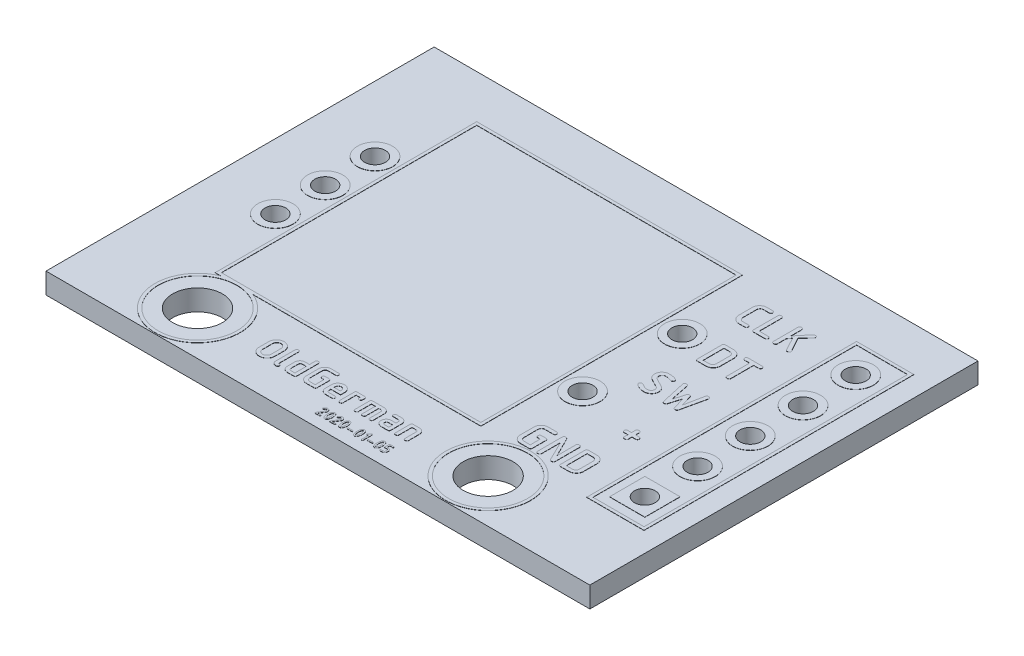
from build123d import *

# Parameters (mm, degrees)
EXTRUDE_1_DEPTH      = 0.5
EXTRUDE_1_DEPTH_BACK = 0.5
SKETCH_1_W           = 26.2
SKETCH_1_H           = 18.7
SKETCH_1_R           = 1.2
SKETCH_1_R_2         = 0.5
SKETCH_2_R           = 0.499436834
CUT_EXTRUDE_1_DEPTH  = 2
SKETCH_6_R           = 0.85
SKETCH_6_R_2         = 0.5
SKETCH_6_R_3         = 0.849436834
SKETCH_6_R_4         = 0.499436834
SKETCH_6_W           = 1.698284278
SKETCH_6_H           = 1.7
EXTRUDE_4_DEPTH      = 0.01
SKETCH_3_R           = 2.05
SKETCH_3_R_2         = 1.9
SKETCH_3_W           = 12.5
SKETCH_3_H           = 12.3
SKETCH_3_W_2         = 2.76
SKETCH_3_H_2         = 13
SKETCH_3_W_3         = 2.46
SKETCH_3_H_3         = 12.7
EXTRUDE_2_DEPTH      = 0.01
EXTRUDE_3_DEPTH      = 0.01
EXTRUDE_5_DEPTH      = 0.01


with BuildPart() as part:
    # Sketch 1 → Extrude 1 (new, two sides: drawn at the far end of the back side and taken through both)
    with BuildSketch(Plane(origin=(0, 0, 0), x_dir=(1, 0, 0), z_dir=(0, 1, 0)).offset(-EXTRUDE_1_DEPTH_BACK)):
        with Locations((13.1, 9.35)):
            Rectangle(SKETCH_1_W, SKETCH_1_H)
        with Locations(Location((19.2, 2.1, 0), (0, 0, 270))):
            Circle(SKETCH_1_R, mode=Mode.SUBTRACT)
        with Locations(Location((5.2, 2.1, 0), (0, 0, 270))):
            Circle(SKETCH_1_R, mode=Mode.SUBTRACT)
        with Locations(Location((23.85, 5, 0), (0, 0, 270))):
            Circle(SKETCH_1_R_2, mode=Mode.SUBTRACT)
        with Locations(Location((23.85, 7.54, 0), (0, 0, 270))):
            Circle(SKETCH_1_R_2, mode=Mode.SUBTRACT)
        with Locations(Location((23.85, 10.08, 0), (0, 0, 270))):
            Circle(SKETCH_1_R_2, mode=Mode.SUBTRACT)
        with Locations(Location((23.85, 12.62, 0), (0, 0, 270))):
            Circle(SKETCH_1_R_2, mode=Mode.SUBTRACT)
        with Locations(Location((23.85, 15.16, 0), (0, 0, 270))):
            Circle(SKETCH_1_R_2, mode=Mode.SUBTRACT)
    extrude(amount=EXTRUDE_1_DEPTH + EXTRUDE_1_DEPTH_BACK)

    # Sketch 2 → Cut-Extrude 1 (cut)
    with BuildSketch(Plane.XZ.offset(0.5)):
        with Locations(Location((3.15, -7.9, 0), (0, 0, 270))):
            Circle(SKETCH_2_R)
        with Locations(Location((17.95, -7.9, 0), (0, 0, 270))):
            Circle(SKETCH_2_R)
        with Locations(Location((17.95, -12.7, 0), (0, 0, 270))):
            Circle(SKETCH_2_R)
        with Locations(Location((3.15, -10.3, 0), (0, 0, 270))):
            Circle(SKETCH_2_R)
        with Locations(Location((3.15, -12.7, 0), (0, 0, 270))):
            Circle(SKETCH_2_R)
    extrude(amount=-CUT_EXTRUDE_1_DEPTH, mode=Mode.SUBTRACT)

    # Sketch 6 → Extrude 4 (add)
    # profile 1 of 10: a face of its own
    with BuildSketch(Plane(origin=(0, 0.5, 0), x_dir=(1, 0, 0), z_dir=(0, 1, 0))):
        with Locations(Location((23.85, 15.16, 0), (0, 0, 90))):
            Circle(SKETCH_6_R)
        with Locations(Location((23.85, 15.16, 0), (0, 0, 270))):
            Circle(SKETCH_6_R_2, mode=Mode.SUBTRACT)
    # profile 2 of 10: a face of its own
    with BuildSketch(Plane(origin=(0, 0.5, 0), x_dir=(1, 0, 0), z_dir=(0, 1, 0))):
        with Locations(Location((23.85, 12.62, 0), (0, 0, 90))):
            Circle(SKETCH_6_R)
        with Locations(Location((23.85, 12.62, 0), (0, 0, 270))):
            Circle(SKETCH_6_R_2, mode=Mode.SUBTRACT)
    # profile 3 of 10: a face of its own
    with BuildSketch(Plane(origin=(0, 0.5, 0), x_dir=(1, 0, 0), z_dir=(0, 1, 0))):
        with Locations(Location((23.85, 10.08, 0), (0, 0, 90))):
            Circle(SKETCH_6_R)
        with Locations(Location((23.85, 10.08, 0), (0, 0, 270))):
            Circle(SKETCH_6_R_2, mode=Mode.SUBTRACT)
    # profile 4 of 10: a face of its own
    with BuildSketch(Plane(origin=(0, 0.5, 0), x_dir=(1, 0, 0), z_dir=(0, 1, 0))):
        with Locations(Location((23.85, 7.54, 0), (0, 0, 90))):
            Circle(SKETCH_6_R)
        with Locations(Location((23.85, 7.54, 0), (0, 0, 270))):
            Circle(SKETCH_6_R_2, mode=Mode.SUBTRACT)
    # profile 5 of 10: a face of its own
    with BuildSketch(Plane(origin=(0, 0.5, 0), x_dir=(1, 0, 0), z_dir=(0, 1, 0))):
        with Locations(Location((3.15, 7.9, 0), (0, 0, 90))):
            Circle(SKETCH_6_R_3)
        with Locations(Location((3.15, 7.9, 0), (0, 0, 90))):
            Circle(SKETCH_6_R_4, mode=Mode.SUBTRACT)
    # profile 6 of 10: a face of its own
    with BuildSketch(Plane(origin=(0, 0.5, 0), x_dir=(1, 0, 0), z_dir=(0, 1, 0))):
        with Locations(Location((17.95, 7.9, 0), (0, 0, 90))):
            Circle(SKETCH_6_R_3)
        with Locations(Location((17.95, 7.9, 0), (0, 0, 90))):
            Circle(SKETCH_6_R_4, mode=Mode.SUBTRACT)
    # profile 7 of 10: a face of its own
    with BuildSketch(Plane(origin=(0, 0.5, 0), x_dir=(1, 0, 0), z_dir=(0, 1, 0))):
        with Locations(Location((17.95, 12.7, 0), (0, 0, 90))):
            Circle(SKETCH_6_R_3)
        with Locations(Location((17.95, 12.7, 0), (0, 0, 90))):
            Circle(SKETCH_6_R_4, mode=Mode.SUBTRACT)
    # profile 8 of 10: a face of its own
    with BuildSketch(Plane(origin=(0, 0.5, 0), x_dir=(1, 0, 0), z_dir=(0, 1, 0))):
        with Locations(Location((3.15, 10.3, 0), (0, 0, 90))):
            Circle(SKETCH_6_R_3)
        with Locations(Location((3.15, 10.3, 0), (0, 0, 90))):
            Circle(SKETCH_6_R_4, mode=Mode.SUBTRACT)
    # profile 9 of 10: a face of its own
    with BuildSketch(Plane(origin=(0, 0.5, 0), x_dir=(1, 0, 0), z_dir=(0, 1, 0))):
        with Locations(Location((3.15, 12.7, 0), (0, 0, 90))):
            Circle(SKETCH_6_R_3)
        with Locations(Location((3.15, 12.7, 0), (0, 0, 90))):
            Circle(SKETCH_6_R_4, mode=Mode.SUBTRACT)
    # profile 10 of 10: a face of its own
    with BuildSketch(Plane(origin=(0, 0.5, 0), x_dir=(1, 0, 0), z_dir=(0, 1, 0))):
        with Locations((23.85, 5)):
            Rectangle(SKETCH_6_W, SKETCH_6_H)
        with Locations(Location((23.85, 5, 0), (0, 0, 270))):
            Circle(SKETCH_6_R_2, mode=Mode.SUBTRACT)
    extrude_4 = extrude(amount=EXTRUDE_4_DEPTH)

    # Mirror 1: Extrude 4 across plane
    add(extrude_4.mirror(Plane.ZX))

    # Sketch 3 → Extrude 2 (add)
    # profile 1 of 3: a face of its own
    with BuildSketch(Plane(origin=(0, 0.5, 0), x_dir=(1, 0, 0), z_dir=(0, 1, 0))):
        with Locations(Location((19.2, 2.1, 0), (0, 0, 90))):
            Circle(SKETCH_3_R)
        with Locations(Location((19.2, 2.1, 0), (0, 0, 90))):
            Circle(SKETCH_3_R_2, mode=Mode.SUBTRACT)
    # profile 2 of 3: a face of its own
    with BuildSketch(Plane(origin=(0, 0.5, 0), x_dir=(1, 0, 0), z_dir=(0, 1, 0))):
        with BuildLine():
            Line((16.95, 16.6), (4.15, 16.6))
            Line((4.15, 16.6), (4.15, 4))
            Line((4.15, 4), (4.430259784, 4))
            ThreePointArc((4.430259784, 4), (5.2, 0.05), (5.969740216, 4))
            Line((5.969740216, 4), (16.95, 4))
            Line((16.95, 4), (16.95, 16.6))
        make_face()
        with Locations(Location((5.2, 2.1, 0), (0, 0, 90))):
            Circle(SKETCH_3_R_2, mode=Mode.SUBTRACT)
        with Locations((10.55, 10.3)):
            Rectangle(SKETCH_3_W, SKETCH_3_H, mode=Mode.SUBTRACT)
    # profile 3 of 3: a face of its own
    with BuildSketch(Plane(origin=(0, 0.5, 0), x_dir=(1, 0, 0), z_dir=(0, 1, 0))):
        with Locations((23.85, 10.08)):
            Rectangle(SKETCH_3_W_2, SKETCH_3_H_2)
        with Locations((23.85, 10.08)):
            Rectangle(SKETCH_3_W_3, SKETCH_3_H_3, mode=Mode.SUBTRACT)
    extrude(amount=EXTRUDE_2_DEPTH)

    # Sketch 4 → Extrude 3 (add)
    # profile 1 of 11: a face of its own
    with BuildSketch(Plane(origin=(0, 0.5, 0), x_dir=(1, 0, 0), z_dir=(0, 1, 0))):
        with BuildLine():
            Line((20.793402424, 15.176723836), (20.65990912, 15.007069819))
            Line((20.65990912, 15.007069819), (20.65990912, 14.57615464))
            add(Edge.make_bspline(
                [(20.65990912, 14.57615464), (20.659726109, 14.569476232), (20.659378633, 14.55679625), (20.653887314, 14.539236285), (20.645942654, 14.523830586), (20.633492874, 14.51195255), (20.618336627, 14.502234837), (20.599607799, 14.496005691), (20.577854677, 14.491529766), (20.562203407, 14.491299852), (20.553837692, 14.491176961)],
                knots=[0, 0, 0, 0, 1.028054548, 1.951919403, 2.820883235, 3.677544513, 4.578137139, 5.585329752, 6.709341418, 8, 8, 8, 8], degree=3))
            add(Edge.make_bspline(
                [(20.553837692, 14.491176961), (20.547081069, 14.491327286), (20.534220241, 14.491613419), (20.516364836, 14.495902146), (20.501012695, 14.502578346), (20.488382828, 14.511974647), (20.478661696, 14.524381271), (20.471732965, 14.539305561), (20.467940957, 14.556988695), (20.467360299, 14.569507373), (20.467051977, 14.57615464)],
                knots=[0, 0, 0, 0, 1.163568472, 2.214783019, 3.14592832, 4.036996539, 4.900661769, 5.839040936, 6.85255686, 8, 8, 8, 8], degree=3))
            Line((20.467051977, 14.57615464), (20.467051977, 15.756199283))
            add(Edge.make_bspline(
                [(20.467051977, 15.756199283), (20.467362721, 15.762844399), (20.46794794, 15.775359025), (20.471709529, 15.793069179), (20.478774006, 15.807974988), (20.488177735, 15.820695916), (20.501134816, 15.829718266), (20.516344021, 15.836477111), (20.534226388, 15.840733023), (20.547083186, 15.84102406), (20.553837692, 15.841176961)],
                knots=[0, 0, 0, 0, 1.146971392, 2.160070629, 3.098064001, 3.975005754, 4.855365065, 5.786127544, 6.836909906, 8, 8, 8, 8], degree=3))
            add(Edge.make_bspline(
                [(20.553837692, 15.841176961), (20.56220103, 15.841050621), (20.57784785, 15.840814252), (20.599630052, 15.83638052), (20.618215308, 15.83003349), (20.633694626, 15.820757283), (20.645836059, 15.808508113), (20.65390823, 15.793140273), (20.659372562, 15.775551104), (20.659724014, 15.762875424), (20.65990912, 15.756199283)],
                knots=[0, 0, 0, 0, 1.290199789, 2.413811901, 3.420646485, 4.312714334, 5.18011951, 6.04877445, 6.972310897, 8, 8, 8, 8], degree=3))
            Line((20.65990912, 15.756199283), (20.65990912, 15.224335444))
            Line((20.65990912, 15.224335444), (21.149886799, 15.812549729))
            add(Edge.make_bspline(
                [(21.149886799, 15.812549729), (21.154323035, 15.817001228), (21.162875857, 15.825583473), (21.17867965, 15.834502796), (21.195798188, 15.840223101), (21.20789775, 15.840854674), (21.214072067, 15.841176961)],
                knots=[0, 0, 0, 0, 1.037265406, 1.999790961, 2.979308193, 4, 4, 4, 4], degree=3))
            add(Edge.make_bspline(
                [(21.214072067, 15.841176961), (21.222229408, 15.841028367), (21.237665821, 15.840747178), (21.259115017, 15.8365146), (21.277369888, 15.829865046), (21.292730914, 15.820867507), (21.304542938, 15.808391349), (21.312651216, 15.793155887), (21.318095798, 15.775546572), (21.31845016, 15.762873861), (21.318636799, 15.756199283)],
                knots=[0, 0, 0, 0, 1.270448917, 2.404113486, 3.39054033, 4.290589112, 5.154891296, 6.031317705, 6.963116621, 8, 8, 8, 8], degree=3))
            add(Edge.make_bspline(
                [(21.318636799, 15.756199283), (21.318230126, 15.751640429), (21.317375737, 15.742062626), (21.311847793, 15.727537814), (21.302530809, 15.712803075), (21.294556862, 15.70336677), (21.290310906, 15.69834214)],
                knots=[0, 0, 0, 0, 0.831966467, 1.747898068, 2.800804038, 4, 4, 4, 4], degree=3))
            Line((21.290310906, 15.69834214), (20.924183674, 15.298163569))
            Line((20.924183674, 15.298163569), (21.304172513, 14.618040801))
            add(Edge.make_bspline(
                [(21.304172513, 14.618040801), (21.308365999, 14.610595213), (21.315757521, 14.597471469), (21.31776726, 14.582592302), (21.318636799, 14.57615464)],
                knots=[0, 0, 0, 0, 1.134674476, 2, 2, 2, 2], degree=3))
            add(Edge.make_bspline(
                [(21.318636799, 14.57615464), (21.318272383, 14.571482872), (21.317519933, 14.561836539), (21.31150802, 14.547611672), (21.302216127, 14.533374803), (21.289865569, 14.519226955), (21.274581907, 14.506495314), (21.256208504, 14.497781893), (21.235911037, 14.492056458), (21.221547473, 14.49147801), (21.214072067, 14.491176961)],
                knots=[0, 0, 0, 0, 0.756511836, 1.562056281, 2.471351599, 3.511475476, 4.601537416, 5.673641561, 6.789264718, 8, 8, 8, 8], degree=3))
            add(Edge.make_bspline(
                [(21.214072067, 14.491176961), (21.205940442, 14.491596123), (21.190380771, 14.492398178), (21.168977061, 14.501439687), (21.150943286, 14.515773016), (21.142705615, 14.528748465), (21.138435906, 14.535473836)],
                knots=[0, 0, 0, 0, 1.051983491, 2.012945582, 2.970079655, 4, 4, 4, 4], degree=3))
            Line((21.138435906, 14.535473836), (20.793402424, 15.176723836))
        make_face()
    # profile 2 of 11: a face of its own
    with BuildSketch(Plane(origin=(0, 0.5, 0), x_dir=(1, 0, 0), z_dir=(0, 1, 0))):
        with BuildLine():
            add(Edge.make_bspline(
                [(19.502766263, 15.756199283), (19.503077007, 15.762844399), (19.503662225, 15.775359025), (19.507423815, 15.793069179), (19.514488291, 15.807974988), (19.523892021, 15.820695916), (19.536849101, 15.829718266), (19.552058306, 15.836477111), (19.569940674, 15.840733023), (19.582797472, 15.84102406), (19.589551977, 15.841176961)],
                knots=[0, 0, 0, 0, 1.146971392, 2.160070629, 3.098064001, 3.975005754, 4.855365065, 5.786127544, 6.836909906, 8, 8, 8, 8], degree=3))
            add(Edge.make_bspline(
                [(19.589551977, 15.841176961), (19.5979152, 15.841050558), (19.613561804, 15.840814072), (19.635345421, 15.836381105), (19.653926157, 15.830031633), (19.669420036, 15.820763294), (19.681447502, 15.808549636), (19.689704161, 15.793387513), (19.69507068, 15.775843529), (19.695432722, 15.763173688), (19.695623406, 15.756500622)],
                knots=[0, 0, 0, 0, 1.292391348, 2.417912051, 3.426456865, 4.320039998, 5.188918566, 6.045460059, 6.970565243, 8, 8, 8, 8], degree=3))
            Line((19.695623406, 15.756500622), (19.695623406, 14.66474839))
            Line((19.695623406, 14.66474839), (20.118101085, 14.66474839))
            add(Edge.make_bspline(
                [(20.118101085, 14.66474839), (20.126262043, 14.664605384), (20.1417053, 14.664334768), (20.163109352, 14.660032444), (20.181608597, 14.65356716), (20.196577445, 14.643755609), (20.208693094, 14.631355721), (20.216659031, 14.615787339), (20.222157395, 14.597816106), (20.222489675, 14.584840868), (20.222665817, 14.577962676)],
                knots=[0, 0, 0, 0, 1.258373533, 2.381262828, 3.358313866, 4.266397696, 5.122484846, 6.004202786, 6.942024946, 8, 8, 8, 8], degree=3))
            add(Edge.make_bspline(
                [(20.222665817, 14.577962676), (20.222459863, 14.571195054), (20.222065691, 14.558242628), (20.216827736, 14.540249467), (20.208477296, 14.524846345), (20.196802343, 14.512089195), (20.181416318, 14.502832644), (20.163245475, 14.495659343), (20.141635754, 14.492117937), (20.126246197, 14.491502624), (20.118101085, 14.491176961)],
                knots=[0, 0, 0, 0, 1.043515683, 1.997165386, 2.866106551, 3.734353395, 4.634922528, 5.618458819, 6.739540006, 8, 8, 8, 8], degree=3))
            Line((20.118101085, 14.491176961), (19.589551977, 14.491176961))
            add(Edge.make_bspline(
                [(19.589551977, 14.491176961), (19.582795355, 14.491327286), (19.569934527, 14.491613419), (19.552079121, 14.495902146), (19.536726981, 14.502578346), (19.524097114, 14.511974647), (19.514375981, 14.524381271), (19.50744725, 14.539305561), (19.503655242, 14.556988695), (19.503074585, 14.569507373), (19.502766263, 14.57615464)],
                knots=[0, 0, 0, 0, 1.163568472, 2.214783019, 3.14592832, 4.036996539, 4.900661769, 5.839040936, 6.85255686, 8, 8, 8, 8], degree=3))
            Line((19.502766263, 14.57615464), (19.502766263, 15.756199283))
        make_face()
    # profile 3 of 11: a face of its own
    with BuildSketch(Plane(origin=(0, 0.5, 0), x_dir=(1, 0, 0), z_dir=(0, 1, 0))):
        with BuildLine():
            add(Edge.make_bspline(
                [(19.15381537, 15.841176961), (19.161976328, 15.841033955), (19.177419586, 15.84076334), (19.198823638, 15.836461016), (19.217322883, 15.829995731), (19.232291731, 15.82018418), (19.24440738, 15.807784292), (19.252373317, 15.79221591), (19.25787168, 15.774244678), (19.25820396, 15.76126944), (19.258380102, 15.754391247)],
                knots=[0, 0, 0, 0, 1.258373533, 2.381262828, 3.358313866, 4.266397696, 5.122484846, 6.004202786, 6.942024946, 8, 8, 8, 8], degree=3))
            add(Edge.make_bspline(
                [(19.258380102, 15.754391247), (19.258174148, 15.747623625), (19.257779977, 15.734671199), (19.252542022, 15.716678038), (19.244191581, 15.701274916), (19.232516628, 15.688517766), (19.217130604, 15.679261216), (19.198959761, 15.672087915), (19.177350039, 15.668546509), (19.161960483, 15.667931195), (19.15381537, 15.667605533)],
                knots=[0, 0, 0, 0, 1.043515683, 1.997165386, 2.866106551, 3.734353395, 4.634922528, 5.618458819, 6.739540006, 8, 8, 8, 8], degree=3))
            Line((19.15381537, 15.667605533), (18.890143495, 15.667605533))
            add(Edge.make_bspline(
                [(18.890143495, 15.667605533), (18.880133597, 15.667029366), (18.860197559, 15.665881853), (18.831212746, 15.656432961), (18.804271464, 15.640414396), (18.779312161, 15.619330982), (18.757713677, 15.593408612), (18.742534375, 15.562623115), (18.732792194, 15.528373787), (18.731833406, 15.504148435), (18.731337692, 15.49162339)],
                knots=[0, 0, 0, 0, 0.911113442, 1.814603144, 2.745921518, 3.75301959, 4.781250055, 5.796804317, 6.860898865, 8, 8, 8, 8], degree=3))
            Line((18.731337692, 15.49162339), (18.731337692, 14.840730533))
            add(Edge.make_bspline(
                [(18.731337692, 14.840730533), (18.731837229, 14.828207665), (18.732803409, 14.803986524), (18.742530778, 14.769576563), (18.75799309, 14.738790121), (18.77950802, 14.712710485), (18.804717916, 14.691854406), (18.831672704, 14.676058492), (18.86048341, 14.666453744), (18.880230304, 14.665318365), (18.890143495, 14.66474839)],
                knots=[0, 0, 0, 0, 1.139595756, 2.204152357, 3.232462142, 4.261139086, 5.262785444, 6.202445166, 7.097604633, 8, 8, 8, 8], degree=3))
            Line((18.890143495, 14.66474839), (19.15381537, 14.66474839))
            add(Edge.make_bspline(
                [(19.15381537, 14.66474839), (19.161976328, 14.664605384), (19.177419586, 14.664334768), (19.198823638, 14.660032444), (19.217322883, 14.65356716), (19.232291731, 14.643755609), (19.24440738, 14.631355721), (19.252373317, 14.615787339), (19.25787168, 14.597816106), (19.25820396, 14.584840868), (19.258380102, 14.577962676)],
                knots=[0, 0, 0, 0, 1.258373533, 2.381262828, 3.358313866, 4.266397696, 5.122484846, 6.004202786, 6.942024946, 8, 8, 8, 8], degree=3))
            add(Edge.make_bspline(
                [(19.258380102, 14.577962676), (19.258174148, 14.571195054), (19.257779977, 14.558242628), (19.252542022, 14.540249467), (19.244191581, 14.524846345), (19.232516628, 14.512089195), (19.217130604, 14.502832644), (19.198959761, 14.495659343), (19.177350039, 14.492117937), (19.161960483, 14.491502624), (19.15381537, 14.491176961)],
                knots=[0, 0, 0, 0, 1.043515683, 1.997165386, 2.866106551, 3.734353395, 4.634922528, 5.618458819, 6.739540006, 8, 8, 8, 8], degree=3))
            Line((19.15381537, 14.491176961), (18.890143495, 14.491176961))
            add(Edge.make_bspline(
                [(18.890143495, 14.491176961), (18.878271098, 14.491421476), (18.854926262, 14.491902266), (18.820559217, 14.497061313), (18.787362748, 14.504642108), (18.755560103, 14.516051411), (18.724918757, 14.530082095), (18.695890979, 14.547950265), (18.667713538, 14.568307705), (18.641546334, 14.592020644), (18.617496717, 14.617786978), (18.596255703, 14.645237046), (18.57842104, 14.674256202), (18.563931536, 14.704607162), (18.552336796, 14.736042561), (18.544205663, 14.768875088), (18.539241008, 14.80311057), (18.538736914, 14.826450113), (18.538480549, 14.838319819)],
                knots=[0, 0, 0, 0, 1.036146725, 2.037387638, 3.029011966, 4.005699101, 4.983016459, 5.967005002, 6.977732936, 8.015215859, 9.045664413, 10.052883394, 11.041437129, 12.014571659, 12.985964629, 13.962612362, 14.963853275, 16, 16, 16, 16], degree=3))
            Line((18.538480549, 14.838319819), (18.538480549, 15.494034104))
            add(Edge.make_bspline(
                [(18.538480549, 15.494034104), (18.538694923, 15.505810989), (18.539118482, 15.529079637), (18.544751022, 15.563188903), (18.552164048, 15.596275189), (18.563920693, 15.627657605), (18.578425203, 15.65796743), (18.59664719, 15.686611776), (18.617434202, 15.7144807), (18.641869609, 15.73992982), (18.667982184, 15.763637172), (18.695956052, 15.784316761), (18.725261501, 15.801798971), (18.755767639, 15.816399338), (18.787590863, 15.827629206), (18.820645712, 15.83534251), (18.854928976, 15.840442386), (18.878272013, 15.840929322), (18.890143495, 15.841176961)],
                knots=[0, 0, 0, 0, 1.027896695, 2.030907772, 3.014489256, 3.986369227, 4.952086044, 5.945759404, 6.948155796, 7.985119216, 9.023122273, 10.027284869, 11.019289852, 12.00083266, 12.97800945, 13.961590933, 14.963333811, 16, 16, 16, 16], degree=3))
            Line((18.890143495, 15.841176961), (19.15381537, 15.841176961))
        make_face()
    # profile 4 of 11: a face of its own
    with BuildSketch(Plane(origin=(0, 0.5, 0), x_dir=(1, 0, 0), z_dir=(0, 1, 0))):
        with BuildLine():
            add(Edge.make_bspline(
                [(20.465545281, 13.189391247), (20.465669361, 13.196255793), (20.465902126, 13.209133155), (20.470419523, 13.227000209), (20.476753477, 13.242443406), (20.486575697, 13.25492826), (20.498764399, 13.264818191), (20.513963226, 13.271432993), (20.531498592, 13.275748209), (20.544165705, 13.276029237), (20.550824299, 13.276176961)],
                knots=[0, 0, 0, 0, 1.177412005, 2.208734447, 3.152945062, 4.02767554, 4.913099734, 5.825774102, 6.857096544, 8, 8, 8, 8], degree=3))
            Line((20.550824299, 13.276176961), (21.21256537, 13.276176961))
            add(Edge.make_bspline(
                [(21.21256537, 13.276176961), (21.220726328, 13.276033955), (21.236169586, 13.27576334), (21.257573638, 13.271461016), (21.276072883, 13.264995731), (21.291041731, 13.25518418), (21.30315738, 13.242784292), (21.311123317, 13.22721591), (21.31662168, 13.209244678), (21.31695396, 13.19626944), (21.317130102, 13.189391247)],
                knots=[0, 0, 0, 0, 1.258373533, 2.381262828, 3.358313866, 4.266397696, 5.122484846, 6.004202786, 6.942024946, 8, 8, 8, 8], degree=3))
            add(Edge.make_bspline(
                [(21.317130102, 13.189391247), (21.316924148, 13.182623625), (21.316529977, 13.169671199), (21.311292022, 13.151678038), (21.302941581, 13.136274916), (21.291266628, 13.123517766), (21.275880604, 13.114261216), (21.257709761, 13.107087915), (21.236100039, 13.103546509), (21.220710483, 13.102931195), (21.21256537, 13.102605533)],
                knots=[0, 0, 0, 0, 1.043515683, 1.997165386, 2.866106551, 3.734353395, 4.634922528, 5.618458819, 6.739540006, 8, 8, 8, 8], degree=3))
            Line((21.21256537, 13.102605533), (20.987766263, 13.102605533))
            Line((20.987766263, 13.102605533), (20.987766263, 12.010853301))
            add(Edge.make_bspline(
                [(20.987766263, 12.010853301), (20.987575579, 12.004180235), (20.987213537, 11.991510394), (20.981847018, 11.97396641), (20.973590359, 11.958804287), (20.961562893, 11.946590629), (20.946069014, 11.937322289), (20.927488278, 11.930972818), (20.905704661, 11.926539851), (20.890058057, 11.926303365), (20.881694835, 11.926176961)],
                knots=[0, 0, 0, 0, 1.029434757, 1.954539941, 2.811081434, 3.679960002, 4.573543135, 5.582087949, 6.707608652, 8, 8, 8, 8], degree=3))
            add(Edge.make_bspline(
                [(20.881694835, 11.926176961), (20.87494041, 11.926329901), (20.862083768, 11.926621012), (20.844200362, 11.930876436), (20.828994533, 11.937636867), (20.816025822, 11.946653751), (20.806720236, 11.959321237), (20.799494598, 11.974048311), (20.795820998, 11.991700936), (20.795225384, 12.004210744), (20.79490912, 12.010853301)],
                knots=[0, 0, 0, 0, 1.165370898, 2.21821383, 3.150801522, 4.032887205, 4.911548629, 5.835693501, 6.850779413, 8, 8, 8, 8], degree=3))
            Line((20.79490912, 12.010853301), (20.79490912, 13.102605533))
            Line((20.79490912, 13.102605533), (20.550824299, 13.102605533))
            add(Edge.make_bspline(
                [(20.550824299, 13.102605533), (20.544183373, 13.102931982), (20.531578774, 13.103551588), (20.513810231, 13.10713836), (20.498970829, 13.114404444), (20.486348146, 13.123812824), (20.476958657, 13.136583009), (20.470266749, 13.151913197), (20.465982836, 13.16977533), (20.465695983, 13.182635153), (20.465545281, 13.189391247)],
                knots=[0, 0, 0, 0, 1.145312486, 2.173824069, 3.094826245, 3.970499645, 4.859913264, 5.789329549, 6.838592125, 8, 8, 8, 8], degree=3))
        make_face()
    # profile 5 of 11: a face of its own
    with BuildSketch(Plane(origin=(0, 0.5, 0), x_dir=(1, 0, 0), z_dir=(0, 1, 0))):
        with BuildLine():
            add(Edge.make_bspline(
                [(19.367766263, 13.191199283), (19.367899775, 13.19786041), (19.368151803, 13.210434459), (19.372614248, 13.227935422), (19.379090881, 13.243065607), (19.388601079, 13.255579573), (19.401206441, 13.264732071), (19.41615077, 13.27147525), (19.433729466, 13.275735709), (19.446390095, 13.27602493), (19.453045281, 13.276176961)],
                knots=[0, 0, 0, 0, 1.155654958, 2.181502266, 3.120276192, 4.004766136, 4.878658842, 5.80151602, 6.844345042, 8, 8, 8, 8], degree=3))
            Line((19.453045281, 13.276176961), (19.848402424, 13.276176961))
            add(Edge.make_bspline(
                [(19.848402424, 13.276176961), (19.861475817, 13.275921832), (19.887113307, 13.275421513), (19.924653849, 13.270480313), (19.960486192, 13.262351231), (19.994502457, 13.250919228), (20.0268267, 13.236311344), (20.05736278, 13.218490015), (20.086147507, 13.197269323), (20.112684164, 13.172924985), (20.136849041, 13.146690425), (20.158212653, 13.119170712), (20.176006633, 13.090305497), (20.191029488, 13.06048968), (20.202098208, 13.029131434), (20.210207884, 12.996751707), (20.215646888, 12.963267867), (20.216106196, 12.940506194), (20.216337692, 12.929034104)],
                knots=[0, 0, 0, 0, 1.113136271, 2.182908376, 3.21864008, 4.238702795, 5.234322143, 6.235148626, 7.244823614, 8.274494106, 9.297852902, 10.28018464, 11.2370332, 12.182180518, 13.118612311, 14.06282967, 15.023648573, 16, 16, 16, 16], degree=3))
            Line((20.216337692, 12.929034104), (20.216337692, 12.273319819))
            add(Edge.make_bspline(
                [(20.216337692, 12.273319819), (20.216108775, 12.261946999), (20.215654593, 12.239382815), (20.210178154, 12.206213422), (20.202198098, 12.174046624), (20.190563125, 12.143070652), (20.175720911, 12.11308739), (20.15754297, 12.084205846), (20.136370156, 12.056181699), (20.111742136, 12.030050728), (20.084995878, 12.005728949), (20.056111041, 11.984620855), (20.025906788, 11.966107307), (19.993420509, 11.951916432), (19.959604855, 11.940246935), (19.924022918, 11.932282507), (19.886841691, 11.926824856), (19.861380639, 11.92639571), (19.848402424, 11.926176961)],
                knots=[0, 0, 0, 0, 0.969451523, 1.923435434, 2.860952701, 3.793874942, 4.740631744, 5.710916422, 6.701728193, 7.732653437, 8.77043206, 9.781826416, 10.781348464, 11.786477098, 12.800156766, 13.829299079, 14.893532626, 16, 16, 16, 16], degree=3))
            Line((19.848402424, 11.926176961), (19.453045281, 11.926176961))
            add(Edge.make_bspline(
                [(19.453045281, 11.926176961), (19.446387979, 11.926326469), (19.433723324, 11.926610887), (19.41617153, 11.930903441), (19.401083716, 11.937567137), (19.388806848, 11.947088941), (19.37898071, 11.959291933), (19.37263812, 11.974439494), (19.368144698, 11.991913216), (19.367897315, 12.00449135), (19.367766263, 12.01115464)],
                knots=[0, 0, 0, 0, 1.156110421, 2.199350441, 3.122571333, 4.00740987, 4.878494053, 5.817637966, 6.843889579, 8, 8, 8, 8], degree=3))
            Line((19.367766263, 12.01115464), (19.367766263, 13.191199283))
        make_face()
        with BuildLine():
            Line((19.560623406, 13.102605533), (19.560623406, 12.09974839))
            Line((19.560623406, 12.09974839), (19.847498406, 12.09974839))
            add(Edge.make_bspline(
                [(19.847498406, 12.09974839), (19.859218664, 12.100382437), (19.882268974, 12.101629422), (19.915345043, 12.111602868), (19.945675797, 12.128024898), (19.972359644, 12.150573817), (19.994944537, 12.177380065), (20.011616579, 12.207735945), (20.021591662, 12.240964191), (20.022843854, 12.264011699), (20.023480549, 12.275730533)],
                knots=[0, 0, 0, 0, 1.016742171, 1.999633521, 2.971814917, 3.994083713, 5.01635251, 6.000366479, 6.983257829, 8, 8, 8, 8], degree=3))
            Line((20.023480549, 12.275730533), (20.023480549, 12.92662339))
            add(Edge.make_bspline(
                [(20.023480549, 12.92662339), (20.022855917, 12.938345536), (20.021632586, 12.961303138), (20.011547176, 12.994395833), (19.994949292, 13.024671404), (19.972364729, 13.051489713), (19.94554642, 13.074074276), (19.915270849, 13.09067216), (19.882178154, 13.10075757), (19.859220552, 13.101980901), (19.847498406, 13.102605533)],
                knots=[0, 0, 0, 0, 1.017364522, 1.992489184, 2.97710547, 4, 5.02289453, 6.007510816, 6.982635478, 8, 8, 8, 8], degree=3))
            Line((19.847498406, 13.102605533), (19.560623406, 13.102605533))
        make_face(mode=Mode.SUBTRACT)
    # profile 6 of 11: a face of its own
    with BuildSketch(Plane(origin=(0, 0.5, 0), x_dir=(1, 0, 0), z_dir=(0, 1, 0))):
        with BuildLine():
            Line((20.924786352, 9.711634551), (21.114328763, 10.64427964))
            add(Edge.make_bspline(
                [(21.114328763, 10.64427964), (21.115668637, 10.649556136), (21.118237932, 10.659674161), (21.124628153, 10.673485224), (21.132959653, 10.68507233), (21.142535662, 10.694920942), (21.154091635, 10.702369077), (21.167350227, 10.707372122), (21.182150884, 10.710881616), (21.192654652, 10.711076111), (21.198101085, 10.711176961)],
                knots=[0, 0, 0, 0, 1.109325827, 2.127204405, 3.082701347, 4.010309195, 4.914290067, 5.86206079, 6.89143191, 8, 8, 8, 8], degree=3))
            add(Edge.make_bspline(
                [(21.198101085, 10.711176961), (21.206258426, 10.711028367), (21.221694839, 10.710747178), (21.243144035, 10.7065146), (21.261398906, 10.699865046), (21.276759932, 10.690867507), (21.288571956, 10.678391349), (21.296680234, 10.663155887), (21.302124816, 10.645546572), (21.302479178, 10.632873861), (21.302665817, 10.626199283)],
                knots=[0, 0, 0, 0, 1.270448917, 2.404113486, 3.39054033, 4.290589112, 5.154891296, 6.031317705, 6.963116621, 8, 8, 8, 8], degree=3))
            add(Edge.make_bspline(
                [(21.302665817, 10.626199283), (21.302307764, 10.623278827), (21.301525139, 10.616895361), (21.300115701, 10.610619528), (21.299351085, 10.607214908)],
                knots=[0, 0, 0, 0, 0.915006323, 2, 2, 2, 2], degree=3))
            Line((21.299351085, 10.607214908), (21.036884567, 9.430786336))
            add(Edge.make_bspline(
                [(21.036884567, 9.430786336), (21.035485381, 9.42529028), (21.032775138, 9.414644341), (21.025352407, 9.400189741), (21.015656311, 9.388060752), (21.003697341, 9.377990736), (20.989554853, 9.37029012), (20.973153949, 9.364744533), (20.954512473, 9.361949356), (20.941367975, 9.361443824), (20.93442921, 9.361176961)],
                knots=[0, 0, 0, 0, 0.999891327, 1.936803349, 2.846230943, 3.72821105, 4.681795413, 5.675520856, 6.772945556, 8, 8, 8, 8], degree=3))
            add(Edge.make_bspline(
                [(20.93442921, 9.361176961), (20.929491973, 9.361437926), (20.920023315, 9.361938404), (20.906307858, 9.364968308), (20.893761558, 9.370417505), (20.882643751, 9.378465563), (20.872372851, 9.388249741), (20.863742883, 9.400517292), (20.856118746, 9.414784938), (20.852330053, 9.425304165), (20.850355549, 9.430786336)],
                knots=[0, 0, 0, 0, 1.006322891, 1.929931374, 2.846481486, 3.772129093, 4.713040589, 5.724347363, 6.814027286, 8, 8, 8, 8], degree=3))
            Line((20.850355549, 9.430786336), (20.680098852, 10.006947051))
            Line((20.680098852, 10.006947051), (20.510444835, 9.430786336))
            add(Edge.make_bspline(
                [(20.510444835, 9.430786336), (20.508406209, 9.425283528), (20.504454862, 9.414617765), (20.495842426, 9.400296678), (20.48561514, 9.387982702), (20.473147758, 9.378251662), (20.459315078, 9.370320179), (20.443502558, 9.364781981), (20.425968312, 9.361988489), (20.413723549, 9.361453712), (20.407386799, 9.361176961)],
                knots=[0, 0, 0, 0, 1.046742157, 2.028837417, 2.971247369, 3.890811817, 4.839356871, 5.810231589, 6.866779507, 8, 8, 8, 8], degree=3))
            add(Edge.make_bspline(
                [(20.407386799, 9.361176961), (20.402040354, 9.361405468), (20.391740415, 9.361845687), (20.377120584, 9.365293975), (20.363719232, 9.370488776), (20.352640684, 9.379153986), (20.342245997, 9.388916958), (20.334672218, 9.401847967), (20.327711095, 9.416338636), (20.325023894, 9.427199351), (20.323614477, 9.432895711)],
                knots=[0, 0, 0, 0, 1.060165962, 2.042412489, 2.972223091, 3.885846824, 4.816726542, 5.785103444, 6.838303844, 8, 8, 8, 8], degree=3))
            Line((20.323614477, 9.432895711), (20.06114796, 10.606913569))
            add(Edge.make_bspline(
                [(20.06114796, 10.606913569), (20.060447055, 10.610417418), (20.059172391, 10.616789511), (20.058872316, 10.623278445), (20.058737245, 10.626199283)],
                knots=[0, 0, 0, 0, 1.099748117, 2, 2, 2, 2], degree=3))
            add(Edge.make_bspline(
                [(20.058737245, 10.626199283), (20.058870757, 10.63286041), (20.059122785, 10.645434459), (20.06358523, 10.662935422), (20.070061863, 10.678065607), (20.079572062, 10.690579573), (20.092177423, 10.699732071), (20.107121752, 10.70647525), (20.124700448, 10.710735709), (20.137361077, 10.71102493), (20.144016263, 10.711176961)],
                knots=[0, 0, 0, 0, 1.155654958, 2.181502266, 3.120276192, 4.004766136, 4.878658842, 5.80151602, 6.844345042, 8, 8, 8, 8], degree=3))
            add(Edge.make_bspline(
                [(20.144016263, 10.711176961), (20.150864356, 10.711080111), (20.163948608, 10.710895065), (20.18235538, 10.707432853), (20.198674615, 10.70242048), (20.212907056, 10.695152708), (20.224731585, 10.685408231), (20.234324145, 10.673619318), (20.24171713, 10.659802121), (20.244651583, 10.64957341), (20.246170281, 10.64427964)],
                knots=[0, 0, 0, 0, 1.229764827, 2.34963995, 3.355254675, 4.292662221, 5.204116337, 6.0901464, 7.011573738, 8, 8, 8, 8], degree=3))
            Line((20.246170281, 10.64427964), (20.435110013, 9.709826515))
            Line((20.435110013, 9.709826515), (20.587889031, 10.252237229))
            add(Edge.make_bspline(
                [(20.587889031, 10.252237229), (20.589896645, 10.2576005), (20.593731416, 10.267844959), (20.600888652, 10.282034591), (20.609749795, 10.29374725), (20.619464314, 10.303810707), (20.630752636, 10.311242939), (20.643075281, 10.316998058), (20.656774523, 10.319803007), (20.666228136, 10.320357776), (20.671058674, 10.320641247)],
                knots=[0, 0, 0, 0, 1.182968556, 2.259604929, 3.268094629, 4.20716145, 5.133765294, 6.043959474, 7.000516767, 8, 8, 8, 8], degree=3))
            add(Edge.make_bspline(
                [(20.671058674, 10.320641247), (20.677393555, 10.320366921), (20.689535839, 10.31984111), (20.706997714, 10.317047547), (20.722483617, 10.311340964), (20.736680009, 10.304385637), (20.748548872, 10.294280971), (20.758982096, 10.282567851), (20.767152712, 10.268310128), (20.77114408, 10.257922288), (20.773212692, 10.252538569)],
                knots=[0, 0, 0, 0, 1.148084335, 2.200572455, 3.184181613, 4.127801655, 5.045296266, 5.986283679, 6.956348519, 8, 8, 8, 8], degree=3))
            Line((20.773212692, 10.252538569), (20.924786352, 9.711634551))
        make_face()
    # profile 7 of 11: a face of its own
    with BuildSketch(Plane(origin=(0, 0.5, 0), x_dir=(1, 0, 0), z_dir=(0, 1, 0))):
        with BuildLine():
            add(Edge.make_bspline(
                [(19.811337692, 9.707114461), (19.811114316, 9.695841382), (19.810673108, 9.673574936), (19.805154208, 9.640809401), (19.797127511, 9.608970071), (19.785628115, 9.57798939), (19.770422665, 9.548229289), (19.752200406, 9.519354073), (19.730738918, 9.49158412), (19.706169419, 9.465319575), (19.679241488, 9.441007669), (19.650404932, 9.419491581), (19.619638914, 9.401706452), (19.58762902, 9.386799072), (19.553899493, 9.375232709), (19.518518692, 9.367313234), (19.481542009, 9.361820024), (19.456280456, 9.361394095), (19.443402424, 9.361176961)],
                knots=[0, 0, 0, 0, 0.963685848, 1.903460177, 2.835378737, 3.771016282, 4.724372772, 5.69020304, 6.689126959, 7.723052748, 8.763851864, 9.790210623, 10.79565931, 11.799453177, 12.807946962, 13.840084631, 14.898901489, 16, 16, 16, 16], degree=3))
            add(Edge.make_bspline(
                [(19.443402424, 9.361176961), (19.422792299, 9.361656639), (19.382057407, 9.362604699), (19.321865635, 9.36965207), (19.263409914, 9.381442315), (19.206687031, 9.397922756), (19.151877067, 9.419627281), (19.098715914, 9.445430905), (19.047483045, 9.476358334), (19.015221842, 9.500137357), (18.998926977, 9.512147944)],
                knots=[0, 0, 0, 0, 1.033903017, 2.043458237, 3.03575917, 4.022915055, 5.002749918, 5.989944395, 6.984737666, 8, 8, 8, 8], degree=3))
            add(Edge.make_bspline(
                [(18.998926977, 9.512147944), (18.993478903, 9.51685366), (18.982933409, 9.525962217), (18.971210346, 9.542832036), (18.964200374, 9.561651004), (18.963250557, 9.574767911), (18.962766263, 9.581455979)],
                knots=[0, 0, 0, 0, 1.063672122, 2.058882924, 3.010260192, 4, 4, 4, 4], degree=3))
            add(Edge.make_bspline(
                [(18.962766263, 9.581455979), (18.963018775, 9.587117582), (18.963515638, 9.598257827), (18.968562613, 9.614175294), (18.976704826, 9.628696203), (18.987441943, 9.641837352), (19.000416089, 9.652808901), (19.015032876, 9.660927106), (19.03093994, 9.665988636), (19.042081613, 9.666483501), (19.047743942, 9.666734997)],
                knots=[0, 0, 0, 0, 1.015260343, 1.997711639, 2.967636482, 3.994235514, 5.032363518, 6.002288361, 6.984739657, 8, 8, 8, 8], degree=3))
            add(Edge.make_bspline(
                [(19.047743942, 9.666734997), (19.057541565, 9.66612735), (19.077381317, 9.66489689), (19.095317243, 9.656313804), (19.104395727, 9.651969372)],
                knots=[0, 0, 0, 0, 0.987675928, 2, 2, 2, 2], degree=3))
            add(Edge.make_bspline(
                [(19.104395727, 9.651969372), (19.116304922, 9.645060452), (19.14197372, 9.630169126), (19.184408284, 9.607892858), (19.233493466, 9.583999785), (19.268503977, 9.567549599), (19.287007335, 9.558855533)],
                knots=[0, 0, 0, 0, 0.805612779, 1.736398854, 2.803667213, 4, 4, 4, 4], degree=3))
            add(Edge.make_bspline(
                [(19.287007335, 9.558855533), (19.298798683, 9.555106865), (19.322802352, 9.547475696), (19.360601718, 9.540250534), (19.400191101, 9.535556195), (19.427216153, 9.53502113), (19.44099171, 9.53474839)],
                knots=[0, 0, 0, 0, 0.947683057, 1.929200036, 2.944445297, 4, 4, 4, 4], degree=3))
            add(Edge.make_bspline(
                [(19.44099171, 9.53474839), (19.45291643, 9.535363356), (19.47617517, 9.536562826), (19.509642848, 9.546692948), (19.540218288, 9.563169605), (19.567029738, 9.5859787), (19.590073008, 9.61261949), (19.606524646, 9.64329328), (19.616639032, 9.676653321), (19.617858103, 9.699810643), (19.618480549, 9.711634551)],
                knots=[0, 0, 0, 0, 1.026566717, 2.002281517, 2.986723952, 4.001528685, 5.021900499, 6.006342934, 6.982057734, 8, 8, 8, 8], degree=3))
            add(Edge.make_bspline(
                [(19.618480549, 9.711634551), (19.618238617, 9.720300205), (19.617764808, 9.737271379), (19.612689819, 9.761640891), (19.605307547, 9.784414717), (19.594174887, 9.805209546), (19.58001035, 9.824167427), (19.562697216, 9.841322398), (19.542544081, 9.856829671), (19.527207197, 9.865029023), (19.519339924, 9.869234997)],
                knots=[0, 0, 0, 0, 1.053049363, 2.062335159, 3.017147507, 3.957689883, 4.918508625, 5.886609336, 6.915906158, 8, 8, 8, 8], degree=3))
            Line((19.519339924, 9.869234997), (19.150801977, 10.05787339))
            add(Edge.make_bspline(
                [(19.150801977, 10.05787339), (19.135918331, 10.066159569), (19.106997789, 10.082260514), (19.068225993, 10.1117147), (19.03564791, 10.145220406), (19.008821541, 10.182221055), (18.988113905, 10.222923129), (18.973227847, 10.26714763), (18.964472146, 10.315073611), (18.96334475, 10.348227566), (18.962766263, 10.365239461)],
                knots=[0, 0, 0, 0, 1.071171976, 2.081403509, 3.051497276, 4.00243169, 4.946724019, 5.914280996, 6.929779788, 8, 8, 8, 8], degree=3))
            add(Edge.make_bspline(
                [(18.962766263, 10.365239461), (18.963026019, 10.376908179), (18.963538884, 10.399947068), (18.968513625, 10.433879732), (18.97663652, 10.466471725), (18.987899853, 10.497742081), (19.002093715, 10.527797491), (19.01971576, 10.556551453), (19.040564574, 10.583954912), (19.064294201, 10.609759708), (19.090269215, 10.6332848), (19.117673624, 10.654262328), (19.146601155, 10.671829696), (19.176665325, 10.686501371), (19.208369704, 10.697143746), (19.240952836, 10.705469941), (19.275003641, 10.710408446), (19.298140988, 10.710917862), (19.30990912, 10.711176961)],
                knots=[0, 0, 0, 0, 1.027810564, 2.029324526, 3.014787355, 3.983609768, 4.953725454, 5.939029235, 6.949966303, 7.983706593, 9.023983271, 10.034920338, 11.02022412, 12.002142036, 12.97636857, 13.9618314, 14.963345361, 16, 16, 16, 16], degree=3))
            add(Edge.make_bspline(
                [(19.30990912, 10.711176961), (19.329802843, 10.710957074), (19.368419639, 10.710530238), (19.424542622, 10.706915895), (19.47701977, 10.700851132), (19.525907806, 10.693006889), (19.570945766, 10.6822063), (19.612119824, 10.668724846), (19.650114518, 10.653907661), (19.673051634, 10.640929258), (19.684172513, 10.634636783)],
                knots=[0, 0, 0, 0, 1.235727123, 2.398737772, 3.491606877, 4.516393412, 5.472871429, 6.364787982, 7.207180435, 8, 8, 8, 8], degree=3))
            add(Edge.make_bspline(
                [(19.684172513, 10.634636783), (19.692882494, 10.629049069), (19.708974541, 10.618725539), (19.727549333, 10.599467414), (19.739843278, 10.578839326), (19.741314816, 10.56406721), (19.742029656, 10.556891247)],
                knots=[0, 0, 0, 0, 1.222565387, 2.258739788, 3.154134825, 4, 4, 4, 4], degree=3))
            add(Edge.make_bspline(
                [(19.742029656, 10.556891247), (19.741639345, 10.55203068), (19.740838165, 10.542053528), (19.735413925, 10.527297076), (19.726282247, 10.512959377), (19.714274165, 10.499135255), (19.699205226, 10.486852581), (19.680992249, 10.478006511), (19.660136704, 10.472921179), (19.645428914, 10.47225871), (19.637766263, 10.471913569)],
                knots=[0, 0, 0, 0, 0.784975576, 1.611297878, 2.507483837, 3.519582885, 4.558641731, 5.625460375, 6.762882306, 8, 8, 8, 8], degree=3))
            add(Edge.make_bspline(
                [(19.637766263, 10.471913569), (19.632500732, 10.472425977), (19.620506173, 10.473593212), (19.609170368, 10.477729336), (19.602810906, 10.480049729)],
                knots=[0, 0, 0, 0, 0.877986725, 2, 2, 2, 2], degree=3))
            add(Edge.make_bspline(
                [(19.602810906, 10.480049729), (19.57866223, 10.489003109), (19.531031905, 10.50666256), (19.457770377, 10.523891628), (19.385015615, 10.535545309), (19.336471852, 10.536921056), (19.312319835, 10.537605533)],
                knots=[0, 0, 0, 0, 1.036852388, 2.045065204, 3.027359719, 4, 4, 4, 4], degree=3))
            add(Edge.make_bspline(
                [(19.312319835, 10.537605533), (19.302592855, 10.537070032), (19.283177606, 10.536001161), (19.255048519, 10.525803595), (19.228256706, 10.51026134), (19.203608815, 10.488896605), (19.181889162, 10.46307524), (19.166899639, 10.432077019), (19.157035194, 10.397682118), (19.156105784, 10.37334875), (19.155623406, 10.360719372)],
                knots=[0, 0, 0, 0, 0.888252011, 1.772969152, 2.708992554, 3.71416756, 4.747592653, 5.776500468, 6.84597083, 8, 8, 8, 8], degree=3))
            add(Edge.make_bspline(
                [(19.155623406, 10.360719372), (19.155780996, 10.351657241), (19.156087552, 10.334028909), (19.16055626, 10.308803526), (19.16685167, 10.285502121), (19.176900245, 10.264816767), (19.188777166, 10.245869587), (19.203907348, 10.229439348), (19.221521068, 10.215010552), (19.234945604, 10.207539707), (19.241806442, 10.203721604)],
                knots=[0, 0, 0, 0, 1.145974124, 2.229234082, 3.235681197, 4.191666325, 5.130228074, 6.057777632, 7.007394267, 8, 8, 8, 8], degree=3))
            Line((19.241806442, 10.203721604), (19.610344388, 10.015384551))
            add(Edge.make_bspline(
                [(19.610344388, 10.015384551), (19.626226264, 10.006590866), (19.657005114, 9.989548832), (19.698354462, 9.959031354), (19.733187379, 9.924894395), (19.761810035, 9.887616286), (19.784226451, 9.847014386), (19.799744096, 9.803120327), (19.809910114, 9.756194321), (19.810854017, 9.723743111), (19.811337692, 9.707114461)],
                knots=[0, 0, 0, 0, 1.118248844, 2.167150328, 3.156675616, 4.115204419, 5.054603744, 6.002575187, 6.976479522, 8, 8, 8, 8], degree=3))
        make_face()
    # profile 8 of 11: a face of its own
    with BuildSketch(Plane(origin=(0, 0.5, 0), x_dir=(1, 0, 0), z_dir=(0, 1, 0))):
        with BuildLine():
            Line((20.852766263, 7.181891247), (20.674373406, 7.181891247))
            add(Edge.make_bspline(
                [(20.674373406, 7.181891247), (20.66773248, 7.182217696), (20.655127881, 7.182837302), (20.637359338, 7.186424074), (20.622519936, 7.193690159), (20.609897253, 7.203098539), (20.600507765, 7.215868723), (20.593815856, 7.231198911), (20.589531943, 7.249061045), (20.58924509, 7.261920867), (20.589094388, 7.268676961)],
                knots=[0, 0, 0, 0, 1.145312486, 2.173824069, 3.094826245, 3.970499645, 4.859913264, 5.789329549, 6.838592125, 8, 8, 8, 8], degree=3))
            add(Edge.make_bspline(
                [(20.589094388, 7.268676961), (20.589218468, 7.275541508), (20.589451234, 7.288418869), (20.59396863, 7.306285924), (20.600302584, 7.32172912), (20.610124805, 7.334213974), (20.622313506, 7.344103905), (20.637512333, 7.350718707), (20.655047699, 7.355033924), (20.667714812, 7.355314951), (20.674373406, 7.355462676)],
                knots=[0, 0, 0, 0, 1.177412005, 2.208734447, 3.152945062, 4.02767554, 4.913099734, 5.825774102, 6.857096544, 8, 8, 8, 8], degree=3))
            Line((20.674373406, 7.355462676), (20.852766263, 7.355462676))
            Line((20.852766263, 7.355462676), (20.852766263, 7.538676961))
            add(Edge.make_bspline(
                [(20.852766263, 7.538676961), (20.853068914, 7.54552545), (20.8536354, 7.55834411), (20.857448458, 7.576417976), (20.864371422, 7.591640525), (20.87408379, 7.604328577), (20.886629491, 7.614095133), (20.902091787, 7.620719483), (20.919930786, 7.625031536), (20.932794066, 7.625314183), (20.939551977, 7.625462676)],
                knots=[0, 0, 0, 0, 1.168665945, 2.187450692, 3.13077332, 3.998165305, 4.889609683, 5.810236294, 6.849575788, 8, 8, 8, 8], degree=3))
            add(Edge.make_bspline(
                [(20.939551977, 7.625462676), (20.947919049, 7.625342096), (20.963572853, 7.625116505), (20.985309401, 7.620612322), (21.004143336, 7.614456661), (21.019224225, 7.604356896), (21.031672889, 7.592187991), (21.039601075, 7.576485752), (21.045119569, 7.558535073), (21.045448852, 7.545556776), (21.045623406, 7.538676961)],
                knots=[0, 0, 0, 0, 1.278044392, 2.391070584, 3.388419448, 4.288526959, 5.147760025, 6.021733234, 6.951317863, 8, 8, 8, 8], degree=3))
            Line((21.045623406, 7.538676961), (21.045623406, 7.355462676))
            Line((21.045623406, 7.355462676), (21.204730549, 7.355462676))
            add(Edge.make_bspline(
                [(21.204730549, 7.355462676), (21.212891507, 7.35531967), (21.228334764, 7.355049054), (21.249738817, 7.35074673), (21.268238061, 7.344281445), (21.283206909, 7.334469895), (21.295322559, 7.322070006), (21.303288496, 7.306501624), (21.308786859, 7.288530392), (21.309119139, 7.275555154), (21.309295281, 7.268676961)],
                knots=[0, 0, 0, 0, 1.258373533, 2.381262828, 3.358313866, 4.266397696, 5.122484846, 6.004202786, 6.942024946, 8, 8, 8, 8], degree=3))
            add(Edge.make_bspline(
                [(21.309295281, 7.268676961), (21.309089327, 7.26190934), (21.308695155, 7.248956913), (21.3034572, 7.230963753), (21.29510676, 7.215560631), (21.283431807, 7.202803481), (21.268045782, 7.19354693), (21.249874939, 7.186373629), (21.228265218, 7.182832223), (21.212875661, 7.182216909), (21.204730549, 7.181891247)],
                knots=[0, 0, 0, 0, 1.043515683, 1.997165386, 2.866106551, 3.734353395, 4.634922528, 5.618458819, 6.739540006, 8, 8, 8, 8], degree=3))
            Line((21.204730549, 7.181891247), (21.045623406, 7.181891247))
            Line((21.045623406, 7.181891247), (21.045623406, 7.013141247))
            add(Edge.make_bspline(
                [(21.045623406, 7.013141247), (21.045440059, 7.006663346), (21.045092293, 6.994376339), (21.039615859, 6.977389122), (21.031543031, 6.962561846), (21.019191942, 6.951030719), (21.004012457, 6.941639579), (20.98529954, 6.935698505), (20.963535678, 6.931619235), (20.947912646, 6.931331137), (20.939551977, 6.931176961)],
                knots=[0, 0, 0, 0, 1.011618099, 1.918794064, 2.772957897, 3.631037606, 4.53643251, 5.553070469, 6.690525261, 8, 8, 8, 8], degree=3))
            add(Edge.make_bspline(
                [(20.939551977, 6.931176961), (20.932800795, 6.931356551), (20.919972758, 6.931697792), (20.902109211, 6.935594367), (20.886758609, 6.941970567), (20.874112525, 6.951048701), (20.864465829, 6.963099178), (20.857432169, 6.977464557), (20.85365487, 6.994574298), (20.853074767, 7.006695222), (20.852766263, 7.013141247)],
                knots=[0, 0, 0, 0, 1.183433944, 2.248663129, 3.188621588, 4.084379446, 4.949056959, 5.871656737, 6.868126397, 8, 8, 8, 8], degree=3))
            Line((20.852766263, 7.013141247), (20.852766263, 7.181891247))
        make_face()
    # profile 9 of 11: a face of its own
    with BuildSketch(Plane(origin=(0, 0.5, 0), x_dir=(1, 0, 0), z_dir=(0, 1, 0))):
        with BuildLine():
            add(Edge.make_bspline(
                [(20.467051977, 5.496199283), (20.467185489, 5.50286041), (20.467437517, 5.515434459), (20.471899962, 5.532935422), (20.478376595, 5.548065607), (20.487886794, 5.560579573), (20.500492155, 5.569732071), (20.515436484, 5.57647525), (20.53301518, 5.580735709), (20.545675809, 5.58102493), (20.552330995, 5.581176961)],
                knots=[0, 0, 0, 0, 1.155654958, 2.181502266, 3.120276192, 4.004766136, 4.878658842, 5.80151602, 6.844345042, 8, 8, 8, 8], degree=3))
            Line((20.552330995, 5.581176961), (20.947688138, 5.581176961))
            add(Edge.make_bspline(
                [(20.947688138, 5.581176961), (20.960761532, 5.580921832), (20.986399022, 5.580421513), (21.023939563, 5.575480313), (21.059771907, 5.567351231), (21.093788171, 5.555919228), (21.126112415, 5.541311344), (21.156648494, 5.523490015), (21.185433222, 5.502269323), (21.211969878, 5.477924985), (21.236134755, 5.451690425), (21.257498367, 5.424170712), (21.275292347, 5.395305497), (21.290315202, 5.36548968), (21.301383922, 5.334131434), (21.309493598, 5.301751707), (21.314932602, 5.268267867), (21.31539191, 5.245506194), (21.315623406, 5.234034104)],
                knots=[0, 0, 0, 0, 1.113136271, 2.182908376, 3.21864008, 4.238702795, 5.234322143, 6.235148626, 7.244823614, 8.274494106, 9.297852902, 10.28018464, 11.2370332, 12.182180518, 13.118612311, 14.06282967, 15.023648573, 16, 16, 16, 16], degree=3))
            Line((21.315623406, 5.234034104), (21.315623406, 4.578319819))
            add(Edge.make_bspline(
                [(21.315623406, 4.578319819), (21.315394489, 4.566946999), (21.314940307, 4.544382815), (21.309463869, 4.511213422), (21.301483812, 4.479046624), (21.289848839, 4.448070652), (21.275006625, 4.41808739), (21.256828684, 4.389205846), (21.23565587, 4.361181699), (21.21102785, 4.335050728), (21.184281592, 4.310728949), (21.155396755, 4.289620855), (21.125192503, 4.271107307), (21.092706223, 4.256916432), (21.05889057, 4.245246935), (21.023308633, 4.237282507), (20.986127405, 4.231824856), (20.960666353, 4.23139571), (20.947688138, 4.231176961)],
                knots=[0, 0, 0, 0, 0.969451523, 1.923435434, 2.860952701, 3.793874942, 4.740631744, 5.710916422, 6.701728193, 7.732653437, 8.77043206, 9.781826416, 10.781348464, 11.786477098, 12.800156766, 13.829299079, 14.893532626, 16, 16, 16, 16], degree=3))
            Line((20.947688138, 4.231176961), (20.552330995, 4.231176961))
            add(Edge.make_bspline(
                [(20.552330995, 4.231176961), (20.545673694, 4.231326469), (20.533009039, 4.231610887), (20.515457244, 4.235903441), (20.50036943, 4.242567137), (20.488092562, 4.252088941), (20.478266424, 4.264291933), (20.471923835, 4.279439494), (20.467430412, 4.296913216), (20.467183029, 4.30949135), (20.467051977, 4.31615464)],
                knots=[0, 0, 0, 0, 1.156110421, 2.199350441, 3.122571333, 4.00740987, 4.878494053, 5.817637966, 6.843889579, 8, 8, 8, 8], degree=3))
            Line((20.467051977, 4.31615464), (20.467051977, 5.496199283))
        make_face()
        with BuildLine():
            Line((20.65990912, 5.407605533), (20.65990912, 4.40474839))
            Line((20.65990912, 4.40474839), (20.94678412, 4.40474839))
            add(Edge.make_bspline(
                [(20.94678412, 4.40474839), (20.958504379, 4.405382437), (20.981554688, 4.406629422), (21.014630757, 4.416602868), (21.044961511, 4.433024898), (21.071645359, 4.455573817), (21.094230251, 4.482380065), (21.110902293, 4.512735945), (21.120877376, 4.545964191), (21.122129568, 4.569011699), (21.122766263, 4.580730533)],
                knots=[0, 0, 0, 0, 1.016742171, 1.999633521, 2.971814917, 3.994083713, 5.01635251, 6.000366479, 6.983257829, 8, 8, 8, 8], degree=3))
            Line((21.122766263, 4.580730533), (21.122766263, 5.23162339))
            add(Edge.make_bspline(
                [(21.122766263, 5.23162339), (21.122141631, 5.243345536), (21.120918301, 5.266303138), (21.11083289, 5.299395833), (21.094235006, 5.329671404), (21.071650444, 5.356489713), (21.044832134, 5.379074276), (21.014556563, 5.39567216), (20.981463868, 5.40575757), (20.958506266, 5.406980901), (20.94678412, 5.407605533)],
                knots=[0, 0, 0, 0, 1.017364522, 1.992489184, 2.97710547, 4, 5.02289453, 6.007510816, 6.982635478, 8, 8, 8, 8], degree=3))
            Line((20.94678412, 5.407605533), (20.65990912, 5.407605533))
        make_face(mode=Mode.SUBTRACT)
    # profile 10 of 11: a face of its own
    with BuildSketch(Plane(origin=(0, 0.5, 0), x_dir=(1, 0, 0), z_dir=(0, 1, 0))):
        with BuildLine():
            Line((20.023480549, 4.588565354), (20.023480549, 5.496199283))
            add(Edge.make_bspline(
                [(20.023480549, 5.496199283), (20.023791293, 5.502844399), (20.024376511, 5.515359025), (20.028138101, 5.533069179), (20.035202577, 5.547974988), (20.044606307, 5.560695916), (20.057563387, 5.569718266), (20.072772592, 5.576477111), (20.090654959, 5.580733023), (20.103511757, 5.58102406), (20.110266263, 5.581176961)],
                knots=[0, 0, 0, 0, 1.146971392, 2.160070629, 3.098064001, 3.975005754, 4.855365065, 5.786127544, 6.836909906, 8, 8, 8, 8], degree=3))
            add(Edge.make_bspline(
                [(20.110266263, 5.581176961), (20.118629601, 5.581050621), (20.134276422, 5.580814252), (20.156058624, 5.57638052), (20.17464388, 5.57003349), (20.190123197, 5.560757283), (20.202264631, 5.548508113), (20.210336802, 5.533140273), (20.215801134, 5.515551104), (20.216152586, 5.502875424), (20.216337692, 5.496199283)],
                knots=[0, 0, 0, 0, 1.290199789, 2.413811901, 3.420646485, 4.312714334, 5.18011951, 6.04877445, 6.972310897, 8, 8, 8, 8], degree=3))
            Line((20.216337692, 5.496199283), (20.216337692, 4.31615464))
            add(Edge.make_bspline(
                [(20.216337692, 4.31615464), (20.216019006, 4.309482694), (20.215414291, 4.296822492), (20.210093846, 4.279145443), (20.201711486, 4.263828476), (20.188924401, 4.251748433), (20.172955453, 4.242343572), (20.153537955, 4.235942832), (20.130952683, 4.231551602), (20.114710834, 4.231307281), (20.106047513, 4.231176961)],
                knots=[0, 0, 0, 0, 1.006543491, 1.909943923, 2.767092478, 3.615585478, 4.535057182, 5.548566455, 6.692417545, 8, 8, 8, 8], degree=3))
            add(Edge.make_bspline(
                [(20.106047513, 4.231176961), (20.097413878, 4.231693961), (20.080725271, 4.232693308), (20.057517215, 4.242299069), (20.037656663, 4.257903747), (20.028331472, 4.272038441), (20.023480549, 4.279391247)],
                knots=[0, 0, 0, 0, 1.027855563, 1.986819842, 2.952752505, 4, 4, 4, 4], degree=3))
            Line((20.023480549, 4.279391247), (19.560623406, 5.224692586))
            Line((19.560623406, 5.224692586), (19.560623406, 4.31615464))
            add(Edge.make_bspline(
                [(19.560623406, 4.31615464), (19.560440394, 4.309476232), (19.560092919, 4.29679625), (19.5546016, 4.279236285), (19.54665694, 4.263830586), (19.534207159, 4.25195255), (19.519050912, 4.242234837), (19.500322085, 4.236005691), (19.478568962, 4.231529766), (19.462917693, 4.231299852), (19.454551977, 4.231176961)],
                knots=[0, 0, 0, 0, 1.028054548, 1.951919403, 2.820883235, 3.677544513, 4.578137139, 5.585329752, 6.709341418, 8, 8, 8, 8], degree=3))
            add(Edge.make_bspline(
                [(19.454551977, 4.231176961), (19.447795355, 4.231327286), (19.434934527, 4.231613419), (19.417079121, 4.235902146), (19.401726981, 4.242578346), (19.389097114, 4.251974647), (19.379375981, 4.264381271), (19.37244725, 4.279305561), (19.368655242, 4.296988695), (19.368074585, 4.309507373), (19.367766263, 4.31615464)],
                knots=[0, 0, 0, 0, 1.163568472, 2.214783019, 3.14592832, 4.036996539, 4.900661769, 5.839040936, 6.85255686, 8, 8, 8, 8], degree=3))
            Line((19.367766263, 4.31615464), (19.367766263, 5.496199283))
            add(Edge.make_bspline(
                [(19.367766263, 5.496199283), (19.368036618, 5.502854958), (19.368546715, 5.515412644), (19.372827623, 5.533012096), (19.379732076, 5.548082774), (19.389545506, 5.560697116), (19.402825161, 5.569808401), (19.41850906, 5.576401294), (19.43694238, 5.580791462), (19.450204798, 5.581043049), (19.457264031, 5.581176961)],
                knots=[0, 0, 0, 0, 1.128735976, 2.12965825, 3.052738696, 3.926288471, 4.806471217, 5.753652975, 6.804329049, 8, 8, 8, 8], degree=3))
            add(Edge.make_bspline(
                [(19.457264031, 5.581176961), (19.468024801, 5.580571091), (19.488881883, 5.579396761), (19.517969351, 5.567614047), (19.542799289, 5.548287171), (19.554543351, 5.53084379), (19.560623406, 5.521813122)],
                knots=[0, 0, 0, 0, 1.028232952, 1.992974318, 2.960936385, 4, 4, 4, 4], degree=3))
            Line((19.560623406, 5.521813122), (20.023480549, 4.588565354))
        make_face()
    # profile 11 of 11: a face of its own
    with BuildSketch(Plane(origin=(0, 0.5, 0), x_dir=(1, 0, 0), z_dir=(0, 1, 0))):
        with BuildLine():
            Line((18.61803412, 4.40474839), (18.924194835, 4.40474839))
            Line((18.924194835, 4.40474839), (18.924194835, 4.886891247))
            Line((18.924194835, 4.886891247), (18.811493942, 4.886891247))
            add(Edge.make_bspline(
                [(18.811493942, 4.886891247), (18.804846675, 4.887199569), (18.792327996, 4.887780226), (18.774644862, 4.891572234), (18.759720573, 4.898500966), (18.747313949, 4.908222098), (18.737917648, 4.920851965), (18.731241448, 4.936204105), (18.726952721, 4.954059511), (18.726666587, 4.966920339), (18.726516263, 4.973676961)],
                knots=[0, 0, 0, 0, 1.14744314, 2.160959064, 3.099338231, 3.963003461, 4.85407168, 5.785216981, 6.836431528, 8, 8, 8, 8], degree=3))
            add(Edge.make_bspline(
                [(18.726516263, 4.973676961), (18.726639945, 4.980542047), (18.726871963, 4.993420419), (18.731394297, 5.011280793), (18.737711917, 5.026746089), (18.747540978, 5.039093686), (18.759513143, 5.049292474), (18.774796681, 5.055570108), (18.792247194, 5.060090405), (18.804828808, 5.060333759), (18.811493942, 5.060462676)],
                knots=[0, 0, 0, 0, 1.179547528, 2.212740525, 3.158663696, 4.03498071, 4.908556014, 5.838655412, 6.85502361, 8, 8, 8, 8], degree=3))
            Line((18.811493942, 5.060462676), (19.010980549, 5.060462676))
            add(Edge.make_bspline(
                [(19.010980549, 5.060462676), (19.019345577, 5.060339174), (19.034995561, 5.060108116), (19.056757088, 5.055639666), (19.075459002, 5.049386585), (19.090763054, 5.03970758), (19.10288348, 5.027552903), (19.111195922, 5.012286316), (19.116458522, 4.994614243), (19.116848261, 4.981853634), (19.117051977, 4.975183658)],
                knots=[0, 0, 0, 0, 1.288664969, 2.410940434, 3.416577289, 4.315778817, 5.182152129, 6.036223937, 6.973533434, 8, 8, 8, 8], degree=3))
            Line((19.117051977, 4.975183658), (19.117051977, 4.316455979))
            add(Edge.make_bspline(
                [(19.117051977, 4.316455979), (19.116846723, 4.309787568), (19.116454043, 4.29702995), (19.111211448, 4.279337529), (19.102864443, 4.26420208), (19.09107284, 4.25182032), (19.07588401, 4.242424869), (19.057514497, 4.235865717), (19.036085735, 4.231598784), (19.020646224, 4.231322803), (19.012487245, 4.231176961)],
                knots=[0, 0, 0, 0, 1.035638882, 1.981324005, 2.843027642, 3.706292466, 4.613529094, 5.598772, 6.731075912, 8, 8, 8, 8], degree=3))
            Line((19.012487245, 4.231176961), (18.617130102, 4.231176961))
            add(Edge.make_bspline(
                [(18.617130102, 4.231176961), (18.605259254, 4.231430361), (18.581817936, 4.231930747), (18.547428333, 4.236981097), (18.514269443, 4.244713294), (18.482605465, 4.25596277), (18.452165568, 4.270196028), (18.423244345, 4.287760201), (18.395580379, 4.308433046), (18.369740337, 4.332025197), (18.345944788, 4.357693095), (18.325452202, 4.385296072), (18.307771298, 4.414080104), (18.293279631, 4.444249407), (18.281974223, 4.475848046), (18.274323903, 4.508825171), (18.269212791, 4.543104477), (18.268727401, 4.566448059), (18.268480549, 4.578319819)],
                knots=[0, 0, 0, 0, 1.039627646, 2.052948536, 3.039339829, 4.019308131, 4.991935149, 5.979229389, 6.979195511, 8.01363031, 9.041565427, 10.041531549, 11.021302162, 11.997705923, 12.969376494, 13.955767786, 14.960372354, 16, 16, 16, 16], degree=3))
            Line((18.268480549, 4.578319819), (18.268480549, 5.234034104))
            add(Edge.make_bspline(
                [(18.268480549, 5.234034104), (18.26873872, 5.245903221), (18.269246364, 5.269241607), (18.274185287, 5.303485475), (18.282402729, 5.336254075), (18.293616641, 5.367732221), (18.307728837, 5.398037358), (18.325439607, 5.426847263), (18.346273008, 5.45426196), (18.370022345, 5.480043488), (18.39588963, 5.503609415), (18.423533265, 5.524316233), (18.4525451, 5.54179482), (18.482749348, 5.556392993), (18.514359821, 5.567676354), (18.547428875, 5.575368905), (18.581817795, 5.580424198), (18.605259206, 5.580923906), (18.617130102, 5.581176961)],
                knots=[0, 0, 0, 0, 1.040243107, 2.045442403, 3.025951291, 3.998197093, 4.971399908, 5.951750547, 6.957605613, 7.986149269, 9.021196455, 10.02175456, 11.00963328, 11.986615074, 12.958860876, 13.945836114, 14.959756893, 16, 16, 16, 16], degree=3))
            Line((18.617130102, 5.581176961), (19.012487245, 5.581176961))
            add(Edge.make_bspline(
                [(19.012487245, 5.581176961), (19.020648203, 5.581033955), (19.036091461, 5.58076334), (19.057495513, 5.576461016), (19.075994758, 5.569995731), (19.090963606, 5.56018418), (19.103079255, 5.547784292), (19.111045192, 5.53221591), (19.116543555, 5.514244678), (19.116875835, 5.50126944), (19.117051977, 5.494391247)],
                knots=[0, 0, 0, 0, 1.258373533, 2.381262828, 3.358313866, 4.266397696, 5.122484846, 6.004202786, 6.942024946, 8, 8, 8, 8], degree=3))
            add(Edge.make_bspline(
                [(19.117051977, 5.494391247), (19.116844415, 5.487625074), (19.116447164, 5.47467542), (19.111230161, 5.456663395), (19.102841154, 5.441384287), (19.091495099, 5.428428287), (19.076013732, 5.419200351), (19.057803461, 5.412193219), (19.036232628, 5.408503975), (19.020936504, 5.407917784), (19.012788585, 5.407605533)],
                knots=[0, 0, 0, 0, 1.044987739, 1.999982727, 2.870149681, 3.729124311, 4.63096385, 5.630394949, 6.737761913, 8, 8, 8, 8], degree=3))
            Line((19.012788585, 5.407605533), (18.619540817, 5.407605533))
            add(Edge.make_bspline(
                [(18.619540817, 5.407605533), (18.609633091, 5.407020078), (18.589801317, 5.405848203), (18.560905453, 5.396437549), (18.533994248, 5.380397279), (18.508960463, 5.359441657), (18.487834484, 5.333211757), (18.472054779, 5.302777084), (18.462922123, 5.268303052), (18.461878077, 5.244133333), (18.461337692, 5.23162339)],
                knots=[0, 0, 0, 0, 0.903485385, 1.808459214, 2.741307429, 3.750059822, 4.77420506, 5.795595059, 6.859027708, 8, 8, 8, 8], degree=3))
            Line((18.461337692, 5.23162339), (18.461337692, 4.580730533))
            add(Edge.make_bspline(
                [(18.461337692, 4.580730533), (18.461857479, 4.568012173), (18.462858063, 4.543529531), (18.472147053, 4.508935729), (18.48711092, 4.478070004), (18.508323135, 4.452167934), (18.532978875, 4.431253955), (18.559865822, 4.416035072), (18.588364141, 4.40643768), (18.608117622, 4.405312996), (18.61803412, 4.40474839)],
                knots=[0, 0, 0, 0, 1.162139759, 2.237100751, 3.252740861, 4.279432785, 5.277736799, 6.195798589, 7.094267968, 8, 8, 8, 8], degree=3))
        make_face()
    extrude(amount=EXTRUDE_3_DEPTH)

    # Sketch 7 → Extrude 5 (add)
    # profile 1 of 19: a face of its own
    with BuildSketch(Plane(origin=(0, 0.5, 0), x_dir=(1, 0, 0), z_dir=(0, 1, 0))):
        with BuildLine():
            add(Edge.make_bspline(
                [(9.073250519, 1.947818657), (9.072997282, 1.93574258), (9.072495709, 1.911824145), (9.066811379, 1.876681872), (9.058329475, 1.842631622), (9.046162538, 1.809779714), (9.030517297, 1.778028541), (9.011452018, 1.747395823), (8.988712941, 1.718081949), (8.963000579, 1.690297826), (8.934871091, 1.664573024), (8.904382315, 1.642369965), (8.872534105, 1.623092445), (8.838710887, 1.607908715), (8.803442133, 1.595624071), (8.76631911, 1.587288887), (8.727534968, 1.581570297), (8.701040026, 1.581096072), (8.687536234, 1.580854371)],
                knots=[0, 0, 0, 0, 0.97839405, 1.937852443, 2.879080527, 3.820559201, 4.772530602, 5.744905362, 6.741244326, 7.776215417, 8.811642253, 9.826771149, 10.830057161, 11.824737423, 12.827605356, 13.853265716, 14.905864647, 16, 16, 16, 16], degree=3))
            add(Edge.make_bspline(
                [(8.687536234, 1.580854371), (8.675016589, 1.581126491), (8.65031663, 1.581663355), (8.614016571, 1.587025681), (8.579037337, 1.59513428), (8.545638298, 1.60714166), (8.513514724, 1.622129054), (8.482945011, 1.640812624), (8.453564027, 1.662517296), (8.426254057, 1.687614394), (8.401271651, 1.714975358), (8.379161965, 1.743931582), (8.360465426, 1.774397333), (8.34549577, 1.806451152), (8.333641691, 1.839819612), (8.325039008, 1.874518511), (8.319786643, 1.910692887), (8.319241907, 1.935300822), (8.318964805, 1.947818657)],
                knots=[0, 0, 0, 0, 1.037691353, 2.047257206, 3.036936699, 4.011287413, 4.985215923, 5.972009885, 6.977657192, 8.010289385, 9.042921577, 10.047095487, 11.027561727, 12.001490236, 12.975840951, 13.960075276, 14.962308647, 16, 16, 16, 16], degree=3))
            Line((8.318964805, 1.947818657), (8.318964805, 2.413890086))
            add(Edge.make_bspline(
                [(8.318964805, 2.413890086), (8.319250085, 2.426318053), (8.319814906, 2.450923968), (8.325018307, 2.487101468), (8.33358521, 2.521822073), (8.345577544, 2.555044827), (8.360408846, 2.587131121), (8.379477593, 2.617425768), (8.401518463, 2.646478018), (8.426526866, 2.67382471), (8.453833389, 2.698918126), (8.483202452, 2.720650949), (8.513854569, 2.739248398), (8.545831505, 2.754637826), (8.579237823, 2.766504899), (8.614093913, 2.774726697), (8.650318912, 2.780037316), (8.675017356, 2.780579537), (8.687536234, 2.780854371)],
                knots=[0, 0, 0, 0, 1.030755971, 2.04077557, 3.025452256, 3.993261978, 4.967628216, 5.952416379, 6.957041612, 7.990137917, 9.023234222, 10.029333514, 11.016570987, 11.994114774, 12.968903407, 13.951822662, 14.96184226, 16, 16, 16, 16], degree=3))
            add(Edge.make_bspline(
                [(8.687536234, 2.780854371), (8.701038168, 2.780603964), (8.727617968, 2.780111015), (8.766515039, 2.774486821), (8.803717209, 2.765935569), (8.839368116, 2.754212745), (8.87319394, 2.738585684), (8.905169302, 2.71944596), (8.935420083, 2.697032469), (8.963465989, 2.67152027), (8.989029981, 2.643775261), (9.011779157, 2.614671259), (9.030382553, 2.583910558), (9.046315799, 2.552356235), (9.058259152, 2.51940555), (9.066825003, 2.485300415), (9.072506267, 2.450062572), (9.07300022, 2.426055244), (9.073250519, 2.413890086)],
                knots=[0, 0, 0, 0, 1.093521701, 2.152698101, 3.177783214, 4.184623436, 5.188338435, 6.191061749, 7.199798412, 8.234644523, 9.258809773, 10.254589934, 11.222613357, 12.167562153, 13.115305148, 14.05600534, 15.014925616, 16, 16, 16, 16], degree=3))
            Line((9.073250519, 2.413890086), (9.073250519, 1.947818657))
        make_face()
        with BuildLine():
            Line((8.901821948, 1.9494258), (8.901821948, 2.412282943))
            add(Edge.make_bspline(
                [(8.901821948, 2.412282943), (8.901603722, 2.419614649), (8.901173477, 2.434069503), (8.898134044, 2.45532161), (8.893374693, 2.475700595), (8.886590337, 2.495288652), (8.877767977, 2.513951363), (8.867008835, 2.531735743), (8.854187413, 2.548544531), (8.839625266, 2.564371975), (8.823797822, 2.578934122), (8.806989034, 2.591755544), (8.789204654, 2.602514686), (8.770541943, 2.611337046), (8.750953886, 2.618121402), (8.730574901, 2.622880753), (8.709322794, 2.625920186), (8.69486794, 2.626350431), (8.687536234, 2.626568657)],
                knots=[0, 0, 0, 0, 1.042610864, 2.05556348, 3.0474391, 4.01536695, 4.998176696, 5.978275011, 6.966322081, 8, 9.033677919, 10.021724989, 11.001823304, 11.98463305, 12.9525609, 13.94443652, 14.957389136, 16, 16, 16, 16], degree=3))
            add(Edge.make_bspline(
                [(8.687536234, 2.626568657), (8.674857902, 2.625872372), (8.649699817, 2.624490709), (8.613427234, 2.612569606), (8.579465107, 2.593660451), (8.55403837, 2.5719725), (8.535810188, 2.551644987), (8.52351774, 2.535160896), (8.513344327, 2.517413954), (8.505103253, 2.498503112), (8.498154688, 2.478606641), (8.493935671, 2.457412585), (8.490653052, 2.435241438), (8.49048139, 2.420064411), (8.490393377, 2.412282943)],
                knots=[0, 0, 0, 0, 1.405170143, 2.788331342, 4.195599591, 5.701544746, 6.474051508, 7.225782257, 7.981037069, 8.740253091, 9.514857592, 10.316233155, 11.136709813, 12, 12, 12, 12], degree=3))
            Line((8.490393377, 2.412282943), (8.490393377, 1.9494258))
            add(Edge.make_bspline(
                [(8.490393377, 1.9494258), (8.490488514, 1.941645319), (8.490675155, 1.926381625), (8.493875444, 1.904196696), (8.498191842, 1.883018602), (8.505163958, 1.863144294), (8.513271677, 1.844083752), (8.523526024, 1.826283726), (8.535808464, 1.809795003), (8.553952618, 1.789562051), (8.579346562, 1.76789155), (8.613307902, 1.749271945), (8.649587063, 1.737140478), (8.67476214, 1.735813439), (8.687536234, 1.735140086)],
                knots=[0, 0, 0, 0, 0.862978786, 1.692985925, 2.484383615, 3.258708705, 4.026725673, 4.781708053, 5.533167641, 6.305395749, 7.79682781, 9.212259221, 10.585471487, 12, 12, 12, 12], degree=3))
            add(Edge.make_bspline(
                [(8.687536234, 1.735140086), (8.694866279, 1.735366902), (8.709406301, 1.73581682), (8.730682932, 1.738746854), (8.751094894, 1.743704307), (8.770695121, 1.750222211), (8.789291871, 1.759363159), (8.807242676, 1.769836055), (8.823946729, 1.782818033), (8.84000849, 1.796955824), (8.85420033, 1.813126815), (8.867301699, 1.829753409), (8.87761747, 1.847799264), (8.886772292, 1.866256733), (8.893196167, 1.885991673), (8.898596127, 1.906314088), (8.901053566, 1.927670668), (8.901563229, 1.942100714), (8.901821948, 1.9494258)],
                knots=[0, 0, 0, 0, 1.042109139, 2.067148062, 3.046198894, 4.025661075, 4.996531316, 5.987035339, 6.974606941, 7.999252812, 9.023898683, 10.029257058, 11.00236519, 11.973235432, 12.952697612, 13.947098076, 14.957890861, 16, 16, 16, 16], degree=3))
        make_face(mode=Mode.SUBTRACT)
    # profile 2 of 19: a face of its own
    with BuildSketch(Plane(origin=(0, 0.5, 0), x_dir=(1, 0, 0), z_dir=(0, 1, 0))):
        with BuildLine():
            add(Edge.make_bspline(
                [(9.296107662, 2.705318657), (9.296383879, 2.711225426), (9.296904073, 2.722349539), (9.300247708, 2.738091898), (9.306527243, 2.751341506), (9.314886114, 2.762648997), (9.326403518, 2.770668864), (9.339922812, 2.776676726), (9.355818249, 2.780459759), (9.367246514, 2.780718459), (9.373250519, 2.780854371)],
                knots=[0, 0, 0, 0, 1.146971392, 2.160070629, 3.098064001, 3.975005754, 4.855365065, 5.786127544, 6.836909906, 8, 8, 8, 8], degree=3))
            add(Edge.make_bspline(
                [(9.373250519, 2.780854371), (9.380684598, 2.780742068), (9.394592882, 2.780531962), (9.41395484, 2.776590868), (9.430475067, 2.770949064), (9.444234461, 2.762703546), (9.455026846, 2.751815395), (9.462202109, 2.738155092), (9.467059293, 2.722520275), (9.467371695, 2.711253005), (9.467536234, 2.705318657)],
                knots=[0, 0, 0, 0, 1.290199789, 2.413811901, 3.420646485, 4.312714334, 5.18011951, 6.04877445, 6.972310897, 8, 8, 8, 8], degree=3))
            Line((9.467536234, 2.705318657), (9.467536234, 1.772907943))
            add(Edge.make_bspline(
                [(9.467536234, 1.772907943), (9.468258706, 1.767326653), (9.469730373, 1.755957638), (9.482821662, 1.741986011), (9.501803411, 1.731351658), (9.521956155, 1.726079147), (9.539281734, 1.721303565), (9.551552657, 1.71646547), (9.561542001, 1.709461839), (9.570212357, 1.701711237), (9.576607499, 1.692163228), (9.58123951, 1.681357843), (9.584302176, 1.669325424), (9.584492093, 1.66078442), (9.584589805, 1.656390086)],
                knots=[0, 0, 0, 0, 1.097711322, 2.236023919, 3.641617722, 5.416584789, 6.363718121, 7.234000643, 8.029587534, 8.785902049, 9.54200668, 10.299998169, 11.125351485, 12, 12, 12, 12], degree=3))
            add(Edge.make_bspline(
                [(9.584589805, 1.656390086), (9.584425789, 1.650455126), (9.584114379, 1.639186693), (9.579250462, 1.623559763), (9.572157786, 1.609984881), (9.561382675, 1.599221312), (9.548013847, 1.590837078), (9.53166189, 1.585027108), (9.512621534, 1.58122783), (9.498896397, 1.580983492), (9.491643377, 1.580854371)],
                knots=[0, 0, 0, 0, 1.037273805, 1.969423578, 2.846179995, 3.699514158, 4.608183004, 5.594981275, 6.729072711, 8, 8, 8, 8], degree=3))
            add(Edge.make_bspline(
                [(9.491643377, 1.580854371), (9.477822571, 1.58139433), (9.451241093, 1.58243283), (9.413443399, 1.592596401), (9.379230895, 1.60821658), (9.354829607, 1.627456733), (9.337607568, 1.645076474), (9.326656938, 1.659978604), (9.317235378, 1.675856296), (9.30931882, 1.692846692), (9.303502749, 1.711241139), (9.299287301, 1.730793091), (9.296468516, 1.751487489), (9.296229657, 1.765666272), (9.296107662, 1.772907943)],
                knots=[0, 0, 0, 0, 1.606669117, 3.090097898, 4.527823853, 5.959177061, 6.680106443, 7.393644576, 8.107182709, 8.828562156, 9.57195208, 10.349277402, 11.156910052, 12, 12, 12, 12], degree=3))
            Line((9.296107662, 1.772907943), (9.296107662, 2.705318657))
        make_face()
    # profile 3 of 19: a face of its own
    with BuildSketch(Plane(origin=(0, 0.5, 0), x_dir=(1, 0, 0), z_dir=(0, 1, 0))):
        with BuildLine():
            add(Edge.make_bspline(
                [(9.793250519, 2.1856758), (9.793666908, 2.196956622), (9.794489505, 2.219242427), (9.800893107, 2.251813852), (9.810952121, 2.283204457), (9.821083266, 2.302588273), (9.826196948, 2.312372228)],
                knots=[0, 0, 0, 0, 1.022350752, 2.019702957, 3.000447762, 4, 4, 4, 4], degree=3))
            add(Edge.make_bspline(
                [(9.826196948, 2.312372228), (9.832185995, 2.322372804), (9.843850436, 2.341850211), (9.865376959, 2.367502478), (9.888984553, 2.389388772), (9.915002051, 2.407375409), (9.943516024, 2.421093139), (9.974227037, 2.431012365), (10.007298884, 2.437065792), (10.030099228, 2.437680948), (10.041821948, 2.437997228)],
                knots=[0, 0, 0, 0, 1.062428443, 2.069216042, 3.043799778, 3.993085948, 4.944258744, 5.920884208, 6.93102964, 8, 8, 8, 8], degree=3))
            Line((10.041821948, 2.437997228), (10.256107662, 2.437997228))
            Line((10.256107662, 2.437997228), (10.256107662, 2.706657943))
            add(Edge.make_bspline(
                [(10.256107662, 2.706657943), (10.25638293, 2.712476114), (10.25690094, 2.723425), (10.260251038, 2.738901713), (10.266518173, 2.751906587), (10.274979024, 2.762933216), (10.286397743, 2.770925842), (10.299889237, 2.777014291), (10.315859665, 2.780363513), (10.327253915, 2.780685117), (10.333250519, 2.780854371)],
                knots=[0, 0, 0, 0, 1.139279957, 2.143946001, 3.07410947, 3.944745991, 4.832576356, 5.77123763, 6.827039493, 8, 8, 8, 8], degree=3))
            add(Edge.make_bspline(
                [(10.333250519, 2.780854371), (10.340684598, 2.780742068), (10.354592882, 2.780531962), (10.37395484, 2.776590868), (10.390475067, 2.770949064), (10.404234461, 2.762703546), (10.415026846, 2.751815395), (10.422202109, 2.738155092), (10.427059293, 2.722520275), (10.427371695, 2.711253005), (10.427536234, 2.705318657)],
                knots=[0, 0, 0, 0, 1.290199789, 2.413811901, 3.420646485, 4.312714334, 5.18011951, 6.04877445, 6.972310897, 8, 8, 8, 8], degree=3))
            Line((10.427536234, 2.705318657), (10.427536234, 1.656390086))
            add(Edge.make_bspline(
                [(10.427536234, 1.656390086), (10.427370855, 1.650456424), (10.427056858, 1.639190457), (10.422210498, 1.623546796), (10.41508612, 1.610085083), (10.404599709, 1.599138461), (10.39114794, 1.590782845), (10.374762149, 1.585120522), (10.35575554, 1.581190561), (10.342113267, 1.580971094), (10.334857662, 1.580854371)],
                knots=[0, 0, 0, 0, 1.038771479, 1.972267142, 2.850289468, 3.693978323, 4.603959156, 5.606902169, 6.727237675, 8, 8, 8, 8], degree=3))
            Line((10.334857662, 1.580854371), (10.043429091, 1.580854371))
            add(Edge.make_bspline(
                [(10.043429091, 1.580854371), (10.034753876, 1.581020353), (10.017775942, 1.58134519), (9.992873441, 1.58508002), (9.968941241, 1.590530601), (9.946117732, 1.598717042), (9.924206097, 1.608843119), (9.903556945, 1.621682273), (9.88359312, 1.636279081), (9.865328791, 1.653485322), (9.848489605, 1.672063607), (9.833733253, 1.691997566), (9.82092053, 1.712829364), (9.811170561, 1.735133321), (9.802955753, 1.758069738), (9.797414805, 1.782254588), (9.793777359, 1.807349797), (9.793427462, 1.824501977), (9.793250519, 1.8331758)],
                knots=[0, 0, 0, 0, 1.049908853, 2.054736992, 3.043668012, 4.018483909, 4.986074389, 5.961669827, 6.95878638, 7.976567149, 8.99503716, 9.992153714, 10.976996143, 11.949890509, 12.934911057, 13.923842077, 14.950091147, 16, 16, 16, 16], degree=3))
            Line((9.793250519, 1.8331758), (9.793250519, 2.1856758))
        make_face()
        with BuildLine():
            add(Edge.make_bspline(
                [(10.044768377, 2.283711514), (10.039996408, 2.28340006), (10.030385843, 2.282772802), (10.016261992, 2.277578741), (10.002822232, 2.268960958), (9.989791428, 2.25765429), (9.978474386, 2.243262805), (9.970336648, 2.2258811), (9.965470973, 2.205938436), (9.964951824, 2.191776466), (9.964679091, 2.184336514)],
                knots=[0, 0, 0, 0, 0.808104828, 1.627492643, 2.518799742, 3.506490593, 4.542943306, 5.600117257, 6.739228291, 8, 8, 8, 8], degree=3))
            Line((9.964679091, 2.184336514), (9.964679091, 1.834515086))
            add(Edge.make_bspline(
                [(9.964679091, 1.834515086), (9.964951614, 1.827164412), (9.965470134, 1.813178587), (9.970382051, 1.793297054), (9.978710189, 1.775970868), (9.990051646, 1.761468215), (10.003081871, 1.75013051), (10.016589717, 1.74161854), (10.030511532, 1.736039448), (10.040078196, 1.735435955), (10.044768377, 1.735140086)],
                knots=[0, 0, 0, 0, 1.248702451, 2.3758547, 3.455875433, 4.494858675, 5.484961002, 6.378444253, 7.205011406, 8, 8, 8, 8], degree=3))
            Line((10.044768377, 1.735140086), (10.256107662, 1.735140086))
            Line((10.256107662, 1.735140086), (10.256107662, 2.283711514))
            Line((10.256107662, 2.283711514), (10.044768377, 2.283711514))
        make_face(mode=Mode.SUBTRACT)
    # profile 4 of 19: a face of its own
    with BuildSketch(Plane(origin=(0, 0.5, 0), x_dir=(1, 0, 0), z_dir=(0, 1, 0))):
        with BuildLine():
            Line((10.961107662, 1.735140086), (11.233250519, 1.735140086))
            Line((11.233250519, 1.735140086), (11.233250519, 2.163711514))
            Line((11.233250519, 2.163711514), (11.133071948, 2.163711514))
            add(Edge.make_bspline(
                [(11.133071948, 2.163711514), (11.127163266, 2.163985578), (11.116035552, 2.164501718), (11.100317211, 2.167872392), (11.087051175, 2.174031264), (11.076023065, 2.18267227), (11.067670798, 2.193898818), (11.061736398, 2.207545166), (11.057924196, 2.223416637), (11.057669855, 2.234848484), (11.057536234, 2.240854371)],
                knots=[0, 0, 0, 0, 1.14744314, 2.160959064, 3.099338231, 3.963003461, 4.85407168, 5.785216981, 6.836431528, 8, 8, 8, 8], degree=3))
            add(Edge.make_bspline(
                [(11.057536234, 2.240854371), (11.057646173, 2.246956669), (11.057852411, 2.258404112), (11.061872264, 2.274279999), (11.067487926, 2.288026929), (11.076224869, 2.299002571), (11.086866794, 2.30806816), (11.10045216, 2.313648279), (11.115963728, 2.317666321), (11.127147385, 2.317882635), (11.133071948, 2.317997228)],
                knots=[0, 0, 0, 0, 1.179547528, 2.212740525, 3.158663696, 4.03498071, 4.908556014, 5.838655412, 6.85502361, 8, 8, 8, 8], degree=3))
            Line((11.133071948, 2.317997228), (11.310393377, 2.317997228))
            add(Edge.make_bspline(
                [(11.310393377, 2.317997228), (11.317828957, 2.317887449), (11.331740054, 2.317682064), (11.351083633, 2.313710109), (11.367707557, 2.308151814), (11.381311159, 2.299548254), (11.39208487, 2.288744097), (11.399473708, 2.275173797), (11.404151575, 2.259465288), (11.404498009, 2.248122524), (11.404679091, 2.242193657)],
                knots=[0, 0, 0, 0, 1.288664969, 2.410940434, 3.416577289, 4.315778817, 5.182152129, 6.036223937, 6.973533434, 8, 8, 8, 8], degree=3))
            Line((11.404679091, 2.242193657), (11.404679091, 1.656657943))
            add(Edge.make_bspline(
                [(11.404679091, 1.656657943), (11.404496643, 1.650730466), (11.404147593, 1.639390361), (11.399487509, 1.623663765), (11.392067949, 1.610210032), (11.381586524, 1.599204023), (11.368085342, 1.590852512), (11.351756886, 1.585022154), (11.332709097, 1.581229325), (11.318985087, 1.580984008), (11.311732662, 1.580854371)],
                knots=[0, 0, 0, 0, 1.035638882, 1.981324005, 2.843027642, 3.706292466, 4.613529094, 5.598772, 6.731075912, 8, 8, 8, 8], degree=3))
            Line((11.311732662, 1.580854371), (10.960304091, 1.580854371))
            add(Edge.make_bspline(
                [(10.960304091, 1.580854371), (10.949752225, 1.581079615), (10.928915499, 1.581524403), (10.898346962, 1.586013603), (10.868872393, 1.592886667), (10.840726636, 1.602886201), (10.813668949, 1.615537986), (10.787961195, 1.631150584), (10.763371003, 1.649526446), (10.740402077, 1.670497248), (10.719250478, 1.693313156), (10.701034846, 1.717849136), (10.685318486, 1.743434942), (10.672437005, 1.770252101), (10.662387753, 1.79833978), (10.655587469, 1.82765278), (10.651044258, 1.858123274), (10.650612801, 1.878873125), (10.650393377, 1.8894258)],
                knots=[0, 0, 0, 0, 1.039627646, 2.052948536, 3.039339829, 4.019308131, 4.991935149, 5.979229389, 6.979195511, 8.01363031, 9.041565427, 10.041531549, 11.021302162, 11.997705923, 12.969376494, 13.955767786, 14.960372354, 16, 16, 16, 16], degree=3))
            Line((10.650393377, 1.8894258), (10.650393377, 2.472282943))
            add(Edge.make_bspline(
                [(10.650393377, 2.472282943), (10.650622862, 2.482833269), (10.651074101, 2.503578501), (10.655464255, 2.534017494), (10.662768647, 2.563145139), (10.672736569, 2.591125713), (10.685280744, 2.618063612), (10.701023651, 2.643672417), (10.719542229, 2.668041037), (10.740652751, 2.69095795), (10.763645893, 2.711905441), (10.788218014, 2.730311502), (10.814006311, 2.745848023), (10.840854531, 2.758824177), (10.868952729, 2.768853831), (10.898347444, 2.775691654), (10.928915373, 2.780185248), (10.949752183, 2.780629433), (10.960304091, 2.780854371)],
                knots=[0, 0, 0, 0, 1.040243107, 2.045442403, 3.025951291, 3.998197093, 4.971399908, 5.951750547, 6.957605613, 7.986149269, 9.021196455, 10.02175456, 11.00963328, 11.986615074, 12.958860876, 13.945836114, 14.959756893, 16, 16, 16, 16], degree=3))
            Line((10.960304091, 2.780854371), (11.311732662, 2.780854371))
            add(Edge.make_bspline(
                [(11.311732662, 2.780854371), (11.318986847, 2.780727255), (11.332714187, 2.780486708), (11.351740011, 2.776662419), (11.368183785, 2.7709155), (11.381489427, 2.762194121), (11.392258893, 2.751171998), (11.399339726, 2.737333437), (11.40422716, 2.721359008), (11.40452252, 2.709825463), (11.404679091, 2.703711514)],
                knots=[0, 0, 0, 0, 1.258373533, 2.381262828, 3.358313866, 4.266397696, 5.122484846, 6.004202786, 6.942024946, 8, 8, 8, 8], degree=3))
            add(Edge.make_bspline(
                [(11.404679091, 2.703711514), (11.404494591, 2.697697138), (11.404141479, 2.686186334), (11.399504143, 2.670175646), (11.392047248, 2.656594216), (11.381961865, 2.645077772), (11.368200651, 2.636875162), (11.352013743, 2.6306466), (11.332839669, 2.627367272), (11.319243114, 2.626846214), (11.312000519, 2.626568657)],
                knots=[0, 0, 0, 0, 1.044987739, 1.999982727, 2.870149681, 3.729124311, 4.63096385, 5.630394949, 6.737761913, 8, 8, 8, 8], degree=3))
            Line((11.312000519, 2.626568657), (10.962446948, 2.626568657))
            add(Edge.make_bspline(
                [(10.962446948, 2.626568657), (10.953640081, 2.626048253), (10.936011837, 2.625006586), (10.910326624, 2.61664156), (10.886405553, 2.602383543), (10.864153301, 2.583756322), (10.845374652, 2.560440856), (10.831348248, 2.533387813), (10.823230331, 2.50274423), (10.82230229, 2.481260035), (10.821821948, 2.470140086)],
                knots=[0, 0, 0, 0, 0.903485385, 1.808459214, 2.741307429, 3.750059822, 4.77420506, 5.795595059, 6.859027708, 8, 8, 8, 8], degree=3))
            Line((10.821821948, 2.470140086), (10.821821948, 1.891568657))
            add(Edge.make_bspline(
                [(10.821821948, 1.891568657), (10.822283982, 1.880263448), (10.823173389, 1.858501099), (10.831430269, 1.827751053), (10.844731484, 1.800314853), (10.863586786, 1.777290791), (10.885503, 1.758700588), (10.909402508, 1.745172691), (10.934734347, 1.736641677), (10.952292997, 1.735641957), (10.961107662, 1.735140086)],
                knots=[0, 0, 0, 0, 1.162139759, 2.237100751, 3.252740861, 4.279432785, 5.277736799, 6.195798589, 7.094267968, 8, 8, 8, 8], degree=3))
        make_face()
    # profile 5 of 19: a face of its own
    with BuildSketch(Plane(origin=(0, 0.5, 0), x_dir=(1, 0, 0), z_dir=(0, 1, 0))):
        with BuildLine():
            Line((11.798964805, 1.923711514), (11.798964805, 1.8294258))
            add(Edge.make_bspline(
                [(11.798964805, 1.8294258), (11.799210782, 1.822512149), (11.799681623, 1.809278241), (11.805007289, 1.790617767), (11.813385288, 1.774139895), (11.825013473, 1.760287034), (11.838375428, 1.749230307), (11.852593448, 1.741340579), (11.866995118, 1.736080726), (11.876869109, 1.735450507), (11.881732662, 1.735140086)],
                knots=[0, 0, 0, 0, 1.19104054, 2.279855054, 3.321336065, 4.361903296, 5.380760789, 6.298944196, 7.16212449, 8, 8, 8, 8], degree=3))
            Line((11.881732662, 1.735140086), (12.174500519, 1.735140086))
            add(Edge.make_bspline(
                [(12.174500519, 1.735140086), (12.181754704, 1.735012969), (12.195482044, 1.734772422), (12.214507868, 1.730948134), (12.230951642, 1.725201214), (12.244257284, 1.716479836), (12.25502675, 1.705457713), (12.262107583, 1.691619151), (12.266995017, 1.675644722), (12.267290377, 1.664111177), (12.267446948, 1.657997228)],
                knots=[0, 0, 0, 0, 1.258373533, 2.381262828, 3.358313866, 4.266397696, 5.122484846, 6.004202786, 6.942024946, 8, 8, 8, 8], degree=3))
            add(Edge.make_bspline(
                [(12.267446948, 1.657997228), (12.267263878, 1.651981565), (12.266913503, 1.640468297), (12.262257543, 1.624474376), (12.254834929, 1.610782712), (12.244457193, 1.599443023), (12.230780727, 1.591214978), (12.214628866, 1.584838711), (12.195420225, 1.581690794), (12.181740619, 1.581143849), (12.174500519, 1.580854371)],
                knots=[0, 0, 0, 0, 1.043515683, 1.997165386, 2.866106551, 3.734353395, 4.634922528, 5.618458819, 6.739540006, 8, 8, 8, 8], degree=3))
            Line((12.174500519, 1.580854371), (11.881732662, 1.580854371))
            add(Edge.make_bspline(
                [(11.881732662, 1.580854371), (11.873057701, 1.581023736), (11.855991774, 1.581356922), (11.830913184, 1.585086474), (11.80678889, 1.590488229), (11.783692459, 1.5987792), (11.761567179, 1.609086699), (11.740512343, 1.621925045), (11.72027468, 1.636617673), (11.701504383, 1.653740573), (11.684127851, 1.672246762), (11.669080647, 1.692254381), (11.656093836, 1.713159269), (11.645650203, 1.735194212), (11.63752894, 1.758276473), (11.631675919, 1.78231255), (11.628063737, 1.807440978), (11.627714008, 1.824502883), (11.627536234, 1.8331758)],
                knots=[0, 0, 0, 0, 1.042918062, 2.051693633, 3.044498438, 4.012823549, 4.997985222, 5.976270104, 6.975389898, 8.0022501, 9.02843577, 10.025358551, 11.009230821, 11.984680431, 12.953005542, 13.948306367, 14.957081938, 16, 16, 16, 16], degree=3))
            Line((11.627536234, 1.8331758), (11.627536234, 2.127015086))
            add(Edge.make_bspline(
                [(11.627536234, 2.127015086), (11.627728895, 2.137572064), (11.628109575, 2.15843169), (11.633072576, 2.188939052), (11.639744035, 2.218506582), (11.650155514, 2.246583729), (11.662960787, 2.273758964), (11.67932442, 2.299295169), (11.697694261, 2.324312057), (11.719443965, 2.347177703), (11.74266388, 2.368618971), (11.767638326, 2.387038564), (11.793607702, 2.402797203), (11.82068135, 2.415718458), (11.849008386, 2.42560238), (11.878391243, 2.432931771), (11.908922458, 2.437289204), (11.929665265, 2.437759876), (11.940125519, 2.437997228)],
                knots=[0, 0, 0, 0, 1.032815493, 2.04074924, 3.02067721, 3.997165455, 4.967171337, 5.957153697, 6.962808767, 8.002303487, 9.042313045, 10.054977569, 11.03580257, 12.013699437, 12.987246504, 13.969240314, 14.975921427, 16, 16, 16, 16], degree=3))
            add(Edge.make_bspline(
                [(11.940125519, 2.437997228), (11.951742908, 2.437647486), (11.974521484, 2.436961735), (12.007952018, 2.432785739), (12.039698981, 2.425046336), (12.070126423, 2.415142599), (12.098730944, 2.401433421), (12.125889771, 2.385109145), (12.151470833, 2.365696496), (12.17503889, 2.343517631), (12.196644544, 2.319666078), (12.215473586, 2.294311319), (12.231657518, 2.268027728), (12.244945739, 2.240623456), (12.254747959, 2.21204221), (12.262035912, 2.182566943), (12.266826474, 2.152082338), (12.267239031, 2.131318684), (12.267446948, 2.120854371)],
                knots=[0, 0, 0, 0, 1.098772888, 2.154398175, 3.178349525, 4.184922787, 5.17446119, 6.170676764, 7.177108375, 8.204604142, 9.226918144, 10.216456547, 11.186643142, 12.142058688, 13.0899836, 14.0380965, 15.011254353, 16, 16, 16, 16], degree=3))
            Line((12.267446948, 2.120854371), (12.267446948, 1.923711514))
            Line((12.267446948, 1.923711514), (11.798964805, 1.923711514))
        make_face()
        with BuildLine():
            add(Edge.make_bspline(
                [(11.940125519, 2.278086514), (11.931396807, 2.277594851), (11.913893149, 2.276608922), (11.888415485, 2.267712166), (11.86434039, 2.25347841), (11.842146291, 2.234263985), (11.82260485, 2.211032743), (11.808932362, 2.183271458), (11.800263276, 2.152444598), (11.799407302, 2.130736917), (11.798964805, 2.119515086)],
                knots=[0, 0, 0, 0, 0.887824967, 1.780352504, 2.71883116, 3.726112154, 4.761315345, 5.791461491, 6.858291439, 8, 8, 8, 8], degree=3))
            Line((11.798964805, 2.119515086), (11.798964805, 2.077997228))
            Line((11.798964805, 2.077997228), (12.098696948, 2.077997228))
            Line((12.098696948, 2.077997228), (12.098696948, 2.119515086))
            add(Edge.make_bspline(
                [(12.098696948, 2.119515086), (12.098125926, 2.130018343), (12.097002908, 2.150674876), (12.08819923, 2.180546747), (12.073052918, 2.207757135), (12.052632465, 2.231811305), (12.02879222, 2.252529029), (12.001289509, 2.267174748), (11.971529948, 2.27652457), (11.950731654, 2.277559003), (11.940125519, 2.278086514)],
                knots=[0, 0, 0, 0, 1.011915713, 1.990113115, 2.972847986, 3.993772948, 5.02023888, 5.998853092, 6.979510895, 8, 8, 8, 8], degree=3))
        make_face(mode=Mode.SUBTRACT)
    # profile 6 of 19: a face of its own
    with BuildSketch(Plane(origin=(0, 0.5, 0), x_dir=(1, 0, 0), z_dir=(0, 1, 0))):
        with BuildLine():
            add(Edge.make_bspline(
                [(12.484679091, 2.362193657), (12.484969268, 2.368096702), (12.485520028, 2.37930079), (12.48870827, 2.395095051), (12.495167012, 2.40828563), (12.503530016, 2.419505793), (12.514881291, 2.427852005), (12.528508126, 2.433800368), (12.544385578, 2.43760829), (12.555816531, 2.437863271), (12.561821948, 2.437997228)],
                knots=[0, 0, 0, 0, 1.145312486, 2.173824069, 3.094826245, 3.970499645, 4.859913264, 5.789329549, 6.838592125, 8, 8, 8, 8], degree=3))
            Line((12.561821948, 2.437997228), (12.914589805, 2.437997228))
            add(Edge.make_bspline(
                [(12.914589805, 2.437997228), (12.921846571, 2.437882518), (12.935491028, 2.437666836), (12.954483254, 2.43371195), (12.970961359, 2.428114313), (12.984351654, 2.419419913), (12.99482772, 2.408214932), (13.001943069, 2.394489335), (13.0068123, 2.378498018), (13.007110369, 2.366966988), (13.007268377, 2.360854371)],
                knots=[0, 0, 0, 0, 1.260150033, 2.369383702, 3.362388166, 4.271753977, 5.118422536, 6.001385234, 6.940531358, 8, 8, 8, 8], degree=3))
            Line((13.007268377, 2.360854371), (13.007268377, 2.242193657))
            add(Edge.make_bspline(
                [(13.007268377, 2.242193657), (13.00708454, 2.236267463), (13.006732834, 2.224929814), (13.002090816, 2.209186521), (12.994639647, 2.195843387), (12.984447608, 2.184658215), (12.97086182, 2.17633402), (12.954500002, 2.170651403), (12.935485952, 2.166727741), (12.921844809, 2.166507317), (12.914589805, 2.166390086)],
                knots=[0, 0, 0, 0, 1.037113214, 1.98414461, 2.847074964, 3.700852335, 4.6093805, 5.610722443, 6.729269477, 8, 8, 8, 8], degree=3))
            add(Edge.make_bspline(
                [(12.914589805, 2.166390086), (12.908672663, 2.16652331), (12.897416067, 2.166776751), (12.881808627, 2.170588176), (12.868416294, 2.176525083), (12.857380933, 2.184984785), (12.848921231, 2.196020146), (12.842984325, 2.209412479), (12.839172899, 2.225019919), (12.838919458, 2.236276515), (12.838786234, 2.242193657)],
                knots=[0, 0, 0, 0, 1.153972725, 2.195283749, 3.116797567, 4, 4.883202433, 5.804716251, 6.846027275, 8, 8, 8, 8], degree=3))
            Line((12.838786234, 2.242193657), (12.838786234, 2.283711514))
            Line((12.838786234, 2.283711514), (12.656107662, 2.283711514))
            Line((12.656107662, 2.283711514), (12.656107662, 1.656657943))
            add(Edge.make_bspline(
                [(12.656107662, 1.656657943), (12.655926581, 1.650729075), (12.655580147, 1.639386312), (12.650902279, 1.623677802), (12.643513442, 1.610107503), (12.632739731, 1.599303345), (12.619136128, 1.590699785), (12.602512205, 1.585141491), (12.583168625, 1.581169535), (12.569257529, 1.580964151), (12.561821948, 1.580854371)],
                knots=[0, 0, 0, 0, 1.026466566, 1.963776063, 2.817847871, 3.684221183, 4.583422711, 5.589059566, 6.711335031, 8, 8, 8, 8], degree=3))
            add(Edge.make_bspline(
                [(12.561821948, 1.580854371), (12.555816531, 1.580988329), (12.544385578, 1.581243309), (12.528508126, 1.585051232), (12.514881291, 1.590999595), (12.503530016, 1.599345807), (12.495167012, 1.610565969), (12.48870827, 1.623756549), (12.485520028, 1.63955081), (12.484969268, 1.650754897), (12.484679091, 1.656657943)],
                knots=[0, 0, 0, 0, 1.161407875, 2.210670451, 3.140086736, 4.029500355, 4.905173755, 5.826175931, 6.854687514, 8, 8, 8, 8], degree=3))
            Line((12.484679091, 1.656657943), (12.484679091, 2.362193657))
        make_face()
    # profile 7 of 19: a face of its own
    with BuildSketch(Plane(origin=(0, 0.5, 0), x_dir=(1, 0, 0), z_dir=(0, 1, 0))):
        with BuildLine():
            Line((13.298964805, 2.437997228), (13.838964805, 2.437997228))
            add(Edge.make_bspline(
                [(13.838964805, 2.437997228), (13.848711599, 2.437850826), (13.867835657, 2.437563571), (13.895772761, 2.433552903), (13.922518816, 2.427751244), (13.947965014, 2.419513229), (13.972061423, 2.408624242), (13.994773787, 2.395545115), (14.016287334, 2.380083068), (14.035960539, 2.362246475), (14.054169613, 2.343238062), (14.069755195, 2.322899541), (14.083250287, 2.302013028), (14.094401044, 2.280267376), (14.102532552, 2.257594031), (14.108989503, 2.234373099), (14.112329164, 2.21023625), (14.11294206, 2.193898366), (14.113250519, 2.1856758)],
                knots=[0, 0, 0, 0, 1.127416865, 2.212090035, 3.260347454, 4.293255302, 5.301827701, 6.315946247, 7.322875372, 8.36238202, 9.386042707, 10.366032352, 11.323690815, 12.262078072, 13.187568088, 14.107732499, 15.047655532, 16, 16, 16, 16], degree=3))
            Line((14.113250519, 2.1856758), (14.113250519, 1.656657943))
            add(Edge.make_bspline(
                [(14.113250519, 1.656657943), (14.113069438, 1.650729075), (14.112723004, 1.639386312), (14.108045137, 1.623677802), (14.100656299, 1.610107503), (14.089882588, 1.599303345), (14.076278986, 1.590699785), (14.059655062, 1.585141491), (14.040311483, 1.581169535), (14.026400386, 1.580964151), (14.018964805, 1.580854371)],
                knots=[0, 0, 0, 0, 1.026466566, 1.963776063, 2.817847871, 3.684221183, 4.583422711, 5.589059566, 6.711335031, 8, 8, 8, 8], degree=3))
            add(Edge.make_bspline(
                [(14.018964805, 1.580854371), (14.012959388, 1.580988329), (14.001528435, 1.581243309), (13.985650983, 1.585051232), (13.972024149, 1.590999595), (13.960672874, 1.599345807), (13.952309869, 1.610565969), (13.945851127, 1.623756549), (13.942662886, 1.63955081), (13.942112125, 1.650754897), (13.941821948, 1.656657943)],
                knots=[0, 0, 0, 0, 1.161407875, 2.210670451, 3.140086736, 4.029500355, 4.905173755, 5.826175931, 6.854687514, 8, 8, 8, 8], degree=3))
            Line((13.941821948, 1.656657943), (13.941821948, 2.1838008))
            add(Edge.make_bspline(
                [(13.941821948, 2.1838008), (13.94149801, 2.190633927), (13.940867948, 2.203924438), (13.934869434, 2.222826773), (13.925680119, 2.240222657), (13.912482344, 2.255135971), (13.897037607, 2.267874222), (13.879294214, 2.27717987), (13.859639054, 2.282631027), (13.845963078, 2.283345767), (13.838964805, 2.283711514)],
                knots=[0, 0, 0, 0, 1.024023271, 1.991737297, 2.95226257, 3.960786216, 4.962414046, 5.946636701, 6.949252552, 8, 8, 8, 8], degree=3))
            Line((13.838964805, 2.283711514), (13.753250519, 2.283711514))
            Line((13.753250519, 2.283711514), (13.753250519, 1.656657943))
            add(Edge.make_bspline(
                [(13.753250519, 1.656657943), (13.753069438, 1.650729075), (13.752723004, 1.639386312), (13.748045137, 1.623677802), (13.740656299, 1.610107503), (13.729882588, 1.599303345), (13.716278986, 1.590699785), (13.699655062, 1.585141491), (13.680311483, 1.581169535), (13.666400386, 1.580964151), (13.658964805, 1.580854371)],
                knots=[0, 0, 0, 0, 1.026466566, 1.963776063, 2.817847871, 3.684221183, 4.583422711, 5.589059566, 6.711335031, 8, 8, 8, 8], degree=3))
            add(Edge.make_bspline(
                [(13.658964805, 1.580854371), (13.652959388, 1.580988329), (13.641528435, 1.581243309), (13.625650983, 1.585051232), (13.612024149, 1.590999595), (13.600672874, 1.599345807), (13.592309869, 1.610565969), (13.585851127, 1.623756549), (13.582662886, 1.63955081), (13.582112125, 1.650754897), (13.581821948, 1.656657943)],
                knots=[0, 0, 0, 0, 1.161407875, 2.210670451, 3.140086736, 4.029500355, 4.905173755, 5.826175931, 6.854687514, 8, 8, 8, 8], degree=3))
            Line((13.581821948, 1.656657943), (13.581821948, 2.283711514))
            Line((13.581821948, 2.283711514), (13.393250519, 2.283711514))
            Line((13.393250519, 2.283711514), (13.393250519, 1.656657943))
            add(Edge.make_bspline(
                [(13.393250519, 1.656657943), (13.393069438, 1.650729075), (13.392723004, 1.639386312), (13.388045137, 1.623677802), (13.380656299, 1.610107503), (13.369882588, 1.599303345), (13.356278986, 1.590699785), (13.339655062, 1.585141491), (13.320311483, 1.581169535), (13.306400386, 1.580964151), (13.298964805, 1.580854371)],
                knots=[0, 0, 0, 0, 1.026466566, 1.963776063, 2.817847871, 3.684221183, 4.583422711, 5.589059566, 6.711335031, 8, 8, 8, 8], degree=3))
            add(Edge.make_bspline(
                [(13.298964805, 1.580854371), (13.292959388, 1.580988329), (13.281528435, 1.581243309), (13.265650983, 1.585051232), (13.252024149, 1.590999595), (13.240672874, 1.599345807), (13.232309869, 1.610565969), (13.225851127, 1.623756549), (13.222662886, 1.63955081), (13.222112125, 1.650754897), (13.221821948, 1.656657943)],
                knots=[0, 0, 0, 0, 1.161407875, 2.210670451, 3.140086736, 4.029500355, 4.905173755, 5.826175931, 6.854687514, 8, 8, 8, 8], degree=3))
            Line((13.221821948, 1.656657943), (13.221821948, 2.362193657))
            add(Edge.make_bspline(
                [(13.221821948, 2.362193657), (13.222112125, 2.368096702), (13.222662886, 2.37930079), (13.225851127, 2.395095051), (13.232309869, 2.40828563), (13.240672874, 2.419505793), (13.252024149, 2.427852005), (13.265650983, 2.433800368), (13.281528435, 2.43760829), (13.292959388, 2.437863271), (13.298964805, 2.437997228)],
                knots=[0, 0, 0, 0, 1.145312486, 2.173824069, 3.094826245, 3.970499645, 4.859913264, 5.789329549, 6.838592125, 8, 8, 8, 8], degree=3))
        make_face()
    # profile 8 of 19: a face of its own
    with BuildSketch(Plane(origin=(0, 0.5, 0), x_dir=(1, 0, 0), z_dir=(0, 1, 0))):
        with BuildLine():
            add(Edge.make_bspline(
                [(14.564857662, 1.580854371), (14.556183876, 1.581027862), (14.539120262, 1.581369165), (14.514111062, 1.58502707), (14.490159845, 1.590609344), (14.467150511, 1.598419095), (14.445249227, 1.608577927), (14.424351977, 1.621082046), (14.404561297, 1.635844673), (14.385955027, 1.65265057), (14.368863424, 1.670914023), (14.3540721, 1.690645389), (14.34142049, 1.711231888), (14.331127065, 1.732971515), (14.323073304, 1.755669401), (14.317555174, 1.779399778), (14.313832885, 1.804040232), (14.313506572, 1.820840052), (14.313339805, 1.8294258)],
                knots=[0, 0, 0, 0, 1.05553453, 2.076513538, 3.070743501, 4.047217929, 5.029847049, 6.005049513, 7.007508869, 8.0314361, 9.054670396, 10.04842465, 11.029247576, 11.992190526, 12.972229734, 13.955880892, 14.9553287, 16, 16, 16, 16], degree=3))
            add(Edge.make_bspline(
                [(14.313339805, 1.8294258), (14.313767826, 1.840525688), (14.314616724, 1.862540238), (14.320910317, 1.894817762), (14.331327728, 1.925774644), (14.341462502, 1.944904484), (14.346554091, 1.954515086)],
                knots=[0, 0, 0, 0, 1.017315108, 2.017654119, 3.004093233, 4, 4, 4, 4], degree=3))
            add(Edge.make_bspline(
                [(14.346554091, 1.954515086), (14.352650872, 1.964327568), (14.364570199, 1.983511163), (14.386193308, 2.008868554), (14.410286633, 2.030288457), (14.436675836, 2.047854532), (14.465495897, 2.061389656), (14.496594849, 2.070980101), (14.529978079, 2.07706254), (14.553044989, 2.077680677), (14.564857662, 2.077997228)],
                knots=[0, 0, 0, 0, 1.049612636, 2.052013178, 3.018438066, 3.973433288, 4.925211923, 5.903809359, 6.926530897, 8, 8, 8, 8], degree=3))
            Line((14.564857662, 2.077997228), (14.781821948, 2.077997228))
            Line((14.781821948, 2.077997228), (14.781821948, 2.180854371))
            add(Edge.make_bspline(
                [(14.781821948, 2.180854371), (14.781462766, 2.187942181), (14.78076516, 2.20170819), (14.775294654, 2.221457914), (14.765967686, 2.239171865), (14.753348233, 2.254683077), (14.738153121, 2.267468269), (14.721078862, 2.27717663), (14.701969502, 2.282648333), (14.688730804, 2.283350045), (14.681911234, 2.283711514)],
                knots=[0, 0, 0, 0, 1.063142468, 2.064845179, 3.048171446, 4.048887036, 5.047805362, 6.013894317, 6.976909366, 8, 8, 8, 8], degree=3))
            Line((14.681911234, 2.283711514), (14.447804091, 2.283711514))
            add(Edge.make_bspline(
                [(14.447804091, 2.283711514), (14.441901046, 2.284001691), (14.430696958, 2.284552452), (14.414902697, 2.287740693), (14.401712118, 2.294199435), (14.390491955, 2.30256244), (14.382145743, 2.313913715), (14.37619738, 2.327540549), (14.372389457, 2.343418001), (14.372134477, 2.354848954), (14.372000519, 2.360854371)],
                knots=[0, 0, 0, 0, 1.145312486, 2.173824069, 3.094826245, 3.970499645, 4.859913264, 5.789329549, 6.838592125, 8, 8, 8, 8], degree=3))
            add(Edge.make_bspline(
                [(14.372000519, 2.360854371), (14.372110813, 2.36695619), (14.372317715, 2.378402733), (14.376333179, 2.39428456), (14.38196336, 2.408011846), (14.390694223, 2.419109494), (14.401528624, 2.427900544), (14.415038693, 2.433780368), (14.430625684, 2.437616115), (14.441885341, 2.437865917), (14.447804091, 2.437997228)],
                knots=[0, 0, 0, 0, 1.177412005, 2.208734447, 3.152945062, 4.02767554, 4.913099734, 5.825774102, 6.857096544, 8, 8, 8, 8], degree=3))
            Line((14.447804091, 2.437997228), (14.681911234, 2.437997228))
            add(Edge.make_bspline(
                [(14.681911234, 2.437997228), (14.691480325, 2.43785335), (14.71025045, 2.437571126), (14.73773183, 2.433515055), (14.764058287, 2.427805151), (14.789107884, 2.419447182), (14.812882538, 2.40864152), (14.835340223, 2.395452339), (14.856819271, 2.38018074), (14.87622799, 2.362147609), (14.894457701, 2.343254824), (14.909988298, 2.322881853), (14.92361213, 2.302099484), (14.934231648, 2.280122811), (14.943011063, 2.257715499), (14.948764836, 2.234287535), (14.95278786, 2.210279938), (14.953095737, 2.19390711), (14.953250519, 2.1856758)],
                knots=[0, 0, 0, 0, 1.113683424, 2.184531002, 3.229196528, 4.248812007, 5.25421724, 6.265683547, 7.278913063, 8.317190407, 9.347256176, 10.33337765, 11.297028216, 12.236635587, 13.17156841, 14.094857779, 15.042204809, 16, 16, 16, 16], degree=3))
            Line((14.953250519, 2.1856758), (14.953250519, 1.656657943))
            add(Edge.make_bspline(
                [(14.953250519, 1.656657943), (14.953069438, 1.650729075), (14.952723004, 1.639386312), (14.948045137, 1.623677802), (14.940656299, 1.610107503), (14.929882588, 1.599303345), (14.916278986, 1.590699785), (14.899655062, 1.585141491), (14.880311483, 1.581169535), (14.866400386, 1.580964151), (14.858964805, 1.580854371)],
                knots=[0, 0, 0, 0, 1.026466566, 1.963776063, 2.817847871, 3.684221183, 4.583422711, 5.589059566, 6.711335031, 8, 8, 8, 8], degree=3))
            Line((14.858964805, 1.580854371), (14.564857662, 1.580854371))
        make_face()
        with BuildLine():
            Line((14.781821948, 1.923711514), (14.564857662, 1.923711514))
            add(Edge.make_bspline(
                [(14.564857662, 1.923711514), (14.559917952, 1.923368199), (14.549923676, 1.922673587), (14.535116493, 1.91797649), (14.521156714, 1.909598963), (14.507874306, 1.898783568), (14.496119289, 1.885285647), (14.488156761, 1.86860845), (14.482791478, 1.849846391), (14.48233053, 1.836431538), (14.482089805, 1.8294258)],
                knots=[0, 0, 0, 0, 0.850810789, 1.721404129, 2.644599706, 3.638954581, 4.664798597, 5.696389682, 6.796968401, 8, 8, 8, 8], degree=3))
            add(Edge.make_bspline(
                [(14.482089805, 1.8294258), (14.482335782, 1.822512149), (14.482806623, 1.809278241), (14.488132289, 1.790617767), (14.496510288, 1.774139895), (14.508138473, 1.760287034), (14.521500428, 1.749230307), (14.535718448, 1.741340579), (14.550120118, 1.736080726), (14.559994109, 1.735450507), (14.564857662, 1.735140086)],
                knots=[0, 0, 0, 0, 1.19104054, 2.279855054, 3.321336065, 4.361903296, 5.380760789, 6.298944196, 7.16212449, 8, 8, 8, 8], degree=3))
            Line((14.564857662, 1.735140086), (14.781821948, 1.735140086))
            Line((14.781821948, 1.735140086), (14.781821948, 1.923711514))
        make_face(mode=Mode.SUBTRACT)
    # profile 9 of 19: a face of its own
    with BuildSketch(Plane(origin=(0, 0.5, 0), x_dir=(1, 0, 0), z_dir=(0, 1, 0))):
        with BuildLine():
            Line((15.176107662, 1.656657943), (15.176107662, 2.362193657))
            add(Edge.make_bspline(
                [(15.176107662, 2.362193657), (15.176240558, 2.368111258), (15.176493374, 2.379368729), (15.180308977, 2.394970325), (15.186232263, 2.408381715), (15.194696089, 2.419294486), (15.205543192, 2.428028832), (15.219007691, 2.433666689), (15.234539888, 2.437660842), (15.245720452, 2.437880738), (15.251643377, 2.437997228)],
                knots=[0, 0, 0, 0, 1.156110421, 2.199350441, 3.122571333, 4.00740987, 4.878494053, 5.817637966, 6.843889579, 8, 8, 8, 8], degree=3))
            Line((15.251643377, 2.437997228), (15.543071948, 2.437997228))
            add(Edge.make_bspline(
                [(15.543071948, 2.437997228), (15.55264069, 2.437851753), (15.571410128, 2.437566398), (15.598810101, 2.433545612), (15.624952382, 2.427799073), (15.649746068, 2.419458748), (15.673104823, 2.408645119), (15.695381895, 2.395716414), (15.716166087, 2.380192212), (15.735376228, 2.362442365), (15.752903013, 2.343399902), (15.768299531, 2.323254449), (15.781160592, 2.302185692), (15.792085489, 2.280530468), (15.800044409, 2.257779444), (15.805882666, 2.234468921), (15.809958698, 2.210370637), (15.810246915, 2.193996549), (15.810393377, 2.1856758)],
                knots=[0, 0, 0, 0, 1.12110177, 2.199082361, 3.240493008, 4.256972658, 5.259552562, 6.254393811, 7.272112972, 8.294775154, 9.317437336, 10.303757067, 11.26268776, 12.208553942, 13.142464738, 14.082051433, 15.025364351, 16, 16, 16, 16], degree=3))
            Line((15.810393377, 2.1856758), (15.810393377, 1.656657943))
            add(Edge.make_bspline(
                [(15.810393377, 1.656657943), (15.810212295, 1.650729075), (15.809865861, 1.639386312), (15.805187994, 1.623677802), (15.797799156, 1.610107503), (15.787025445, 1.599303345), (15.773421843, 1.590699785), (15.756797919, 1.585141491), (15.73745434, 1.581169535), (15.723543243, 1.580964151), (15.716107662, 1.580854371)],
                knots=[0, 0, 0, 0, 1.026466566, 1.963776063, 2.817847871, 3.684221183, 4.583422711, 5.589059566, 6.711335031, 8, 8, 8, 8], degree=3))
            add(Edge.make_bspline(
                [(15.716107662, 1.580854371), (15.710102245, 1.580988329), (15.698671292, 1.581243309), (15.68279384, 1.585051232), (15.669167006, 1.590999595), (15.657815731, 1.599345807), (15.649452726, 1.610565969), (15.642993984, 1.623756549), (15.639805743, 1.63955081), (15.639254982, 1.650754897), (15.638964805, 1.656657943)],
                knots=[0, 0, 0, 0, 1.161407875, 2.210670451, 3.140086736, 4.029500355, 4.905173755, 5.826175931, 6.854687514, 8, 8, 8, 8], degree=3))
            Line((15.638964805, 1.656657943), (15.638964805, 2.1838008))
            add(Edge.make_bspline(
                [(15.638964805, 2.1838008), (15.638584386, 2.190617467), (15.637847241, 2.203826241), (15.632675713, 2.22287072), (15.623578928, 2.240025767), (15.61131162, 2.255128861), (15.596656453, 2.267753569), (15.579974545, 2.277180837), (15.561350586, 2.282630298), (15.548374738, 2.283345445), (15.541732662, 2.283711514)],
                knots=[0, 0, 0, 0, 1.053352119, 2.041098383, 3.022654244, 4.03355954, 5.032046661, 5.995880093, 6.97413137, 8, 8, 8, 8], degree=3))
            Line((15.541732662, 2.283711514), (15.347536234, 2.283711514))
            Line((15.347536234, 2.283711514), (15.347536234, 1.656657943))
            add(Edge.make_bspline(
                [(15.347536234, 1.656657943), (15.347355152, 1.650729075), (15.347008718, 1.639386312), (15.342330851, 1.623677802), (15.334942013, 1.610107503), (15.324168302, 1.599303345), (15.3105647, 1.590699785), (15.293940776, 1.585141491), (15.274597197, 1.581169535), (15.2606861, 1.580964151), (15.253250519, 1.580854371)],
                knots=[0, 0, 0, 0, 1.026466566, 1.963776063, 2.817847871, 3.684221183, 4.583422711, 5.589059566, 6.711335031, 8, 8, 8, 8], degree=3))
            add(Edge.make_bspline(
                [(15.253250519, 1.580854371), (15.247245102, 1.580988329), (15.235814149, 1.581243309), (15.219936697, 1.585051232), (15.206309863, 1.590999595), (15.194958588, 1.599345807), (15.186595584, 1.610565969), (15.180136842, 1.623756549), (15.1769486, 1.63955081), (15.176397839, 1.650754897), (15.176107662, 1.656657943)],
                knots=[0, 0, 0, 0, 1.161407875, 2.210670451, 3.140086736, 4.029500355, 4.905173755, 5.826175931, 6.854687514, 8, 8, 8, 8], degree=3))
        make_face()
    # profile 10 of 19: a face of its own
    with BuildSketch(Plane(origin=(0, 0.5, 0), x_dir=(1, 0, 0), z_dir=(0, 1, 0))):
        with BuildLine():
            add(Edge.make_bspline(
                [(12.524409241, 1.042968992), (12.529178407, 1.042886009), (12.538570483, 1.042722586), (12.552344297, 1.04070683), (12.565531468, 1.037727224), (12.578150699, 1.033638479), (12.590048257, 1.028080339), (12.60133048, 1.021375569), (12.612028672, 1.013493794), (12.62195537, 1.004508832), (12.631016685, 0.994790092), (12.639028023, 0.98459354), (12.645770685, 0.973940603), (12.651247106, 0.962860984), (12.655536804, 0.951420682), (12.658514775, 0.939588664), (12.660545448, 0.927376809), (12.660709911, 0.919056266), (12.66079317, 0.914843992)],
                knots=[0, 0, 0, 0, 1.099649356, 2.16557568, 3.204721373, 4.217287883, 5.219760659, 6.228243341, 7.241246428, 8.280675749, 9.313240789, 10.304067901, 11.26862704, 12.216889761, 13.151295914, 14.081987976, 15.029006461, 16, 16, 16, 16], degree=3))
            add(Edge.make_bspline(
                [(12.66079317, 0.914843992), (12.660468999, 0.908937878), (12.659801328, 0.896773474), (12.654881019, 0.878450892), (12.64726816, 0.859582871), (12.640095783, 0.847494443), (12.636351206, 0.841183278)],
                knots=[0, 0, 0, 0, 0.901260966, 1.856263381, 2.880791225, 4, 4, 4, 4], degree=3))
            Line((12.636351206, 0.841183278), (12.484788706, 0.607254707))
            Line((12.484788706, 0.607254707), (12.622065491, 0.607254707))
            add(Edge.make_bspline(
                [(12.622065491, 0.607254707), (12.625088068, 0.607201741), (12.630807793, 0.607101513), (12.63873522, 0.60550806), (12.645586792, 0.60311351), (12.65113081, 0.599479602), (12.655618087, 0.594887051), (12.658568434, 0.589120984), (12.660604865, 0.582464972), (12.660727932, 0.577659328), (12.66079317, 0.575111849)],
                knots=[0, 0, 0, 0, 1.258373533, 2.381262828, 3.358313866, 4.266397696, 5.122484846, 6.004202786, 6.942024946, 8, 8, 8, 8], degree=3))
            add(Edge.make_bspline(
                [(12.66079317, 0.575111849), (12.660716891, 0.572605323), (12.660570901, 0.567808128), (12.658630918, 0.561143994), (12.655538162, 0.555439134), (12.651214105, 0.550714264), (12.645515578, 0.547285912), (12.638785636, 0.544629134), (12.630782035, 0.543317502), (12.625082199, 0.543089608), (12.622065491, 0.542968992)],
                knots=[0, 0, 0, 0, 1.043515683, 1.997165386, 2.866106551, 3.734353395, 4.634922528, 5.618458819, 6.739540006, 8, 8, 8, 8], degree=3))
            Line((12.622065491, 0.542968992), (12.426864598, 0.542968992))
            add(Edge.make_bspline(
                [(12.426864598, 0.542968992), (12.424399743, 0.543025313), (12.419710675, 0.543132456), (12.413199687, 0.544710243), (12.40766592, 0.547208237), (12.402993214, 0.55059625), (12.399507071, 0.555210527), (12.397048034, 0.560749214), (12.395428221, 0.567208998), (12.395331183, 0.571864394), (12.395279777, 0.574330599)],
                knots=[0, 0, 0, 0, 1.157958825, 2.202866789, 3.127563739, 4.003198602, 4.889451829, 5.814148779, 6.842041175, 8, 8, 8, 8], degree=3))
            add(Edge.make_bspline(
                [(12.395279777, 0.574330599), (12.395518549, 0.577478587), (12.395994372, 0.583751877), (12.39894415, 0.58930808), (12.400413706, 0.592076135)],
                knots=[0, 0, 0, 0, 1.003616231, 2, 2, 2, 2], degree=3))
            Line((12.400413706, 0.592076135), (12.579319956, 0.876897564))
            add(Edge.make_bspline(
                [(12.579319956, 0.876897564), (12.581049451, 0.879828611), (12.584421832, 0.885543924), (12.587833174, 0.8947198), (12.590114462, 0.903905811), (12.59035956, 0.910106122), (12.59048067, 0.913169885)],
                knots=[0, 0, 0, 0, 1.060344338, 2.067588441, 3.045136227, 4, 4, 4, 4], degree=3))
            add(Edge.make_bspline(
                [(12.59048067, 0.913169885), (12.590245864, 0.917546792), (12.589785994, 0.926119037), (12.586105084, 0.938493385), (12.579789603, 0.94971598), (12.571287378, 0.959639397), (12.561314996, 0.968128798), (12.549918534, 0.974285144), (12.537472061, 0.977996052), (12.528824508, 0.978450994), (12.524409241, 0.978683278)],
                knots=[0, 0, 0, 0, 1.015774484, 1.989411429, 2.968328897, 3.986527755, 5.011345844, 5.993691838, 6.975619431, 8, 8, 8, 8], degree=3))
            add(Edge.make_bspline(
                [(12.524409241, 0.978683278), (12.521785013, 0.978499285), (12.516369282, 0.97811957), (12.508300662, 0.97525531), (12.500367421, 0.970535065), (12.492328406, 0.96415904), (12.484353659, 0.955896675), (12.476173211, 0.945924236), (12.468107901, 0.934038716), (12.462942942, 0.925399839), (12.460235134, 0.920870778)],
                knots=[0, 0, 0, 0, 0.699313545, 1.443202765, 2.256979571, 3.154518, 4.172217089, 5.314737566, 6.592210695, 8, 8, 8, 8], degree=3))
            add(Edge.make_bspline(
                [(12.460235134, 0.920870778), (12.458589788, 0.918499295), (12.455257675, 0.91369663), (12.447370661, 0.90888225), (12.43775368, 0.905925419), (12.430686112, 0.905629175), (12.426864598, 0.905468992)],
                knots=[0, 0, 0, 0, 0.890914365, 1.804256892, 2.812736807, 4, 4, 4, 4], degree=3))
            add(Edge.make_bspline(
                [(12.426864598, 0.905468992), (12.424399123, 0.905524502), (12.419708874, 0.905630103), (12.413205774, 0.907218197), (12.407625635, 0.909691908), (12.403027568, 0.913216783), (12.399502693, 0.917814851), (12.397028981, 0.923394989), (12.395440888, 0.929898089), (12.395335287, 0.934588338), (12.395279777, 0.937053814)],
                knots=[0, 0, 0, 0, 1.153972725, 2.195283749, 3.116797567, 4, 4.883202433, 5.804716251, 6.846027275, 8, 8, 8, 8], degree=3))
            add(Edge.make_bspline(
                [(12.395279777, 0.937053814), (12.395406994, 0.93939123), (12.395655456, 0.943956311), (12.397428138, 0.948168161), (12.39829317, 0.950223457)],
                knots=[0, 0, 0, 0, 1.024041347, 2, 2, 2, 2], degree=3))
            add(Edge.make_bspline(
                [(12.39829317, 0.950223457), (12.402284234, 0.957559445), (12.409951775, 0.971653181), (12.423246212, 0.990714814), (12.437754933, 1.006692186), (12.453087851, 1.019942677), (12.469459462, 1.03030758), (12.486874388, 1.037633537), (12.505317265, 1.042172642), (12.517984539, 1.04270101), (12.524409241, 1.042968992)],
                knots=[0, 0, 0, 0, 1.211618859, 2.327734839, 3.363680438, 4.336527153, 5.260931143, 6.163550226, 7.068572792, 8, 8, 8, 8], degree=3))
        make_face()
    # profile 11 of 19: a face of its own
    with BuildSketch(Plane(origin=(0, 0.5, 0), x_dir=(1, 0, 0), z_dir=(0, 1, 0))):
        with BuildLine():
            add(Edge.make_bspline(
                [(13.017936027, 0.792968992), (13.017870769, 0.785862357), (13.017742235, 0.771865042), (13.016755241, 0.751198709), (13.014941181, 0.731174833), (13.012509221, 0.711775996), (13.00939545, 0.693007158), (13.005588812, 0.674914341), (13.001191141, 0.657414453), (12.997536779, 0.646113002), (12.995726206, 0.640513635)],
                knots=[0, 0, 0, 0, 1.102286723, 2.171077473, 3.208101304, 4.220148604, 5.20295175, 6.158126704, 7.087433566, 8, 8, 8, 8], degree=3))
            add(Edge.make_bspline(
                [(12.995726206, 0.640513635), (12.994362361, 0.636551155), (12.991696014, 0.62880442), (12.9869518, 0.617773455), (12.981980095, 0.607439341), (12.976454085, 0.59794253), (12.97068798, 0.589114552), (12.964575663, 0.58105745), (12.958027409, 0.57382469), (12.951083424, 0.567380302), (12.943875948, 0.561474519), (12.936075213, 0.55662634), (12.928082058, 0.552294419), (12.919582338, 0.548982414), (12.910789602, 0.546262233), (12.901585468, 0.544432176), (12.892045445, 0.543086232), (12.885537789, 0.543008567), (12.882221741, 0.542968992)],
                knots=[0, 0, 0, 0, 1.246445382, 2.436827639, 3.570482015, 4.656498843, 5.703395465, 6.706298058, 7.662353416, 8.602122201, 9.523523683, 10.429368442, 11.330534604, 12.224671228, 13.13859563, 14.065565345, 15.0142876, 16, 16, 16, 16], degree=3))
            add(Edge.make_bspline(
                [(12.882221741, 0.542968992), (12.879203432, 0.543012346), (12.873214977, 0.543098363), (12.864412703, 0.54442238), (12.855935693, 0.546286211), (12.847750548, 0.548847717), (12.839988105, 0.552361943), (12.832391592, 0.556495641), (12.825213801, 0.561520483), (12.818322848, 0.567252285), (12.811885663, 0.573800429), (12.805549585, 0.580944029), (12.799693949, 0.588965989), (12.794219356, 0.597773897), (12.788946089, 0.607246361), (12.784088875, 0.617573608), (12.779349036, 0.628549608), (12.776667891, 0.636254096), (12.775302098, 0.640178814)],
                knots=[0, 0, 0, 0, 0.931110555, 1.84736353, 2.741973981, 3.610235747, 4.489672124, 5.368883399, 6.277035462, 7.190403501, 8.132643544, 9.10953829, 10.13654545, 11.194688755, 12.310437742, 13.481918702, 14.717272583, 16, 16, 16, 16], degree=3))
            add(Edge.make_bspline(
                [(12.775302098, 0.640178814), (12.773579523, 0.64563325), (12.770063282, 0.656767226), (12.765628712, 0.674004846), (12.761970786, 0.69200653), (12.758984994, 0.710742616), (12.756482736, 0.730199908), (12.754871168, 0.750461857), (12.753831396, 0.771454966), (12.753711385, 0.785713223), (12.753650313, 0.792968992)],
                knots=[0, 0, 0, 0, 0.885712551, 1.807978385, 2.754839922, 3.729479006, 4.74565097, 5.792029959, 6.876404, 8, 8, 8, 8], degree=3))
            add(Edge.make_bspline(
                [(12.753650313, 0.792968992), (12.753711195, 0.800224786), (12.753830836, 0.814483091), (12.754873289, 0.835475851), (12.756472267, 0.855702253), (12.759006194, 0.875155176), (12.761959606, 0.893895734), (12.765612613, 0.911900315), (12.770081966, 0.929091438), (12.773582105, 0.940192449), (12.775302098, 0.945647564)],
                knots=[0, 0, 0, 0, 1.124383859, 2.209518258, 3.256630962, 4.267795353, 5.248809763, 6.196335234, 7.113666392, 8, 8, 8, 8], degree=3))
            add(Edge.make_bspline(
                [(12.775302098, 0.945647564), (12.776659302, 0.949612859), (12.779301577, 0.957332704), (12.784114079, 0.968279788), (12.788972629, 0.978602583), (12.794195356, 0.988138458), (12.799654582, 0.996965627), (12.805625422, 1.00489493), (12.8118408, 1.012140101), (12.818335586, 1.018670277), (12.825171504, 1.02444283), (12.832461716, 1.029291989), (12.839949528, 1.033606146), (12.847756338, 1.037080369), (12.8559341, 1.039654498), (12.864413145, 1.04151485), (12.873214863, 1.042839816), (12.879203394, 1.042925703), (12.882221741, 1.042968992)],
                knots=[0, 0, 0, 0, 1.292817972, 2.516926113, 3.687757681, 4.81294917, 5.870505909, 6.887720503, 7.87274303, 8.814460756, 9.727322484, 10.628485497, 11.512816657, 12.391765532, 13.25954599, 14.153660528, 15.069405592, 16, 16, 16, 16], degree=3))
            add(Edge.make_bspline(
                [(12.882221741, 1.042968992), (12.885537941, 1.042929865), (12.892045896, 1.042853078), (12.901583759, 1.041500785), (12.91076086, 1.039700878), (12.919525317, 1.03690209), (12.928036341, 1.033705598), (12.93598134, 1.029273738), (12.943766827, 1.024468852), (12.950972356, 1.018557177), (12.95794946, 1.012073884), (12.964552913, 1.004816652), (12.970637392, 0.996717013), (12.976553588, 0.988001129), (12.981772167, 0.978332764), (12.987028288, 0.968123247), (12.991521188, 0.956966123), (12.994300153, 0.949264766), (12.995726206, 0.945312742)],
                knots=[0, 0, 0, 0, 0.985410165, 1.933841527, 2.860527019, 3.763589, 4.667735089, 5.558853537, 6.464420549, 7.385539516, 8.325020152, 9.296413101, 10.299008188, 11.336358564, 12.426207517, 13.564419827, 14.75015913, 16, 16, 16, 16], degree=3))
            add(Edge.make_bspline(
                [(12.995726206, 0.945312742), (12.997541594, 0.939751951), (13.001228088, 0.928459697), (13.005569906, 0.910944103), (13.009385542, 0.892855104), (13.012520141, 0.874126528), (13.014939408, 0.854762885), (13.016755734, 0.83473935), (13.017742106, 0.814072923), (13.017870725, 0.800075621), (13.017936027, 0.792968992)],
                knots=[0, 0, 0, 0, 0.907694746, 1.843248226, 2.799093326, 3.77689056, 4.789647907, 5.827399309, 6.896939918, 8, 8, 8, 8], degree=3))
        make_face()
        with BuildLine():
            add(Edge.make_bspline(
                [(12.946507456, 0.792968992), (12.946364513, 0.802647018), (12.946082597, 0.821734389), (12.943629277, 0.849973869), (12.939873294, 0.877432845), (12.935948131, 0.895297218), (12.934007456, 0.904129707)],
                knots=[0, 0, 0, 0, 1.035781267, 2.042807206, 3.032326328, 4, 4, 4, 4], degree=3))
            add(Edge.make_bspline(
                [(12.934007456, 0.904129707), (12.932538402, 0.909997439), (12.929777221, 0.921026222), (12.924480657, 0.936193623), (12.918870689, 0.949089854), (12.912810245, 0.959800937), (12.905984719, 0.96812458), (12.898604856, 0.97410788), (12.890661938, 0.978098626), (12.885017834, 0.978489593), (12.882221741, 0.978683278)],
                knots=[0, 0, 0, 0, 1.495678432, 2.811224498, 3.968974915, 4.971257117, 5.846752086, 6.612815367, 7.312787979, 8, 8, 8, 8], degree=3))
            add(Edge.make_bspline(
                [(12.882221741, 0.978683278), (12.879975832, 0.978475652), (12.875309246, 0.978044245), (12.868887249, 0.973939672), (12.862745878, 0.967990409), (12.857201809, 0.95949582), (12.851712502, 0.948936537), (12.846674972, 0.935951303), (12.841783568, 0.920711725), (12.839035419, 0.909655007), (12.837578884, 0.903794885)],
                knots=[0, 0, 0, 0, 0.580140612, 1.205425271, 1.932199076, 2.803475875, 3.831152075, 5.03191686, 6.426899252, 8, 8, 8, 8], degree=3))
            add(Edge.make_bspline(
                [(12.837578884, 0.903794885), (12.835639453, 0.894962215), (12.831724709, 0.87713346), (12.827955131, 0.849751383), (12.825504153, 0.821622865), (12.825221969, 0.802609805), (12.825078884, 0.792968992)],
                knots=[0, 0, 0, 0, 0.970559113, 1.959074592, 2.96512296, 4, 4, 4, 4], degree=3))
            add(Edge.make_bspline(
                [(12.825078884, 0.792968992), (12.825232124, 0.783180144), (12.825533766, 0.763911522), (12.82782034, 0.735519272), (12.831470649, 0.708131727), (12.835339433, 0.690417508), (12.837244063, 0.681696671)],
                knots=[0, 0, 0, 0, 1.04705426, 2.061048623, 3.045440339, 4, 4, 4, 4], degree=3))
            add(Edge.make_bspline(
                [(12.837244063, 0.681696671), (12.838701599, 0.675874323), (12.841450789, 0.664892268), (12.846326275, 0.649754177), (12.851422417, 0.636877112), (12.856802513, 0.626295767), (12.862570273, 0.617973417), (12.868669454, 0.611952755), (12.875208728, 0.607895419), (12.879940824, 0.607463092), (12.882221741, 0.607254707)],
                knots=[0, 0, 0, 0, 1.566068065, 2.953901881, 4.147458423, 5.17667605, 6.046879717, 6.774743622, 7.409414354, 8, 8, 8, 8], degree=3))
            add(Edge.make_bspline(
                [(12.882221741, 0.607254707), (12.885017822, 0.607448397), (12.890661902, 0.607839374), (12.898605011, 0.611830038), (12.905984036, 0.617813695), (12.912813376, 0.626135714), (12.91883954, 0.636824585), (12.924535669, 0.649685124), (12.929730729, 0.664852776), (12.932527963, 0.675869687), (12.934007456, 0.681696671)],
                knots=[0, 0, 0, 0, 0.687951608, 1.388677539, 2.155565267, 3.032002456, 4.035363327, 5.185943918, 6.511609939, 8, 8, 8, 8], degree=3))
            add(Edge.make_bspline(
                [(12.934007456, 0.681696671), (12.93594667, 0.690566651), (12.939860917, 0.708470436), (12.943638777, 0.736000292), (12.946074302, 0.764241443), (12.946362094, 0.783328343), (12.946507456, 0.792968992)],
                knots=[0, 0, 0, 0, 0.970630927, 1.959189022, 2.969201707, 4, 4, 4, 4], degree=3))
        make_face(mode=Mode.SUBTRACT)
    # profile 12 of 19: a face of its own
    with BuildSketch(Plane(origin=(0, 0.5, 0), x_dir=(1, 0, 0), z_dir=(0, 1, 0))):
        with BuildLine():
            add(Edge.make_bspline(
                [(13.238694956, 1.042968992), (13.243464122, 1.042886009), (13.252856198, 1.042722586), (13.266630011, 1.04070683), (13.279817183, 1.037727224), (13.292436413, 1.033638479), (13.304333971, 1.028080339), (13.315616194, 1.021375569), (13.326314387, 1.013493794), (13.336241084, 1.004508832), (13.345302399, 0.994790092), (13.353313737, 0.98459354), (13.360056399, 0.973940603), (13.36553282, 0.962860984), (13.369822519, 0.951420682), (13.37280049, 0.939588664), (13.374831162, 0.927376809), (13.374995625, 0.919056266), (13.375078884, 0.914843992)],
                knots=[0, 0, 0, 0, 1.099649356, 2.16557568, 3.204721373, 4.217287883, 5.219760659, 6.228243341, 7.241246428, 8.280675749, 9.313240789, 10.304067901, 11.26862704, 12.216889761, 13.151295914, 14.081987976, 15.029006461, 16, 16, 16, 16], degree=3))
            add(Edge.make_bspline(
                [(13.375078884, 0.914843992), (13.374754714, 0.908937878), (13.374087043, 0.896773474), (13.369166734, 0.878450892), (13.361553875, 0.859582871), (13.354381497, 0.847494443), (13.35063692, 0.841183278)],
                knots=[0, 0, 0, 0, 0.901260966, 1.856263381, 2.880791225, 4, 4, 4, 4], degree=3))
            Line((13.35063692, 0.841183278), (13.19907442, 0.607254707))
            Line((13.19907442, 0.607254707), (13.336351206, 0.607254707))
            add(Edge.make_bspline(
                [(13.336351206, 0.607254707), (13.339373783, 0.607201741), (13.345093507, 0.607101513), (13.353020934, 0.60550806), (13.359872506, 0.60311351), (13.365416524, 0.599479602), (13.369903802, 0.594887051), (13.372854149, 0.589120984), (13.37489058, 0.582464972), (13.375013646, 0.577659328), (13.375078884, 0.575111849)],
                knots=[0, 0, 0, 0, 1.258373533, 2.381262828, 3.358313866, 4.266397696, 5.122484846, 6.004202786, 6.942024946, 8, 8, 8, 8], degree=3))
            add(Edge.make_bspline(
                [(13.375078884, 0.575111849), (13.375002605, 0.572605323), (13.374856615, 0.567808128), (13.372916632, 0.561143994), (13.369823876, 0.555439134), (13.36549982, 0.550714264), (13.359801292, 0.547285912), (13.35307135, 0.544629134), (13.34506775, 0.543317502), (13.339367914, 0.543089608), (13.336351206, 0.542968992)],
                knots=[0, 0, 0, 0, 1.043515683, 1.997165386, 2.866106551, 3.734353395, 4.634922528, 5.618458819, 6.739540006, 8, 8, 8, 8], degree=3))
            Line((13.336351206, 0.542968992), (13.141150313, 0.542968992))
            add(Edge.make_bspline(
                [(13.141150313, 0.542968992), (13.138685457, 0.543025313), (13.133996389, 0.543132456), (13.127485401, 0.544710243), (13.121951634, 0.547208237), (13.117278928, 0.55059625), (13.113792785, 0.555210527), (13.111333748, 0.560749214), (13.109713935, 0.567208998), (13.109616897, 0.571864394), (13.109565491, 0.574330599)],
                knots=[0, 0, 0, 0, 1.157958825, 2.202866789, 3.127563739, 4.003198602, 4.889451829, 5.814148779, 6.842041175, 8, 8, 8, 8], degree=3))
            add(Edge.make_bspline(
                [(13.109565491, 0.574330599), (13.109804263, 0.577478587), (13.110280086, 0.583751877), (13.113229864, 0.58930808), (13.11469942, 0.592076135)],
                knots=[0, 0, 0, 0, 1.003616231, 2, 2, 2, 2], degree=3))
            Line((13.11469942, 0.592076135), (13.29360567, 0.876897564))
            add(Edge.make_bspline(
                [(13.29360567, 0.876897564), (13.295335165, 0.879828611), (13.298707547, 0.885543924), (13.302118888, 0.8947198), (13.304400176, 0.903905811), (13.304645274, 0.910106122), (13.304766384, 0.913169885)],
                knots=[0, 0, 0, 0, 1.060344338, 2.067588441, 3.045136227, 4, 4, 4, 4], degree=3))
            add(Edge.make_bspline(
                [(13.304766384, 0.913169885), (13.304531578, 0.917546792), (13.304071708, 0.926119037), (13.300390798, 0.938493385), (13.294075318, 0.94971598), (13.285573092, 0.959639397), (13.27560071, 0.968128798), (13.264204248, 0.974285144), (13.251757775, 0.977996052), (13.243110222, 0.978450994), (13.238694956, 0.978683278)],
                knots=[0, 0, 0, 0, 1.015774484, 1.989411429, 2.968328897, 3.986527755, 5.011345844, 5.993691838, 6.975619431, 8, 8, 8, 8], degree=3))
            add(Edge.make_bspline(
                [(13.238694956, 0.978683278), (13.236070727, 0.978499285), (13.230654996, 0.97811957), (13.222586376, 0.97525531), (13.214653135, 0.970535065), (13.20661412, 0.96415904), (13.198639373, 0.955896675), (13.190458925, 0.945924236), (13.182393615, 0.934038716), (13.177228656, 0.925399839), (13.174520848, 0.920870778)],
                knots=[0, 0, 0, 0, 0.699313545, 1.443202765, 2.256979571, 3.154518, 4.172217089, 5.314737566, 6.592210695, 8, 8, 8, 8], degree=3))
            add(Edge.make_bspline(
                [(13.174520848, 0.920870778), (13.172875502, 0.918499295), (13.169543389, 0.91369663), (13.161656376, 0.90888225), (13.152039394, 0.905925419), (13.144971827, 0.905629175), (13.141150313, 0.905468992)],
                knots=[0, 0, 0, 0, 0.890914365, 1.804256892, 2.812736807, 4, 4, 4, 4], degree=3))
            add(Edge.make_bspline(
                [(13.141150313, 0.905468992), (13.138684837, 0.905524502), (13.133994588, 0.905630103), (13.127491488, 0.907218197), (13.12191135, 0.909691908), (13.117313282, 0.913216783), (13.113788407, 0.917814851), (13.111314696, 0.923394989), (13.109726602, 0.929898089), (13.109621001, 0.934588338), (13.109565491, 0.937053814)],
                knots=[0, 0, 0, 0, 1.153972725, 2.195283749, 3.116797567, 4, 4.883202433, 5.804716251, 6.846027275, 8, 8, 8, 8], degree=3))
            add(Edge.make_bspline(
                [(13.109565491, 0.937053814), (13.109692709, 0.93939123), (13.109941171, 0.943956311), (13.111713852, 0.948168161), (13.112578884, 0.950223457)],
                knots=[0, 0, 0, 0, 1.024041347, 2, 2, 2, 2], degree=3))
            add(Edge.make_bspline(
                [(13.112578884, 0.950223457), (13.116569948, 0.957559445), (13.12423749, 0.971653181), (13.137531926, 0.990714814), (13.152040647, 1.006692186), (13.167373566, 1.019942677), (13.183745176, 1.03030758), (13.201160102, 1.037633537), (13.219602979, 1.042172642), (13.232270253, 1.04270101), (13.238694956, 1.042968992)],
                knots=[0, 0, 0, 0, 1.211618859, 2.327734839, 3.363680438, 4.336527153, 5.260931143, 6.163550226, 7.068572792, 8, 8, 8, 8], degree=3))
        make_face()
    # profile 13 of 19: a face of its own
    with BuildSketch(Plane(origin=(0, 0.5, 0), x_dir=(1, 0, 0), z_dir=(0, 1, 0))):
        with BuildLine():
            add(Edge.make_bspline(
                [(13.732221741, 0.792968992), (13.732156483, 0.785862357), (13.732027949, 0.771865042), (13.731040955, 0.751198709), (13.729226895, 0.731174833), (13.726794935, 0.711775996), (13.723681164, 0.693007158), (13.719874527, 0.674914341), (13.715476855, 0.657414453), (13.711822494, 0.646113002), (13.71001192, 0.640513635)],
                knots=[0, 0, 0, 0, 1.102286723, 2.171077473, 3.208101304, 4.220148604, 5.20295175, 6.158126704, 7.087433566, 8, 8, 8, 8], degree=3))
            add(Edge.make_bspline(
                [(13.71001192, 0.640513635), (13.708648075, 0.636551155), (13.705981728, 0.62880442), (13.701237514, 0.617773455), (13.696265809, 0.607439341), (13.690739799, 0.59794253), (13.684973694, 0.589114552), (13.678861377, 0.58105745), (13.672313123, 0.57382469), (13.665369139, 0.567380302), (13.658161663, 0.561474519), (13.650360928, 0.55662634), (13.642367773, 0.552294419), (13.633868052, 0.548982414), (13.625075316, 0.546262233), (13.615871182, 0.544432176), (13.60633116, 0.543086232), (13.599823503, 0.543008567), (13.596507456, 0.542968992)],
                knots=[0, 0, 0, 0, 1.246445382, 2.436827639, 3.570482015, 4.656498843, 5.703395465, 6.706298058, 7.662353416, 8.602122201, 9.523523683, 10.429368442, 11.330534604, 12.224671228, 13.13859563, 14.065565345, 15.0142876, 16, 16, 16, 16], degree=3))
            add(Edge.make_bspline(
                [(13.596507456, 0.542968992), (13.593489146, 0.543012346), (13.587500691, 0.543098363), (13.578698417, 0.54442238), (13.570221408, 0.546286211), (13.562036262, 0.548847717), (13.554273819, 0.552361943), (13.546677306, 0.556495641), (13.539499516, 0.561520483), (13.532608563, 0.567252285), (13.526171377, 0.573800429), (13.5198353, 0.580944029), (13.513979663, 0.588965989), (13.50850507, 0.597773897), (13.503231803, 0.607246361), (13.498374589, 0.617573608), (13.493634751, 0.628549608), (13.490953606, 0.636254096), (13.489587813, 0.640178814)],
                knots=[0, 0, 0, 0, 0.931110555, 1.84736353, 2.741973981, 3.610235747, 4.489672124, 5.368883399, 6.277035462, 7.190403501, 8.132643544, 9.10953829, 10.13654545, 11.194688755, 12.310437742, 13.481918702, 14.717272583, 16, 16, 16, 16], degree=3))
            add(Edge.make_bspline(
                [(13.489587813, 0.640178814), (13.487865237, 0.64563325), (13.484348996, 0.656767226), (13.479914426, 0.674004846), (13.476256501, 0.69200653), (13.473270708, 0.710742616), (13.47076845, 0.730199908), (13.469156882, 0.750461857), (13.468117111, 0.771454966), (13.467997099, 0.785713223), (13.467936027, 0.792968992)],
                knots=[0, 0, 0, 0, 0.885712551, 1.807978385, 2.754839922, 3.729479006, 4.74565097, 5.792029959, 6.876404, 8, 8, 8, 8], degree=3))
            add(Edge.make_bspline(
                [(13.467936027, 0.792968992), (13.46799691, 0.800224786), (13.46811655, 0.814483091), (13.469159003, 0.835475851), (13.470757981, 0.855702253), (13.473291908, 0.875155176), (13.47624532, 0.893895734), (13.479898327, 0.911900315), (13.484367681, 0.929091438), (13.48786782, 0.940192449), (13.489587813, 0.945647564)],
                knots=[0, 0, 0, 0, 1.124383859, 2.209518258, 3.256630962, 4.267795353, 5.248809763, 6.196335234, 7.113666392, 8, 8, 8, 8], degree=3))
            add(Edge.make_bspline(
                [(13.489587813, 0.945647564), (13.490945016, 0.949612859), (13.493587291, 0.957332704), (13.498399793, 0.968279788), (13.503258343, 0.978602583), (13.50848107, 0.988138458), (13.513940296, 0.996965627), (13.519911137, 1.00489493), (13.526126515, 1.012140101), (13.5326213, 1.018670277), (13.539457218, 1.02444283), (13.546747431, 1.029291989), (13.554235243, 1.033606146), (13.562042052, 1.037080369), (13.570219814, 1.039654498), (13.578698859, 1.04151485), (13.587500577, 1.042839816), (13.593489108, 1.042925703), (13.596507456, 1.042968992)],
                knots=[0, 0, 0, 0, 1.292817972, 2.516926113, 3.687757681, 4.81294917, 5.870505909, 6.887720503, 7.87274303, 8.814460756, 9.727322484, 10.628485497, 11.512816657, 12.391765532, 13.25954599, 14.153660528, 15.069405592, 16, 16, 16, 16], degree=3))
            add(Edge.make_bspline(
                [(13.596507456, 1.042968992), (13.599823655, 1.042929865), (13.606331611, 1.042853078), (13.615869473, 1.041500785), (13.625046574, 1.039700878), (13.633811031, 1.03690209), (13.642322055, 1.033705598), (13.650267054, 1.029273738), (13.658052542, 1.024468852), (13.66525807, 1.018557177), (13.672235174, 1.012073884), (13.678838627, 1.004816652), (13.684923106, 0.996717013), (13.690839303, 0.988001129), (13.696057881, 0.978332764), (13.701314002, 0.968123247), (13.705806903, 0.956966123), (13.708585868, 0.949264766), (13.71001192, 0.945312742)],
                knots=[0, 0, 0, 0, 0.985410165, 1.933841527, 2.860527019, 3.763589, 4.667735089, 5.558853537, 6.464420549, 7.385539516, 8.325020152, 9.296413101, 10.299008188, 11.336358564, 12.426207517, 13.564419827, 14.75015913, 16, 16, 16, 16], degree=3))
            add(Edge.make_bspline(
                [(13.71001192, 0.945312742), (13.711827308, 0.939751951), (13.715513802, 0.928459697), (13.71985562, 0.910944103), (13.723671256, 0.892855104), (13.726805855, 0.874126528), (13.729225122, 0.854762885), (13.731041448, 0.83473935), (13.73202782, 0.814072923), (13.732156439, 0.800075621), (13.732221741, 0.792968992)],
                knots=[0, 0, 0, 0, 0.907694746, 1.843248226, 2.799093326, 3.77689056, 4.789647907, 5.827399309, 6.896939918, 8, 8, 8, 8], degree=3))
        make_face()
        with BuildLine():
            add(Edge.make_bspline(
                [(13.66079317, 0.792968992), (13.660650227, 0.802647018), (13.660368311, 0.821734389), (13.657914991, 0.849973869), (13.654159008, 0.877432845), (13.650233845, 0.895297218), (13.64829317, 0.904129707)],
                knots=[0, 0, 0, 0, 1.035781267, 2.042807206, 3.032326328, 4, 4, 4, 4], degree=3))
            add(Edge.make_bspline(
                [(13.64829317, 0.904129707), (13.646824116, 0.909997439), (13.644062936, 0.921026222), (13.638766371, 0.936193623), (13.633156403, 0.949089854), (13.62709596, 0.959800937), (13.620270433, 0.96812458), (13.61289057, 0.97410788), (13.604947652, 0.978098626), (13.599303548, 0.978489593), (13.596507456, 0.978683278)],
                knots=[0, 0, 0, 0, 1.495678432, 2.811224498, 3.968974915, 4.971257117, 5.846752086, 6.612815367, 7.312787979, 8, 8, 8, 8], degree=3))
            add(Edge.make_bspline(
                [(13.596507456, 0.978683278), (13.594261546, 0.978475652), (13.58959496, 0.978044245), (13.583172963, 0.973939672), (13.577031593, 0.967990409), (13.571487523, 0.95949582), (13.565998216, 0.948936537), (13.560960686, 0.935951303), (13.556069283, 0.920711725), (13.553321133, 0.909655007), (13.551864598, 0.903794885)],
                knots=[0, 0, 0, 0, 0.580140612, 1.205425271, 1.932199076, 2.803475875, 3.831152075, 5.03191686, 6.426899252, 8, 8, 8, 8], degree=3))
            add(Edge.make_bspline(
                [(13.551864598, 0.903794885), (13.549925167, 0.894962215), (13.546010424, 0.87713346), (13.542240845, 0.849751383), (13.539789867, 0.821622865), (13.539507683, 0.802609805), (13.539364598, 0.792968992)],
                knots=[0, 0, 0, 0, 0.970559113, 1.959074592, 2.96512296, 4, 4, 4, 4], degree=3))
            add(Edge.make_bspline(
                [(13.539364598, 0.792968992), (13.539517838, 0.783180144), (13.53981948, 0.763911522), (13.542106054, 0.735519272), (13.545756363, 0.708131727), (13.549625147, 0.690417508), (13.551529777, 0.681696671)],
                knots=[0, 0, 0, 0, 1.04705426, 2.061048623, 3.045440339, 4, 4, 4, 4], degree=3))
            add(Edge.make_bspline(
                [(13.551529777, 0.681696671), (13.552987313, 0.675874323), (13.555736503, 0.664892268), (13.560611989, 0.649754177), (13.565708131, 0.636877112), (13.571088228, 0.626295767), (13.576855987, 0.617973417), (13.582955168, 0.611952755), (13.589494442, 0.607895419), (13.594226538, 0.607463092), (13.596507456, 0.607254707)],
                knots=[0, 0, 0, 0, 1.566068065, 2.953901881, 4.147458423, 5.17667605, 6.046879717, 6.774743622, 7.409414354, 8, 8, 8, 8], degree=3))
            add(Edge.make_bspline(
                [(13.596507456, 0.607254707), (13.599303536, 0.607448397), (13.604947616, 0.607839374), (13.612890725, 0.611830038), (13.62026975, 0.617813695), (13.627099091, 0.626135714), (13.633125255, 0.636824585), (13.638821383, 0.649685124), (13.644016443, 0.664852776), (13.646813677, 0.675869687), (13.64829317, 0.681696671)],
                knots=[0, 0, 0, 0, 0.687951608, 1.388677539, 2.155565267, 3.032002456, 4.035363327, 5.185943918, 6.511609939, 8, 8, 8, 8], degree=3))
            add(Edge.make_bspline(
                [(13.64829317, 0.681696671), (13.650232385, 0.690566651), (13.654146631, 0.708470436), (13.657924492, 0.736000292), (13.660360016, 0.764241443), (13.660647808, 0.783328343), (13.66079317, 0.792968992)],
                knots=[0, 0, 0, 0, 0.970630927, 1.959189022, 2.969201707, 4, 4, 4, 4], degree=3))
        make_face(mode=Mode.SUBTRACT)
    # profile 14 of 19: a face of its own
    with BuildSketch(Plane(origin=(0, 0.5, 0), x_dir=(1, 0, 0), z_dir=(0, 1, 0))):
        with BuildLine():
            Line((14.05063692, 0.664397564), (13.855436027, 0.664397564))
            add(Edge.make_bspline(
                [(13.855436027, 0.664397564), (13.852976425, 0.664518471), (13.848308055, 0.664747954), (13.841727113, 0.666076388), (13.836231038, 0.668767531), (13.83155597, 0.672252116), (13.828078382, 0.676981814), (13.825599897, 0.682659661), (13.824013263, 0.689275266), (13.823907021, 0.694038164), (13.823851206, 0.696540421)],
                knots=[0, 0, 0, 0, 1.145312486, 2.173824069, 3.094826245, 3.970499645, 4.859913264, 5.789329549, 6.838592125, 8, 8, 8, 8], degree=3))
            add(Edge.make_bspline(
                [(13.823851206, 0.696540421), (13.823897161, 0.699082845), (13.82398337, 0.703852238), (13.82565648, 0.710469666), (13.828002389, 0.716189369), (13.831640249, 0.720813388), (13.836154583, 0.724476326), (13.841783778, 0.726926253), (13.848278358, 0.728524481), (13.852969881, 0.728628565), (13.855436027, 0.728683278)],
                knots=[0, 0, 0, 0, 1.177412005, 2.208734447, 3.152945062, 4.02767554, 4.913099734, 5.825774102, 6.857096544, 8, 8, 8, 8], degree=3))
            Line((13.855436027, 0.728683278), (14.05063692, 0.728683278))
            add(Edge.make_bspline(
                [(14.05063692, 0.728683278), (14.053659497, 0.728630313), (14.059379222, 0.728530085), (14.067306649, 0.726936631), (14.074158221, 0.724542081), (14.079702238, 0.720908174), (14.084189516, 0.716315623), (14.087139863, 0.710549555), (14.089176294, 0.703893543), (14.089299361, 0.6990879), (14.089364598, 0.696540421)],
                knots=[0, 0, 0, 0, 1.258373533, 2.381262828, 3.358313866, 4.266397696, 5.122484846, 6.004202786, 6.942024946, 8, 8, 8, 8], degree=3))
            add(Edge.make_bspline(
                [(14.089364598, 0.696540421), (14.089288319, 0.694033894), (14.08914233, 0.689236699), (14.087202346, 0.682572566), (14.084109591, 0.676867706), (14.079785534, 0.672142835), (14.074087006, 0.668714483), (14.067357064, 0.666057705), (14.059353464, 0.664746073), (14.053653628, 0.664518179), (14.05063692, 0.664397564)],
                knots=[0, 0, 0, 0, 1.043515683, 1.997165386, 2.866106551, 3.734353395, 4.634922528, 5.618458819, 6.739540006, 8, 8, 8, 8], degree=3))
        make_face()
    # profile 15 of 19: a face of its own
    with BuildSketch(Plane(origin=(0, 0.5, 0), x_dir=(1, 0, 0), z_dir=(0, 1, 0))):
        with BuildLine():
            add(Edge.make_bspline(
                [(14.446507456, 0.792968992), (14.446442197, 0.785862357), (14.446313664, 0.771865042), (14.445326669, 0.751198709), (14.44351261, 0.731174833), (14.44108065, 0.711775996), (14.437966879, 0.693007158), (14.434160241, 0.674914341), (14.429762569, 0.657414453), (14.426108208, 0.646113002), (14.424297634, 0.640513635)],
                knots=[0, 0, 0, 0, 1.102286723, 2.171077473, 3.208101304, 4.220148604, 5.20295175, 6.158126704, 7.087433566, 8, 8, 8, 8], degree=3))
            add(Edge.make_bspline(
                [(14.424297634, 0.640513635), (14.422933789, 0.636551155), (14.420267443, 0.62880442), (14.415523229, 0.617773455), (14.410551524, 0.607439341), (14.405025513, 0.59794253), (14.399259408, 0.589114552), (14.393147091, 0.58105745), (14.386598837, 0.57382469), (14.379654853, 0.567380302), (14.372447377, 0.561474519), (14.364646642, 0.55662634), (14.356653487, 0.552294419), (14.348153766, 0.548982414), (14.33936103, 0.546262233), (14.330156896, 0.544432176), (14.320616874, 0.543086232), (14.314109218, 0.543008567), (14.31079317, 0.542968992)],
                knots=[0, 0, 0, 0, 1.246445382, 2.436827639, 3.570482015, 4.656498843, 5.703395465, 6.706298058, 7.662353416, 8.602122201, 9.523523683, 10.429368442, 11.330534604, 12.224671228, 13.13859563, 14.065565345, 15.0142876, 16, 16, 16, 16], degree=3))
            add(Edge.make_bspline(
                [(14.31079317, 0.542968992), (14.307774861, 0.543012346), (14.301786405, 0.543098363), (14.292984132, 0.54442238), (14.284507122, 0.546286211), (14.276321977, 0.548847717), (14.268559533, 0.552361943), (14.260963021, 0.556495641), (14.25378523, 0.561520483), (14.246894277, 0.567252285), (14.240457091, 0.573800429), (14.234121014, 0.580944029), (14.228265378, 0.588965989), (14.222790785, 0.597773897), (14.217517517, 0.607246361), (14.212660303, 0.617573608), (14.207920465, 0.628549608), (14.20523932, 0.636254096), (14.203873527, 0.640178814)],
                knots=[0, 0, 0, 0, 0.931110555, 1.84736353, 2.741973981, 3.610235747, 4.489672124, 5.368883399, 6.277035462, 7.190403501, 8.132643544, 9.10953829, 10.13654545, 11.194688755, 12.310437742, 13.481918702, 14.717272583, 16, 16, 16, 16], degree=3))
            add(Edge.make_bspline(
                [(14.203873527, 0.640178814), (14.202150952, 0.64563325), (14.19863471, 0.656767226), (14.19420014, 0.674004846), (14.190542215, 0.69200653), (14.187556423, 0.710742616), (14.185054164, 0.730199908), (14.183442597, 0.750461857), (14.182402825, 0.771454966), (14.182282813, 0.785713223), (14.182221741, 0.792968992)],
                knots=[0, 0, 0, 0, 0.885712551, 1.807978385, 2.754839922, 3.729479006, 4.74565097, 5.792029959, 6.876404, 8, 8, 8, 8], degree=3))
            add(Edge.make_bspline(
                [(14.182221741, 0.792968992), (14.182282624, 0.800224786), (14.182402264, 0.814483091), (14.183444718, 0.835475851), (14.185043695, 0.855702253), (14.187577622, 0.875155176), (14.190531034, 0.893895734), (14.194184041, 0.911900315), (14.198653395, 0.929091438), (14.202153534, 0.940192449), (14.203873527, 0.945647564)],
                knots=[0, 0, 0, 0, 1.124383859, 2.209518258, 3.256630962, 4.267795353, 5.248809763, 6.196335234, 7.113666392, 8, 8, 8, 8], degree=3))
            add(Edge.make_bspline(
                [(14.203873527, 0.945647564), (14.20523073, 0.949612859), (14.207873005, 0.957332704), (14.212685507, 0.968279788), (14.217544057, 0.978602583), (14.222766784, 0.988138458), (14.228226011, 0.996965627), (14.234196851, 1.00489493), (14.240412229, 1.012140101), (14.246907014, 1.018670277), (14.253742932, 1.02444283), (14.261033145, 1.029291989), (14.268520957, 1.033606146), (14.276327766, 1.037080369), (14.284505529, 1.039654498), (14.292984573, 1.04151485), (14.301786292, 1.042839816), (14.307774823, 1.042925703), (14.31079317, 1.042968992)],
                knots=[0, 0, 0, 0, 1.292817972, 2.516926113, 3.687757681, 4.81294917, 5.870505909, 6.887720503, 7.87274303, 8.814460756, 9.727322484, 10.628485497, 11.512816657, 12.391765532, 13.25954599, 14.153660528, 15.069405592, 16, 16, 16, 16], degree=3))
            add(Edge.make_bspline(
                [(14.31079317, 1.042968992), (14.31410937, 1.042929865), (14.320617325, 1.042853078), (14.330155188, 1.041500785), (14.339332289, 1.039700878), (14.348096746, 1.03690209), (14.356607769, 1.033705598), (14.364552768, 1.029273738), (14.372338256, 1.024468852), (14.379543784, 1.018557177), (14.386520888, 1.012073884), (14.393124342, 1.004816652), (14.39920882, 0.996717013), (14.405125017, 0.988001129), (14.410343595, 0.978332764), (14.415599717, 0.968123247), (14.420092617, 0.956966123), (14.422871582, 0.949264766), (14.424297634, 0.945312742)],
                knots=[0, 0, 0, 0, 0.985410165, 1.933841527, 2.860527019, 3.763589, 4.667735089, 5.558853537, 6.464420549, 7.385539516, 8.325020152, 9.296413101, 10.299008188, 11.336358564, 12.426207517, 13.564419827, 14.75015913, 16, 16, 16, 16], degree=3))
            add(Edge.make_bspline(
                [(14.424297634, 0.945312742), (14.426113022, 0.939751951), (14.429799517, 0.928459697), (14.434141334, 0.910944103), (14.43795697, 0.892855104), (14.441091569, 0.874126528), (14.443510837, 0.854762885), (14.445327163, 0.83473935), (14.446313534, 0.814072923), (14.446442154, 0.800075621), (14.446507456, 0.792968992)],
                knots=[0, 0, 0, 0, 0.907694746, 1.843248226, 2.799093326, 3.77689056, 4.789647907, 5.827399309, 6.896939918, 8, 8, 8, 8], degree=3))
        make_face()
        with BuildLine():
            add(Edge.make_bspline(
                [(14.375078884, 0.792968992), (14.374935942, 0.802647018), (14.374654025, 0.821734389), (14.372200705, 0.849973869), (14.368444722, 0.877432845), (14.36451956, 0.895297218), (14.362578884, 0.904129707)],
                knots=[0, 0, 0, 0, 1.035781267, 2.042807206, 3.032326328, 4, 4, 4, 4], degree=3))
            add(Edge.make_bspline(
                [(14.362578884, 0.904129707), (14.361109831, 0.909997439), (14.35834865, 0.921026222), (14.353052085, 0.936193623), (14.347442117, 0.949089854), (14.341381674, 0.959800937), (14.334556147, 0.96812458), (14.327176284, 0.97410788), (14.319233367, 0.978098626), (14.313589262, 0.978489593), (14.31079317, 0.978683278)],
                knots=[0, 0, 0, 0, 1.495678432, 2.811224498, 3.968974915, 4.971257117, 5.846752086, 6.612815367, 7.312787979, 8, 8, 8, 8], degree=3))
            add(Edge.make_bspline(
                [(14.31079317, 0.978683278), (14.30854726, 0.978475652), (14.303880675, 0.978044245), (14.297458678, 0.973939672), (14.291317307, 0.967990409), (14.285773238, 0.95949582), (14.28028393, 0.948936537), (14.275246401, 0.935951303), (14.270354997, 0.920711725), (14.267606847, 0.909655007), (14.266150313, 0.903794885)],
                knots=[0, 0, 0, 0, 0.580140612, 1.205425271, 1.932199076, 2.803475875, 3.831152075, 5.03191686, 6.426899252, 8, 8, 8, 8], degree=3))
            add(Edge.make_bspline(
                [(14.266150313, 0.903794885), (14.264210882, 0.894962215), (14.260296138, 0.87713346), (14.256526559, 0.849751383), (14.254075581, 0.821622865), (14.253793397, 0.802609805), (14.253650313, 0.792968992)],
                knots=[0, 0, 0, 0, 0.970559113, 1.959074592, 2.96512296, 4, 4, 4, 4], degree=3))
            add(Edge.make_bspline(
                [(14.253650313, 0.792968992), (14.253803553, 0.783180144), (14.254105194, 0.763911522), (14.256391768, 0.735519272), (14.260042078, 0.708131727), (14.263910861, 0.690417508), (14.265815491, 0.681696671)],
                knots=[0, 0, 0, 0, 1.04705426, 2.061048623, 3.045440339, 4, 4, 4, 4], degree=3))
            add(Edge.make_bspline(
                [(14.265815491, 0.681696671), (14.267273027, 0.675874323), (14.270022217, 0.664892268), (14.274897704, 0.649754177), (14.279993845, 0.636877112), (14.285373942, 0.626295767), (14.291141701, 0.617973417), (14.297240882, 0.611952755), (14.303780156, 0.607895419), (14.308512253, 0.607463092), (14.31079317, 0.607254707)],
                knots=[0, 0, 0, 0, 1.566068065, 2.953901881, 4.147458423, 5.17667605, 6.046879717, 6.774743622, 7.409414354, 8, 8, 8, 8], degree=3))
            add(Edge.make_bspline(
                [(14.31079317, 0.607254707), (14.31358925, 0.607448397), (14.31923333, 0.607839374), (14.32717644, 0.611830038), (14.334555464, 0.617813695), (14.341384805, 0.626135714), (14.347410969, 0.636824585), (14.353107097, 0.649685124), (14.358302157, 0.664852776), (14.361099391, 0.675869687), (14.362578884, 0.681696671)],
                knots=[0, 0, 0, 0, 0.687951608, 1.388677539, 2.155565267, 3.032002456, 4.035363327, 5.185943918, 6.511609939, 8, 8, 8, 8], degree=3))
            add(Edge.make_bspline(
                [(14.362578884, 0.681696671), (14.364518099, 0.690566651), (14.368432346, 0.708470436), (14.372210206, 0.736000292), (14.37464573, 0.764241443), (14.374933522, 0.783328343), (14.375078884, 0.792968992)],
                knots=[0, 0, 0, 0, 0.970630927, 1.959189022, 2.969201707, 4, 4, 4, 4], degree=3))
        make_face(mode=Mode.SUBTRACT)
    # profile 16 of 19: a face of its own
    with BuildSketch(Plane(origin=(0, 0.5, 0), x_dir=(1, 0, 0), z_dir=(0, 1, 0))):
        with BuildLine():
            Line((14.632221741, 0.945870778), (14.593159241, 0.891741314))
            add(Edge.make_bspline(
                [(14.593159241, 0.891741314), (14.591540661, 0.890356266), (14.588169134, 0.887471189), (14.58177482, 0.884652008), (14.574312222, 0.882960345), (14.568988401, 0.882791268), (14.566150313, 0.882701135)],
                knots=[0, 0, 0, 0, 0.871617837, 1.815593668, 2.835509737, 4, 4, 4, 4], degree=3))
            add(Edge.make_bspline(
                [(14.566150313, 0.882701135), (14.563684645, 0.882756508), (14.558994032, 0.882861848), (14.552493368, 0.884451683), (14.546905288, 0.886919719), (14.5423583, 0.890446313), (14.53871899, 0.894965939), (14.536369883, 0.900576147), (14.534705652, 0.907047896), (14.534614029, 0.911706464), (14.534565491, 0.914174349)],
                knots=[0, 0, 0, 0, 1.156110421, 2.199350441, 3.122571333, 4.00740987, 4.878494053, 5.817637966, 6.843889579, 8, 8, 8, 8], degree=3))
            add(Edge.make_bspline(
                [(14.534565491, 0.914174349), (14.534670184, 0.916268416), (14.534875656, 0.92037824), (14.536578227, 0.926304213), (14.53956613, 0.931654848), (14.542244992, 0.934717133), (14.54360567, 0.936272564)],
                knots=[0, 0, 0, 0, 1.024566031, 2.010816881, 2.989631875, 4, 4, 4, 4], degree=3))
            Line((14.54360567, 0.936272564), (14.639141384, 1.031250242))
            add(Edge.make_bspline(
                [(14.639141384, 1.031250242), (14.641132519, 1.033032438), (14.644928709, 1.036430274), (14.651256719, 1.0402088), (14.657782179, 1.0424502), (14.662191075, 1.042797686), (14.664364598, 1.042968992)],
                knots=[0, 0, 0, 0, 1.123814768, 2.142603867, 3.084329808, 4, 4, 4, 4], degree=3))
            add(Edge.make_bspline(
                [(14.664364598, 1.042968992), (14.667462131, 1.042922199), (14.67325725, 1.042834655), (14.681324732, 1.041192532), (14.68820816, 1.038841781), (14.693941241, 1.035406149), (14.698438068, 1.030869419), (14.701427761, 1.025177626), (14.703451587, 1.018663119), (14.703581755, 1.013968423), (14.703650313, 1.011495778)],
                knots=[0, 0, 0, 0, 1.290199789, 2.413811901, 3.420646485, 4.312714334, 5.18011951, 6.04877445, 6.972310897, 8, 8, 8, 8], degree=3))
            Line((14.703650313, 1.011495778), (14.703650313, 0.574442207))
            add(Edge.make_bspline(
                [(14.703650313, 0.574442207), (14.703582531, 0.571968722), (14.703453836, 0.567272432), (14.701420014, 0.560768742), (14.698477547, 0.555062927), (14.693866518, 0.550663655), (14.688253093, 0.547064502), (14.68131649, 0.544757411), (14.673259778, 0.543099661), (14.667463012, 0.543014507), (14.664364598, 0.542968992)],
                knots=[0, 0, 0, 0, 1.028054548, 1.951919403, 2.820883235, 3.677544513, 4.578137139, 5.585329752, 6.709341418, 8, 8, 8, 8], degree=3))
            add(Edge.make_bspline(
                [(14.664364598, 0.542968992), (14.661862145, 0.543024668), (14.657098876, 0.543130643), (14.650485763, 0.544719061), (14.644799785, 0.547191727), (14.640122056, 0.550671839), (14.636521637, 0.555266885), (14.63395544, 0.560794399), (14.632550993, 0.567343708), (14.632335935, 0.571980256), (14.632221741, 0.574442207)],
                knots=[0, 0, 0, 0, 1.163568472, 2.214783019, 3.14592832, 4.036996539, 4.900661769, 5.839040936, 6.85255686, 8, 8, 8, 8], degree=3))
            Line((14.632221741, 0.574442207), (14.632221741, 0.945870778))
        make_face()
    # profile 17 of 19: a face of its own
    with BuildSketch(Plane(origin=(0, 0.5, 0), x_dir=(1, 0, 0), z_dir=(0, 1, 0))):
        with BuildLine():
            Line((15.022065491, 0.664397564), (14.826864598, 0.664397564))
            add(Edge.make_bspline(
                [(14.826864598, 0.664397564), (14.824404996, 0.664518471), (14.819736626, 0.664747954), (14.813155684, 0.666076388), (14.807659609, 0.668767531), (14.802984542, 0.672252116), (14.799506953, 0.676981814), (14.797028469, 0.682659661), (14.795441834, 0.689275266), (14.795335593, 0.694038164), (14.795279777, 0.696540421)],
                knots=[0, 0, 0, 0, 1.145312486, 2.173824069, 3.094826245, 3.970499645, 4.859913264, 5.789329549, 6.838592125, 8, 8, 8, 8], degree=3))
            add(Edge.make_bspline(
                [(14.795279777, 0.696540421), (14.795325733, 0.699082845), (14.795411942, 0.703852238), (14.797085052, 0.710469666), (14.79943096, 0.716189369), (14.80306882, 0.720813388), (14.807583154, 0.724476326), (14.813212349, 0.726926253), (14.819706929, 0.728524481), (14.824398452, 0.728628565), (14.826864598, 0.728683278)],
                knots=[0, 0, 0, 0, 1.177412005, 2.208734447, 3.152945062, 4.02767554, 4.913099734, 5.825774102, 6.857096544, 8, 8, 8, 8], degree=3))
            Line((14.826864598, 0.728683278), (15.022065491, 0.728683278))
            add(Edge.make_bspline(
                [(15.022065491, 0.728683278), (15.025088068, 0.728630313), (15.030807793, 0.728530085), (15.03873522, 0.726936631), (15.045586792, 0.724542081), (15.05113081, 0.720908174), (15.055618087, 0.716315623), (15.058568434, 0.710549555), (15.060604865, 0.703893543), (15.060727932, 0.6990879), (15.06079317, 0.696540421)],
                knots=[0, 0, 0, 0, 1.258373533, 2.381262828, 3.358313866, 4.266397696, 5.122484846, 6.004202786, 6.942024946, 8, 8, 8, 8], degree=3))
            add(Edge.make_bspline(
                [(15.06079317, 0.696540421), (15.060716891, 0.694033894), (15.060570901, 0.689236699), (15.058630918, 0.682572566), (15.055538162, 0.676867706), (15.051214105, 0.672142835), (15.045515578, 0.668714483), (15.038785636, 0.666057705), (15.030782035, 0.664746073), (15.025082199, 0.664518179), (15.022065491, 0.664397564)],
                knots=[0, 0, 0, 0, 1.043515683, 1.997165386, 2.866106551, 3.734353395, 4.634922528, 5.618458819, 6.739540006, 8, 8, 8, 8], degree=3))
        make_face()
    # profile 18 of 19: a face of its own
    with BuildSketch(Plane(origin=(0, 0.5, 0), x_dir=(1, 0, 0), z_dir=(0, 1, 0))):
        with BuildLine():
            add(Edge.make_bspline(
                [(15.417936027, 0.792968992), (15.417870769, 0.785862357), (15.417742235, 0.771865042), (15.416755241, 0.751198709), (15.414941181, 0.731174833), (15.412509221, 0.711775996), (15.40939545, 0.693007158), (15.405588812, 0.674914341), (15.401191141, 0.657414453), (15.397536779, 0.646113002), (15.395726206, 0.640513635)],
                knots=[0, 0, 0, 0, 1.102286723, 2.171077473, 3.208101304, 4.220148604, 5.20295175, 6.158126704, 7.087433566, 8, 8, 8, 8], degree=3))
            add(Edge.make_bspline(
                [(15.395726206, 0.640513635), (15.394362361, 0.636551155), (15.391696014, 0.62880442), (15.3869518, 0.617773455), (15.381980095, 0.607439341), (15.376454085, 0.59794253), (15.37068798, 0.589114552), (15.364575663, 0.58105745), (15.358027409, 0.57382469), (15.351083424, 0.567380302), (15.343875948, 0.561474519), (15.336075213, 0.55662634), (15.328082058, 0.552294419), (15.319582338, 0.548982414), (15.310789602, 0.546262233), (15.301585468, 0.544432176), (15.292045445, 0.543086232), (15.285537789, 0.543008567), (15.282221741, 0.542968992)],
                knots=[0, 0, 0, 0, 1.246445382, 2.436827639, 3.570482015, 4.656498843, 5.703395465, 6.706298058, 7.662353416, 8.602122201, 9.523523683, 10.429368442, 11.330534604, 12.224671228, 13.13859563, 14.065565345, 15.0142876, 16, 16, 16, 16], degree=3))
            add(Edge.make_bspline(
                [(15.282221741, 0.542968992), (15.279203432, 0.543012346), (15.273214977, 0.543098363), (15.264412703, 0.54442238), (15.255935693, 0.546286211), (15.247750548, 0.548847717), (15.239988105, 0.552361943), (15.232391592, 0.556495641), (15.225213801, 0.561520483), (15.218322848, 0.567252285), (15.211885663, 0.573800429), (15.205549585, 0.580944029), (15.199693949, 0.588965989), (15.194219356, 0.597773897), (15.188946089, 0.607246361), (15.184088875, 0.617573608), (15.179349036, 0.628549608), (15.176667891, 0.636254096), (15.175302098, 0.640178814)],
                knots=[0, 0, 0, 0, 0.931110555, 1.84736353, 2.741973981, 3.610235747, 4.489672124, 5.368883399, 6.277035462, 7.190403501, 8.132643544, 9.10953829, 10.13654545, 11.194688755, 12.310437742, 13.481918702, 14.717272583, 16, 16, 16, 16], degree=3))
            add(Edge.make_bspline(
                [(15.175302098, 0.640178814), (15.173579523, 0.64563325), (15.170063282, 0.656767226), (15.165628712, 0.674004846), (15.161970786, 0.69200653), (15.158984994, 0.710742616), (15.156482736, 0.730199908), (15.154871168, 0.750461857), (15.153831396, 0.771454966), (15.153711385, 0.785713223), (15.153650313, 0.792968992)],
                knots=[0, 0, 0, 0, 0.885712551, 1.807978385, 2.754839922, 3.729479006, 4.74565097, 5.792029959, 6.876404, 8, 8, 8, 8], degree=3))
            add(Edge.make_bspline(
                [(15.153650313, 0.792968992), (15.153711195, 0.800224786), (15.153830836, 0.814483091), (15.154873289, 0.835475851), (15.156472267, 0.855702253), (15.159006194, 0.875155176), (15.161959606, 0.893895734), (15.165612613, 0.911900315), (15.170081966, 0.929091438), (15.173582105, 0.940192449), (15.175302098, 0.945647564)],
                knots=[0, 0, 0, 0, 1.124383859, 2.209518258, 3.256630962, 4.267795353, 5.248809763, 6.196335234, 7.113666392, 8, 8, 8, 8], degree=3))
            add(Edge.make_bspline(
                [(15.175302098, 0.945647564), (15.176659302, 0.949612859), (15.179301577, 0.957332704), (15.184114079, 0.968279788), (15.188972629, 0.978602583), (15.194195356, 0.988138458), (15.199654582, 0.996965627), (15.205625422, 1.00489493), (15.2118408, 1.012140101), (15.218335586, 1.018670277), (15.225171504, 1.02444283), (15.232461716, 1.029291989), (15.239949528, 1.033606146), (15.247756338, 1.037080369), (15.2559341, 1.039654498), (15.264413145, 1.04151485), (15.273214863, 1.042839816), (15.279203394, 1.042925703), (15.282221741, 1.042968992)],
                knots=[0, 0, 0, 0, 1.292817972, 2.516926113, 3.687757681, 4.81294917, 5.870505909, 6.887720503, 7.87274303, 8.814460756, 9.727322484, 10.628485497, 11.512816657, 12.391765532, 13.25954599, 14.153660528, 15.069405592, 16, 16, 16, 16], degree=3))
            add(Edge.make_bspline(
                [(15.282221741, 1.042968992), (15.285537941, 1.042929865), (15.292045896, 1.042853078), (15.301583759, 1.041500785), (15.31076086, 1.039700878), (15.319525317, 1.03690209), (15.328036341, 1.033705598), (15.33598134, 1.029273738), (15.343766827, 1.024468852), (15.350972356, 1.018557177), (15.35794946, 1.012073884), (15.364552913, 1.004816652), (15.370637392, 0.996717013), (15.376553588, 0.988001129), (15.381772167, 0.978332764), (15.387028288, 0.968123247), (15.391521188, 0.956966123), (15.394300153, 0.949264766), (15.395726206, 0.945312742)],
                knots=[0, 0, 0, 0, 0.985410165, 1.933841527, 2.860527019, 3.763589, 4.667735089, 5.558853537, 6.464420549, 7.385539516, 8.325020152, 9.296413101, 10.299008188, 11.336358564, 12.426207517, 13.564419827, 14.75015913, 16, 16, 16, 16], degree=3))
            add(Edge.make_bspline(
                [(15.395726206, 0.945312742), (15.397541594, 0.939751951), (15.401228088, 0.928459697), (15.405569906, 0.910944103), (15.409385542, 0.892855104), (15.412520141, 0.874126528), (15.414939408, 0.854762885), (15.416755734, 0.83473935), (15.417742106, 0.814072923), (15.417870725, 0.800075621), (15.417936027, 0.792968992)],
                knots=[0, 0, 0, 0, 0.907694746, 1.843248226, 2.799093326, 3.77689056, 4.789647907, 5.827399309, 6.896939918, 8, 8, 8, 8], degree=3))
        make_face()
        with BuildLine():
            add(Edge.make_bspline(
                [(15.346507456, 0.792968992), (15.346364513, 0.802647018), (15.346082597, 0.821734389), (15.343629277, 0.849973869), (15.339873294, 0.877432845), (15.335948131, 0.895297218), (15.334007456, 0.904129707)],
                knots=[0, 0, 0, 0, 1.035781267, 2.042807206, 3.032326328, 4, 4, 4, 4], degree=3))
            add(Edge.make_bspline(
                [(15.334007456, 0.904129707), (15.332538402, 0.909997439), (15.329777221, 0.921026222), (15.324480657, 0.936193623), (15.318870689, 0.949089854), (15.312810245, 0.959800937), (15.305984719, 0.96812458), (15.298604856, 0.97410788), (15.290661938, 0.978098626), (15.285017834, 0.978489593), (15.282221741, 0.978683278)],
                knots=[0, 0, 0, 0, 1.495678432, 2.811224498, 3.968974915, 4.971257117, 5.846752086, 6.612815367, 7.312787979, 8, 8, 8, 8], degree=3))
            add(Edge.make_bspline(
                [(15.282221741, 0.978683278), (15.279975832, 0.978475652), (15.275309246, 0.978044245), (15.268887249, 0.973939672), (15.262745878, 0.967990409), (15.257201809, 0.95949582), (15.251712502, 0.948936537), (15.246674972, 0.935951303), (15.241783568, 0.920711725), (15.239035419, 0.909655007), (15.237578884, 0.903794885)],
                knots=[0, 0, 0, 0, 0.580140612, 1.205425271, 1.932199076, 2.803475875, 3.831152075, 5.03191686, 6.426899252, 8, 8, 8, 8], degree=3))
            add(Edge.make_bspline(
                [(15.237578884, 0.903794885), (15.235639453, 0.894962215), (15.231724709, 0.87713346), (15.227955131, 0.849751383), (15.225504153, 0.821622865), (15.225221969, 0.802609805), (15.225078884, 0.792968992)],
                knots=[0, 0, 0, 0, 0.970559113, 1.959074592, 2.96512296, 4, 4, 4, 4], degree=3))
            add(Edge.make_bspline(
                [(15.225078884, 0.792968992), (15.225232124, 0.783180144), (15.225533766, 0.763911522), (15.22782034, 0.735519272), (15.231470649, 0.708131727), (15.235339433, 0.690417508), (15.237244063, 0.681696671)],
                knots=[0, 0, 0, 0, 1.04705426, 2.061048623, 3.045440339, 4, 4, 4, 4], degree=3))
            add(Edge.make_bspline(
                [(15.237244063, 0.681696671), (15.238701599, 0.675874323), (15.241450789, 0.664892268), (15.246326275, 0.649754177), (15.251422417, 0.636877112), (15.256802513, 0.626295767), (15.262570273, 0.617973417), (15.268669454, 0.611952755), (15.275208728, 0.607895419), (15.279940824, 0.607463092), (15.282221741, 0.607254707)],
                knots=[0, 0, 0, 0, 1.566068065, 2.953901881, 4.147458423, 5.17667605, 6.046879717, 6.774743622, 7.409414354, 8, 8, 8, 8], degree=3))
            add(Edge.make_bspline(
                [(15.282221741, 0.607254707), (15.285017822, 0.607448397), (15.290661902, 0.607839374), (15.298605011, 0.611830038), (15.305984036, 0.617813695), (15.312813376, 0.626135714), (15.31883954, 0.636824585), (15.324535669, 0.649685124), (15.329730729, 0.664852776), (15.332527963, 0.675869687), (15.334007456, 0.681696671)],
                knots=[0, 0, 0, 0, 0.687951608, 1.388677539, 2.155565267, 3.032002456, 4.035363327, 5.185943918, 6.511609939, 8, 8, 8, 8], degree=3))
            add(Edge.make_bspline(
                [(15.334007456, 0.681696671), (15.33594667, 0.690566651), (15.339860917, 0.708470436), (15.343638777, 0.736000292), (15.346074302, 0.764241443), (15.346362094, 0.783328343), (15.346507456, 0.792968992)],
                knots=[0, 0, 0, 0, 0.970630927, 1.959189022, 2.969201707, 4, 4, 4, 4], degree=3))
        make_face(mode=Mode.SUBTRACT)
    # profile 19 of 19: a face of its own
    with BuildSketch(Plane(origin=(0, 0.5, 0), x_dir=(1, 0, 0), z_dir=(0, 1, 0))):
        with BuildLine():
            Line((15.51079317, 0.817299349), (15.51079317, 1.011495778))
            add(Edge.make_bspline(
                [(15.51079317, 1.011495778), (15.510838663, 1.013964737), (15.510924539, 1.018625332), (15.51262327, 1.025069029), (15.514848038, 1.030738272), (15.518403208, 1.035290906), (15.522984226, 1.038801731), (15.528519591, 1.041151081), (15.53495153, 1.042840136), (15.539574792, 1.042924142), (15.54204317, 1.042968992)],
                knots=[0, 0, 0, 0, 1.161312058, 2.192181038, 3.128493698, 4.017313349, 4.881497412, 5.824866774, 6.838687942, 8, 8, 8, 8], degree=3))
            Line((15.54204317, 1.042968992), (15.71079317, 1.042968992))
            add(Edge.make_bspline(
                [(15.71079317, 1.042968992), (15.713815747, 1.042916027), (15.719535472, 1.042815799), (15.727462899, 1.041222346), (15.734314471, 1.038827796), (15.739858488, 1.035193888), (15.744345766, 1.030601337), (15.747296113, 1.024835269), (15.749332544, 1.018179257), (15.749455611, 1.013373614), (15.749520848, 1.010826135)],
                knots=[0, 0, 0, 0, 1.258373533, 2.381262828, 3.358313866, 4.266397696, 5.122484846, 6.004202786, 6.942024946, 8, 8, 8, 8], degree=3))
            add(Edge.make_bspline(
                [(15.749520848, 1.010826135), (15.749444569, 1.008319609), (15.74929858, 1.003522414), (15.747358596, 0.99685828), (15.744265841, 0.99115342), (15.739941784, 0.98642855), (15.734243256, 0.983000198), (15.727513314, 0.980343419), (15.719509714, 0.979031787), (15.713809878, 0.978803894), (15.71079317, 0.978683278)],
                knots=[0, 0, 0, 0, 1.043515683, 1.997165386, 2.866106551, 3.734353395, 4.634922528, 5.618458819, 6.739540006, 8, 8, 8, 8], degree=3))
            Line((15.71079317, 0.978683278), (15.582221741, 0.978683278))
            Line((15.582221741, 0.978683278), (15.582221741, 0.850111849))
            Line((15.582221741, 0.850111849), (15.640257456, 0.850111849))
            add(Edge.make_bspline(
                [(15.640257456, 0.850111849), (15.644990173, 0.850032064), (15.654272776, 0.849875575), (15.667853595, 0.847832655), (15.680904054, 0.84491953), (15.693287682, 0.840499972), (15.705115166, 0.835005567), (15.716358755, 0.828310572), (15.72683704, 0.8201673), (15.7366948, 0.81109427), (15.745678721, 0.801249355), (15.753521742, 0.790855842), (15.760120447, 0.780067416), (15.765681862, 0.769028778), (15.769808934, 0.757500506), (15.772793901, 0.745652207), (15.774825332, 0.73344013), (15.774993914, 0.725157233), (15.775078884, 0.720982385)],
                knots=[0, 0, 0, 0, 1.094405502, 2.14653242, 3.172073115, 4.185138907, 5.182865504, 6.187036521, 7.206595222, 8.248631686, 9.284852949, 10.287139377, 11.257400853, 12.208561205, 13.142851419, 14.084729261, 15.034641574, 16, 16, 16, 16], degree=3))
            Line((15.775078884, 0.720982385), (15.775078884, 0.672098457))
            add(Edge.make_bspline(
                [(15.775078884, 0.672098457), (15.774995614, 0.667849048), (15.77483112, 0.659454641), (15.772800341, 0.647131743), (15.769823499, 0.635188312), (15.765532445, 0.623638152), (15.760064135, 0.612441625), (15.753305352, 0.601717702), (15.745423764, 0.591341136), (15.736387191, 0.581541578), (15.726384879, 0.572573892), (15.715814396, 0.564567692), (15.704503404, 0.557953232), (15.692668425, 0.552462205), (15.680178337, 0.548173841), (15.66707368, 0.545241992), (15.653415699, 0.543212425), (15.644096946, 0.543050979), (15.639364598, 0.542968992)],
                knots=[0, 0, 0, 0, 0.978422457, 1.932804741, 2.870713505, 3.81206501, 4.76690939, 5.737599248, 6.728824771, 7.766470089, 8.804682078, 9.821608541, 10.817163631, 11.818462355, 12.824449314, 13.854021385, 14.910206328, 16, 16, 16, 16], degree=3))
            Line((15.639364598, 0.542968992), (15.542266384, 0.542968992))
            add(Edge.make_bspline(
                [(15.542266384, 0.542968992), (15.539804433, 0.543083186), (15.535167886, 0.543298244), (15.528618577, 0.544702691), (15.523091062, 0.547268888), (15.518496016, 0.550869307), (15.515015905, 0.555547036), (15.512543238, 0.561233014), (15.510954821, 0.567846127), (15.510848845, 0.572609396), (15.51079317, 0.575111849)],
                knots=[0, 0, 0, 0, 1.14744314, 2.160959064, 3.099338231, 3.963003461, 4.85407168, 5.785216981, 6.836431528, 8, 8, 8, 8], degree=3))
            add(Edge.make_bspline(
                [(15.51079317, 0.575111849), (15.510835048, 0.577656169), (15.510913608, 0.582429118), (15.512633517, 0.589008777), (15.514804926, 0.59479285), (15.518476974, 0.599336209), (15.522899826, 0.603120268), (15.528531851, 0.605421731), (15.534947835, 0.607130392), (15.539573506, 0.607211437), (15.54204317, 0.607254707)],
                knots=[0, 0, 0, 0, 1.183044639, 2.219300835, 3.161167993, 4.040083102, 4.916248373, 5.84910532, 6.851628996, 8, 8, 8, 8], degree=3))
            Line((15.54204317, 0.607254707), (15.638471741, 0.607254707))
            add(Edge.make_bspline(
                [(15.638471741, 0.607254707), (15.64288488, 0.60749406), (15.651482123, 0.607960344), (15.663867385, 0.611528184), (15.675093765, 0.617570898), (15.684987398, 0.625854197), (15.69317092, 0.63582767), (15.699406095, 0.647001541), (15.70293559, 0.659427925), (15.703407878, 0.668021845), (15.703650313, 0.672433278)],
                knots=[0, 0, 0, 0, 1.03157769, 2.009618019, 2.98707716, 3.994576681, 5.008784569, 5.990381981, 6.96842231, 8, 8, 8, 8], degree=3))
            Line((15.703650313, 0.672433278), (15.703650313, 0.720647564))
            add(Edge.make_bspline(
                [(15.703650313, 0.720647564), (15.703418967, 0.724989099), (15.702965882, 0.733491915), (15.699230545, 0.745748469), (15.69308318, 0.756961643), (15.684718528, 0.76689435), (15.67478582, 0.775259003), (15.663572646, 0.781406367), (15.651316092, 0.785141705), (15.642813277, 0.78559479), (15.638471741, 0.785826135)],
                knots=[0, 0, 0, 0, 1.017364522, 1.992489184, 2.97710547, 4, 5.02289453, 6.007510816, 6.982635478, 8, 8, 8, 8], degree=3))
            Line((15.638471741, 0.785826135), (15.54204317, 0.785826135))
            add(Edge.make_bspline(
                [(15.54204317, 0.785826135), (15.539573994, 0.785870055), (15.534949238, 0.785952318), (15.528527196, 0.787652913), (15.522937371, 0.789972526), (15.518479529, 0.793619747), (15.514807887, 0.79805867), (15.512632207, 0.803733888), (15.510921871, 0.810167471), (15.510837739, 0.814829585), (15.51079317, 0.817299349)],
                knots=[0, 0, 0, 0, 1.161747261, 2.17594836, 3.119671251, 3.995002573, 4.870333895, 5.806997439, 6.838252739, 8, 8, 8, 8], degree=3))
        make_face()
    extrude(amount=EXTRUDE_5_DEPTH)


solid = part.part
